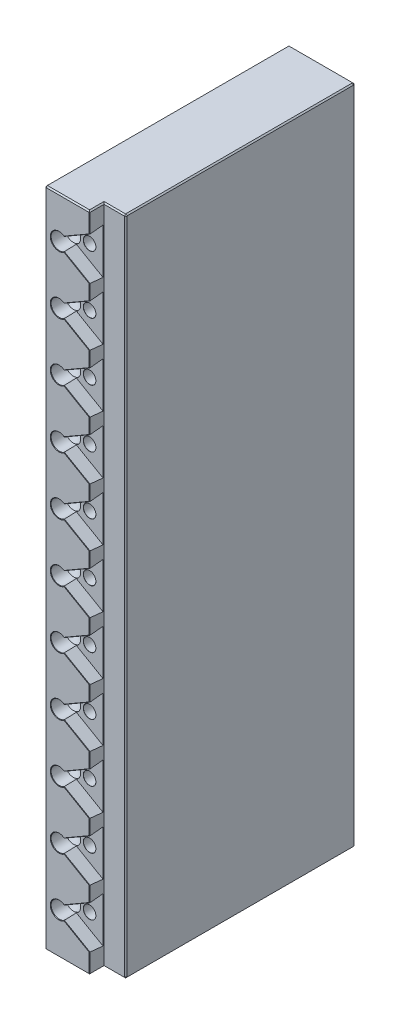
ISO-10303-21;
HEADER;
FILE_DESCRIPTION(('STEP AP214'),'2;1');
FILE_NAME('part.step','',(''),(''),'','','');
FILE_SCHEMA(('AUTOMOTIVE_DESIGN { 1 0 10303 214 1 1 1 1 }'));
ENDSEC;
DATA;
#1=APPLICATION_CONTEXT('core data for automotive mechanical design processes');
#2=APPLICATION_PROTOCOL_DEFINITION('international standard','automotive_design',2000,#1);
#3=PRODUCT_CONTEXT('',#1,'mechanical');
#4=PRODUCT('Part','Part','',(#3));
#5=PRODUCT_RELATED_PRODUCT_CATEGORY('part','',(#4));
#6=PRODUCT_DEFINITION_FORMATION('','',#4);
#7=PRODUCT_DEFINITION_CONTEXT('part definition',#1,'design');
#8=PRODUCT_DEFINITION('design','',#6,#7);
#9=PRODUCT_DEFINITION_SHAPE('','',#8);
#10=(LENGTH_UNIT() NAMED_UNIT(*) SI_UNIT(.MILLI.,.METRE.));
#11=(NAMED_UNIT(*) PLANE_ANGLE_UNIT() SI_UNIT($,.RADIAN.));
#12=(NAMED_UNIT(*) SI_UNIT($,.STERADIAN.) SOLID_ANGLE_UNIT());
#13=UNCERTAINTY_MEASURE_WITH_UNIT(LENGTH_MEASURE(1.E-05),#10,'distance_accuracy_value','');
#14=(GEOMETRIC_REPRESENTATION_CONTEXT(3) GLOBAL_UNCERTAINTY_ASSIGNED_CONTEXT((#13)) GLOBAL_UNIT_ASSIGNED_CONTEXT((#10,
#11,#12)) REPRESENTATION_CONTEXT('',''));
#15=CARTESIAN_POINT('',(0.,0.,0.));
#16=DIRECTION('',(0.,0.,1.));
#17=DIRECTION('',(1.,0.,0.));
#18=AXIS2_PLACEMENT_3D('',#15,#16,#17);
#19=CARTESIAN_POINT('',(7.55,-70.,55.7499999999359));
#20=DIRECTION('',(0.,0.,1.));
#21=DIRECTION('',(1.,0.,0.));
#22=AXIS2_PLACEMENT_3D('',#19,#20,#21);
#23=CONICAL_SURFACE('',#22,1.52499999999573,0.785398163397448);
#24=CARTESIAN_POINT('',(7.55,-70.,55.7249999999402));
#25=DIRECTION('',(0.,0.,1.));
#26=DIRECTION('',(1.,0.,0.));
#27=AXIS2_PLACEMENT_3D('',#24,#25,#26);
#28=CIRCLE('',#27,1.5);
#29=CARTESIAN_POINT('',(9.05,-70.,55.7249999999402));
#30=VERTEX_POINT('',#29);
#31=EDGE_CURVE('E646',#30,#30,#28,.F.);
#32=ORIENTED_EDGE('',*,*,#31,.T.);
#33=EDGE_LOOP('',(#32));
#34=FACE_BOUND('',#33,.T.);
#35=CARTESIAN_POINT('',(7.55,-70.,55.7499999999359));
#36=DIRECTION('',(0.,0.,1.));
#37=DIRECTION('',(1.,0.,0.));
#38=AXIS2_PLACEMENT_3D('',#35,#36,#37);
#39=CIRCLE('',#38,1.52499999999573);
#40=CARTESIAN_POINT('',(9.07499999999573,-70.,55.7499999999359));
#41=VERTEX_POINT('',#40);
#42=EDGE_CURVE('E642',#41,#41,#39,.T.);
#43=ORIENTED_EDGE('',*,*,#42,.T.);
#44=EDGE_LOOP('',(#43));
#45=FACE_BOUND('',#44,.T.);
#46=ADVANCED_FACE('F14',(#34,#45),#23,.F.);
#47=CARTESIAN_POINT('',(7.55,-56.,55.7499999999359));
#48=DIRECTION('',(0.,0.,1.));
#49=DIRECTION('',(1.,0.,0.));
#50=AXIS2_PLACEMENT_3D('',#47,#48,#49);
#51=CONICAL_SURFACE('',#50,1.52499999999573,0.785398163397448);
#52=CARTESIAN_POINT('',(7.55,-56.,55.7249999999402));
#53=DIRECTION('',(0.,0.,1.));
#54=DIRECTION('',(1.,0.,0.));
#55=AXIS2_PLACEMENT_3D('',#52,#53,#54);
#56=CIRCLE('',#55,1.5);
#57=CARTESIAN_POINT('',(9.05,-56.,55.7249999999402));
#58=VERTEX_POINT('',#57);
#59=EDGE_CURVE('E649',#58,#58,#56,.F.);
#60=ORIENTED_EDGE('',*,*,#59,.T.);
#61=EDGE_LOOP('',(#60));
#62=FACE_BOUND('',#61,.T.);
#63=CARTESIAN_POINT('',(7.55,-56.,55.7499999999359));
#64=DIRECTION('',(0.,0.,1.));
#65=DIRECTION('',(1.,0.,0.));
#66=AXIS2_PLACEMENT_3D('',#63,#64,#65);
#67=CIRCLE('',#66,1.52499999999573);
#68=CARTESIAN_POINT('',(9.07499999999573,-56.,55.7499999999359));
#69=VERTEX_POINT('',#68);
#70=EDGE_CURVE('E639',#69,#69,#67,.T.);
#71=ORIENTED_EDGE('',*,*,#70,.T.);
#72=EDGE_LOOP('',(#71));
#73=FACE_BOUND('',#72,.T.);
#74=ADVANCED_FACE('F2639',(#62,#73),#51,.F.);
#75=CARTESIAN_POINT('',(7.55,-42.,55.7499999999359));
#76=DIRECTION('',(0.,0.,1.));
#77=DIRECTION('',(1.,0.,0.));
#78=AXIS2_PLACEMENT_3D('',#75,#76,#77);
#79=CONICAL_SURFACE('',#78,1.52499999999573,0.785398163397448);
#80=CARTESIAN_POINT('',(7.55,-42.,55.7249999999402));
#81=DIRECTION('',(0.,0.,1.));
#82=DIRECTION('',(1.,0.,0.));
#83=AXIS2_PLACEMENT_3D('',#80,#81,#82);
#84=CIRCLE('',#83,1.5);
#85=CARTESIAN_POINT('',(9.05,-42.,55.7249999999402));
#86=VERTEX_POINT('',#85);
#87=EDGE_CURVE('E652',#86,#86,#84,.F.);
#88=ORIENTED_EDGE('',*,*,#87,.T.);
#89=EDGE_LOOP('',(#88));
#90=FACE_BOUND('',#89,.T.);
#91=CARTESIAN_POINT('',(7.55,-42.,55.7499999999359));
#92=DIRECTION('',(0.,0.,1.));
#93=DIRECTION('',(1.,0.,0.));
#94=AXIS2_PLACEMENT_3D('',#91,#92,#93);
#95=CIRCLE('',#94,1.52499999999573);
#96=CARTESIAN_POINT('',(9.07499999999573,-42.,55.7499999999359));
#97=VERTEX_POINT('',#96);
#98=EDGE_CURVE('E636',#97,#97,#95,.T.);
#99=ORIENTED_EDGE('',*,*,#98,.T.);
#100=EDGE_LOOP('',(#99));
#101=FACE_BOUND('',#100,.T.);
#102=ADVANCED_FACE('F2636',(#90,#101),#79,.F.);
#103=CARTESIAN_POINT('',(7.55,-28.,55.7499999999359));
#104=DIRECTION('',(0.,0.,1.));
#105=DIRECTION('',(1.,0.,0.));
#106=AXIS2_PLACEMENT_3D('',#103,#104,#105);
#107=CONICAL_SURFACE('',#106,1.52499999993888,0.785398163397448);
#108=CARTESIAN_POINT('',(7.55,-28.,55.724999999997));
#109=DIRECTION('',(0.,0.,1.));
#110=DIRECTION('',(1.,0.,0.));
#111=AXIS2_PLACEMENT_3D('',#108,#109,#110);
#112=CIRCLE('',#111,1.5);
#113=CARTESIAN_POINT('',(9.05,-28.,55.724999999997));
#114=VERTEX_POINT('',#113);
#115=EDGE_CURVE('E655',#114,#114,#112,.F.);
#116=ORIENTED_EDGE('',*,*,#115,.T.);
#117=EDGE_LOOP('',(#116));
#118=FACE_BOUND('',#117,.T.);
#119=CARTESIAN_POINT('',(7.55,-28.,55.7499999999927));
#120=DIRECTION('',(0.,0.,1.));
#121=DIRECTION('',(1.,0.,0.));
#122=AXIS2_PLACEMENT_3D('',#119,#120,#121);
#123=CIRCLE('',#122,1.52499999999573);
#124=CARTESIAN_POINT('',(9.07499999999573,-28.,55.7499999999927));
#125=VERTEX_POINT('',#124);
#126=EDGE_CURVE('E633',#125,#125,#123,.T.);
#127=ORIENTED_EDGE('',*,*,#126,.T.);
#128=EDGE_LOOP('',(#127));
#129=FACE_BOUND('',#128,.T.);
#130=ADVANCED_FACE('F2632',(#118,#129),#107,.F.);
#131=CARTESIAN_POINT('',(7.55,-14.,55.7499999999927));
#132=DIRECTION('',(0.,0.,1.));
#133=DIRECTION('',(1.,0.,0.));
#134=AXIS2_PLACEMENT_3D('',#131,#132,#133);
#135=CONICAL_SURFACE('',#134,1.52499999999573,0.785398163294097);
#136=CARTESIAN_POINT('',(7.55,-14.,55.7249999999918));
#137=DIRECTION('',(0.,0.,1.));
#138=DIRECTION('',(1.,0.,0.));
#139=AXIS2_PLACEMENT_3D('',#136,#137,#138);
#140=CIRCLE('',#139,1.5);
#141=CARTESIAN_POINT('',(9.05,-14.,55.7249999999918));
#142=VERTEX_POINT('',#141);
#143=EDGE_CURVE('E658',#142,#142,#140,.F.);
#144=ORIENTED_EDGE('',*,*,#143,.T.);
#145=EDGE_LOOP('',(#144));
#146=FACE_BOUND('',#145,.T.);
#147=CARTESIAN_POINT('',(7.55,-14.,55.7499999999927));
#148=DIRECTION('',(0.,0.,1.));
#149=DIRECTION('',(1.,0.,0.));
#150=AXIS2_PLACEMENT_3D('',#147,#148,#149);
#151=CIRCLE('',#150,1.52499999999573);
#152=CARTESIAN_POINT('',(9.07499999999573,-14.,55.7499999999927));
#153=VERTEX_POINT('',#152);
#154=EDGE_CURVE('E630',#153,#153,#151,.T.);
#155=ORIENTED_EDGE('',*,*,#154,.T.);
#156=EDGE_LOOP('',(#155));
#157=FACE_BOUND('',#156,.T.);
#158=ADVANCED_FACE('F2628',(#146,#157),#135,.F.);
#159=CARTESIAN_POINT('',(7.55,0.,55.749999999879));
#160=DIRECTION('',(0.,0.,1.));
#161=DIRECTION('',(0.,-1.,0.));
#162=AXIS2_PLACEMENT_3D('',#159,#160,#161);
#163=CONICAL_SURFACE('',#162,1.52499999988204,0.785398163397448);
#164=CARTESIAN_POINT('',(7.55,0.,55.724999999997));
#165=DIRECTION('',(0.,0.,1.));
#166=DIRECTION('',(0.,-1.,0.));
#167=AXIS2_PLACEMENT_3D('',#164,#165,#166);
#168=CIRCLE('',#167,1.5);
#169=CARTESIAN_POINT('',(7.55,-1.5,55.724999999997));
#170=VERTEX_POINT('',#169);
#171=EDGE_CURVE('E661',#170,#170,#168,.F.);
#172=ORIENTED_EDGE('',*,*,#171,.T.);
#173=EDGE_LOOP('',(#172));
#174=FACE_BOUND('',#173,.T.);
#175=CARTESIAN_POINT('',(7.55,0.,55.7499999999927));
#176=DIRECTION('',(0.,0.,1.));
#177=DIRECTION('',(0.,-1.,0.));
#178=AXIS2_PLACEMENT_3D('',#175,#176,#177);
#179=CIRCLE('',#178,1.52499999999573);
#180=CARTESIAN_POINT('',(7.55,-1.52499999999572,55.7499999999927));
#181=VERTEX_POINT('',#180);
#182=EDGE_CURVE('E627',#181,#181,#179,.T.);
#183=ORIENTED_EDGE('',*,*,#182,.T.);
#184=EDGE_LOOP('',(#183));
#185=FACE_BOUND('',#184,.T.);
#186=ADVANCED_FACE('F2624',(#174,#185),#163,.F.);
#187=CARTESIAN_POINT('',(7.55,14.,55.7499999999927));
#188=DIRECTION('',(0.,0.,1.));
#189=DIRECTION('',(1.,0.,0.));
#190=AXIS2_PLACEMENT_3D('',#187,#188,#189);
#191=CONICAL_SURFACE('',#190,1.52499999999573,0.785398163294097);
#192=CARTESIAN_POINT('',(7.55,14.,55.7249999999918));
#193=DIRECTION('',(0.,0.,1.));
#194=DIRECTION('',(1.,0.,0.));
#195=AXIS2_PLACEMENT_3D('',#192,#193,#194);
#196=CIRCLE('',#195,1.5);
#197=CARTESIAN_POINT('',(9.05,14.,55.7249999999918));
#198=VERTEX_POINT('',#197);
#199=EDGE_CURVE('E664',#198,#198,#196,.F.);
#200=ORIENTED_EDGE('',*,*,#199,.T.);
#201=EDGE_LOOP('',(#200));
#202=FACE_BOUND('',#201,.T.);
#203=CARTESIAN_POINT('',(7.55,14.,55.7499999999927));
#204=DIRECTION('',(0.,0.,1.));
#205=DIRECTION('',(1.,0.,0.));
#206=AXIS2_PLACEMENT_3D('',#203,#204,#205);
#207=CIRCLE('',#206,1.52499999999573);
#208=CARTESIAN_POINT('',(9.07499999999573,14.,55.7499999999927));
#209=VERTEX_POINT('',#208);
#210=EDGE_CURVE('E624',#209,#209,#207,.T.);
#211=ORIENTED_EDGE('',*,*,#210,.T.);
#212=EDGE_LOOP('',(#211));
#213=FACE_BOUND('',#212,.T.);
#214=ADVANCED_FACE('F2620',(#202,#213),#191,.F.);
#215=CARTESIAN_POINT('',(7.55,28.,55.7499999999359));
#216=DIRECTION('',(0.,0.,1.));
#217=DIRECTION('',(1.,0.,0.));
#218=AXIS2_PLACEMENT_3D('',#215,#216,#217);
#219=CONICAL_SURFACE('',#218,1.52499999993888,0.785398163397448);
#220=CARTESIAN_POINT('',(7.55,28.,55.724999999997));
#221=DIRECTION('',(0.,0.,1.));
#222=DIRECTION('',(1.,0.,0.));
#223=AXIS2_PLACEMENT_3D('',#220,#221,#222);
#224=CIRCLE('',#223,1.5);
#225=CARTESIAN_POINT('',(9.05,28.,55.724999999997));
#226=VERTEX_POINT('',#225);
#227=EDGE_CURVE('E667',#226,#226,#224,.F.);
#228=ORIENTED_EDGE('',*,*,#227,.T.);
#229=EDGE_LOOP('',(#228));
#230=FACE_BOUND('',#229,.T.);
#231=CARTESIAN_POINT('',(7.55,28.,55.7499999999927));
#232=DIRECTION('',(0.,0.,1.));
#233=DIRECTION('',(1.,0.,0.));
#234=AXIS2_PLACEMENT_3D('',#231,#232,#233);
#235=CIRCLE('',#234,1.52499999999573);
#236=CARTESIAN_POINT('',(9.07499999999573,28.,55.7499999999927));
#237=VERTEX_POINT('',#236);
#238=EDGE_CURVE('E621',#237,#237,#235,.T.);
#239=ORIENTED_EDGE('',*,*,#238,.T.);
#240=EDGE_LOOP('',(#239));
#241=FACE_BOUND('',#240,.T.);
#242=ADVANCED_FACE('F2616',(#230,#241),#219,.F.);
#243=CARTESIAN_POINT('',(7.55,42.,55.7499999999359));
#244=DIRECTION('',(0.,0.,1.));
#245=DIRECTION('',(1.,0.,0.));
#246=AXIS2_PLACEMENT_3D('',#243,#244,#245);
#247=CONICAL_SURFACE('',#246,1.52499999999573,0.785398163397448);
#248=CARTESIAN_POINT('',(7.55,42.,55.7249999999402));
#249=DIRECTION('',(0.,0.,1.));
#250=DIRECTION('',(1.,0.,0.));
#251=AXIS2_PLACEMENT_3D('',#248,#249,#250);
#252=CIRCLE('',#251,1.5);
#253=CARTESIAN_POINT('',(9.05,42.,55.7249999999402));
#254=VERTEX_POINT('',#253);
#255=EDGE_CURVE('E670',#254,#254,#252,.F.);
#256=ORIENTED_EDGE('',*,*,#255,.T.);
#257=EDGE_LOOP('',(#256));
#258=FACE_BOUND('',#257,.T.);
#259=CARTESIAN_POINT('',(7.55,42.,55.7499999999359));
#260=DIRECTION('',(0.,0.,1.));
#261=DIRECTION('',(1.,0.,0.));
#262=AXIS2_PLACEMENT_3D('',#259,#260,#261);
#263=CIRCLE('',#262,1.52499999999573);
#264=CARTESIAN_POINT('',(9.07499999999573,42.,55.7499999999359));
#265=VERTEX_POINT('',#264);
#266=EDGE_CURVE('E618',#265,#265,#263,.T.);
#267=ORIENTED_EDGE('',*,*,#266,.T.);
#268=EDGE_LOOP('',(#267));
#269=FACE_BOUND('',#268,.T.);
#270=ADVANCED_FACE('F2613',(#258,#269),#247,.F.);
#271=CARTESIAN_POINT('',(7.55,56.,55.7499999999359));
#272=DIRECTION('',(0.,0.,1.));
#273=DIRECTION('',(1.,0.,0.));
#274=AXIS2_PLACEMENT_3D('',#271,#272,#273);
#275=CONICAL_SURFACE('',#274,1.52499999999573,0.785398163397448);
#276=CARTESIAN_POINT('',(7.55,56.,55.7249999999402));
#277=DIRECTION('',(0.,0.,1.));
#278=DIRECTION('',(1.,0.,0.));
#279=AXIS2_PLACEMENT_3D('',#276,#277,#278);
#280=CIRCLE('',#279,1.5);
#281=CARTESIAN_POINT('',(9.05,56.,55.7249999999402));
#282=VERTEX_POINT('',#281);
#283=EDGE_CURVE('E672',#282,#282,#280,.F.);
#284=ORIENTED_EDGE('',*,*,#283,.T.);
#285=EDGE_LOOP('',(#284));
#286=FACE_BOUND('',#285,.T.);
#287=CARTESIAN_POINT('',(7.55,56.,55.7499999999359));
#288=DIRECTION('',(0.,0.,1.));
#289=DIRECTION('',(1.,0.,0.));
#290=AXIS2_PLACEMENT_3D('',#287,#288,#289);
#291=CIRCLE('',#290,1.52499999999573);
#292=CARTESIAN_POINT('',(9.07499999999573,56.,55.7499999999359));
#293=VERTEX_POINT('',#292);
#294=EDGE_CURVE('E615',#293,#293,#291,.T.);
#295=ORIENTED_EDGE('',*,*,#294,.T.);
#296=EDGE_LOOP('',(#295));
#297=FACE_BOUND('',#296,.T.);
#298=ADVANCED_FACE('F2610',(#286,#297),#275,.F.);
#299=CARTESIAN_POINT('',(7.55,70.,55.7499999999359));
#300=DIRECTION('',(0.,0.,1.));
#301=DIRECTION('',(1.,0.,0.));
#302=AXIS2_PLACEMENT_3D('',#299,#300,#301);
#303=CONICAL_SURFACE('',#302,1.52499999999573,0.785398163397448);
#304=CARTESIAN_POINT('',(7.55,70.,55.7249999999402));
#305=DIRECTION('',(0.,0.,1.));
#306=DIRECTION('',(1.,0.,0.));
#307=AXIS2_PLACEMENT_3D('',#304,#305,#306);
#308=CIRCLE('',#307,1.5);
#309=CARTESIAN_POINT('',(9.05,70.,55.7249999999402));
#310=VERTEX_POINT('',#309);
#311=EDGE_CURVE('E17',#310,#310,#308,.F.);
#312=ORIENTED_EDGE('',*,*,#311,.T.);
#313=EDGE_LOOP('',(#312));
#314=FACE_BOUND('',#313,.T.);
#315=CARTESIAN_POINT('',(7.55,70.,55.7499999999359));
#316=DIRECTION('',(0.,0.,1.));
#317=DIRECTION('',(1.,0.,0.));
#318=AXIS2_PLACEMENT_3D('',#315,#316,#317);
#319=CIRCLE('',#318,1.52499999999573);
#320=CARTESIAN_POINT('',(9.07499999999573,70.,55.7499999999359));
#321=VERTEX_POINT('',#320);
#322=EDGE_CURVE('E589',#321,#321,#319,.T.);
#323=ORIENTED_EDGE('',*,*,#322,.T.);
#324=EDGE_LOOP('',(#323));
#325=FACE_BOUND('',#324,.T.);
#326=ADVANCED_FACE('F2606',(#314,#325),#303,.F.);
#327=CARTESIAN_POINT('',(3.4,70.,55.5000000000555));
#328=DIRECTION('',(0.,0.,1.));
#329=DIRECTION('',(1.,0.,0.));
#330=AXIS2_PLACEMENT_3D('',#327,#328,#329);
#331=CONICAL_SURFACE('',#330,2.00000000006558,1.02974425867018);
#332=CARTESIAN_POINT('',(3.4000000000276,70.,54.2982787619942));
#333=VERTEX_POINT('',#332);
#334=VERTEX_LOOP('',#333);
#335=FACE_BOUND('',#334,.T.);
#336=CARTESIAN_POINT('',(3.4,70.,55.5));
#337=DIRECTION('',(0.,0.,1.));
#338=DIRECTION('',(1.,0.,0.));
#339=AXIS2_PLACEMENT_3D('',#336,#337,#338);
#340=CIRCLE('',#339,2.);
#341=CARTESIAN_POINT('',(5.4,70.,55.5));
#342=VERTEX_POINT('',#341);
#343=EDGE_CURVE('E588',#342,#342,#340,.T.);
#344=ORIENTED_EDGE('',*,*,#343,.T.);
#345=EDGE_LOOP('',(#344));
#346=FACE_BOUND('',#345,.T.);
#347=ADVANCED_FACE('F2599',(#335,#346),#331,.F.);
#348=CARTESIAN_POINT('',(3.4,56.,55.499999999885));
#349=DIRECTION('',(0.,0.,1.));
#350=DIRECTION('',(1.,0.,0.));
#351=AXIS2_PLACEMENT_3D('',#348,#349,#350);
#352=CONICAL_SURFACE('',#351,1.9999999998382,1.02974425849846);
#353=CARTESIAN_POINT('',(3.3999999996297,56.,54.2982787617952));
#354=VERTEX_POINT('',#353);
#355=VERTEX_LOOP('',#354);
#356=FACE_BOUND('',#355,.T.);
#357=CARTESIAN_POINT('',(3.4,56.,55.5));
#358=DIRECTION('',(0.,0.,1.));
#359=DIRECTION('',(1.,0.,0.));
#360=AXIS2_PLACEMENT_3D('',#357,#358,#359);
#361=CIRCLE('',#360,2.);
#362=CARTESIAN_POINT('',(5.4,56.,55.5));
#363=VERTEX_POINT('',#362);
#364=EDGE_CURVE('E1792',#363,#363,#361,.T.);
#365=ORIENTED_EDGE('',*,*,#364,.T.);
#366=EDGE_LOOP('',(#365));
#367=FACE_BOUND('',#366,.T.);
#368=ADVANCED_FACE('F2589',(#356,#367),#352,.F.);
#369=CARTESIAN_POINT('',(3.4,42.,55.499999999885));
#370=DIRECTION('',(0.,0.,1.));
#371=DIRECTION('',(1.,0.,0.));
#372=AXIS2_PLACEMENT_3D('',#369,#370,#371);
#373=CONICAL_SURFACE('',#372,1.9999999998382,1.02974425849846);
#374=CARTESIAN_POINT('',(3.3999999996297,42.,54.2982787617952));
#375=VERTEX_POINT('',#374);
#376=VERTEX_LOOP('',#375);
#377=FACE_BOUND('',#376,.T.);
#378=CARTESIAN_POINT('',(3.4,42.,55.5));
#379=DIRECTION('',(0.,0.,1.));
#380=DIRECTION('',(1.,0.,0.));
#381=AXIS2_PLACEMENT_3D('',#378,#379,#380);
#382=CIRCLE('',#381,2.);
#383=CARTESIAN_POINT('',(5.4,42.,55.5));
#384=VERTEX_POINT('',#383);
#385=EDGE_CURVE('E1788',#384,#384,#382,.T.);
#386=ORIENTED_EDGE('',*,*,#385,.T.);
#387=EDGE_LOOP('',(#386));
#388=FACE_BOUND('',#387,.T.);
#389=ADVANCED_FACE('F2586',(#377,#388),#373,.F.);
#390=CARTESIAN_POINT('',(3.4,28.,55.499999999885));
#391=DIRECTION('',(0.,0.,1.));
#392=DIRECTION('',(1.,0.,0.));
#393=AXIS2_PLACEMENT_3D('',#390,#391,#392);
#394=CONICAL_SURFACE('',#393,1.9999999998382,1.02974425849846);
#395=CARTESIAN_POINT('',(3.3999999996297,28.,54.2982787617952));
#396=VERTEX_POINT('',#395);
#397=VERTEX_LOOP('',#396);
#398=FACE_BOUND('',#397,.T.);
#399=CARTESIAN_POINT('',(3.4,28.,55.5));
#400=DIRECTION('',(0.,0.,1.));
#401=DIRECTION('',(1.,0.,0.));
#402=AXIS2_PLACEMENT_3D('',#399,#400,#401);
#403=CIRCLE('',#402,2.);
#404=CARTESIAN_POINT('',(5.4,28.,55.5));
#405=VERTEX_POINT('',#404);
#406=EDGE_CURVE('E1784',#405,#405,#403,.T.);
#407=ORIENTED_EDGE('',*,*,#406,.T.);
#408=EDGE_LOOP('',(#407));
#409=FACE_BOUND('',#408,.T.);
#410=ADVANCED_FACE('F2588',(#398,#409),#394,.F.);
#411=CARTESIAN_POINT('',(3.4,14.,55.499999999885));
#412=DIRECTION('',(0.,0.,1.));
#413=DIRECTION('',(1.,0.,0.));
#414=AXIS2_PLACEMENT_3D('',#411,#412,#413);
#415=CONICAL_SURFACE('',#414,1.99999999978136,1.02974425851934);
#416=CARTESIAN_POINT('',(3.4,14.,54.2982787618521));
#417=VERTEX_POINT('',#416);
#418=VERTEX_LOOP('',#417);
#419=FACE_BOUND('',#418,.T.);
#420=CARTESIAN_POINT('',(3.4,14.,55.5));
#421=DIRECTION('',(0.,0.,1.));
#422=DIRECTION('',(1.,0.,0.));
#423=AXIS2_PLACEMENT_3D('',#420,#421,#422);
#424=CIRCLE('',#423,2.);
#425=CARTESIAN_POINT('',(5.4,14.,55.5));
#426=VERTEX_POINT('',#425);
#427=EDGE_CURVE('E1780',#426,#426,#424,.T.);
#428=ORIENTED_EDGE('',*,*,#427,.T.);
#429=EDGE_LOOP('',(#428));
#430=FACE_BOUND('',#429,.T.);
#431=ADVANCED_FACE('F2596',(#419,#430),#415,.F.);
#432=CARTESIAN_POINT('',(3.4,0.,55.499999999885));
#433=DIRECTION('',(0.,0.,1.));
#434=DIRECTION('',(1.,0.,0.));
#435=AXIS2_PLACEMENT_3D('',#432,#433,#434);
#436=CONICAL_SURFACE('',#435,1.9999999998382,1.02974425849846);
#437=CARTESIAN_POINT('',(3.4,0.,54.2982787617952));
#438=VERTEX_POINT('',#437);
#439=VERTEX_LOOP('',#438);
#440=FACE_BOUND('',#439,.T.);
#441=CARTESIAN_POINT('',(3.4,0.,55.5));
#442=DIRECTION('',(0.,0.,1.));
#443=DIRECTION('',(1.,0.,0.));
#444=AXIS2_PLACEMENT_3D('',#441,#442,#443);
#445=CIRCLE('',#444,2.);
#446=CARTESIAN_POINT('',(5.4,0.,55.5));
#447=VERTEX_POINT('',#446);
#448=EDGE_CURVE('E1776',#447,#447,#445,.T.);
#449=ORIENTED_EDGE('',*,*,#448,.T.);
#450=EDGE_LOOP('',(#449));
#451=FACE_BOUND('',#450,.T.);
#452=ADVANCED_FACE('F2691',(#440,#451),#436,.F.);
#453=CARTESIAN_POINT('',(3.4,-14.,55.499999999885));
#454=DIRECTION('',(0.,0.,1.));
#455=DIRECTION('',(1.,0.,0.));
#456=AXIS2_PLACEMENT_3D('',#453,#454,#455);
#457=CONICAL_SURFACE('',#456,1.9999999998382,1.02974425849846);
#458=CARTESIAN_POINT('',(3.40000000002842,-14.,54.2982787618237));
#459=VERTEX_POINT('',#458);
#460=VERTEX_LOOP('',#459);
#461=FACE_BOUND('',#460,.T.);
#462=CARTESIAN_POINT('',(3.4,-14.,55.5));
#463=DIRECTION('',(0.,0.,1.));
#464=DIRECTION('',(1.,0.,0.));
#465=AXIS2_PLACEMENT_3D('',#462,#463,#464);
#466=CIRCLE('',#465,2.);
#467=CARTESIAN_POINT('',(5.4,-14.,55.5));
#468=VERTEX_POINT('',#467);
#469=EDGE_CURVE('E1772',#468,#468,#466,.T.);
#470=ORIENTED_EDGE('',*,*,#469,.T.);
#471=EDGE_LOOP('',(#470));
#472=FACE_BOUND('',#471,.T.);
#473=ADVANCED_FACE('F2687',(#461,#472),#457,.F.);
#474=CARTESIAN_POINT('',(3.4,-28.,55.499999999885));
#475=DIRECTION('',(0.,0.,1.));
#476=DIRECTION('',(1.,0.,0.));
#477=AXIS2_PLACEMENT_3D('',#474,#475,#476);
#478=CONICAL_SURFACE('',#477,1.9999999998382,1.02974425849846);
#479=CARTESIAN_POINT('',(3.3999999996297,-28.,54.2982787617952));
#480=VERTEX_POINT('',#479);
#481=VERTEX_LOOP('',#480);
#482=FACE_BOUND('',#481,.T.);
#483=CARTESIAN_POINT('',(3.4,-28.,55.5));
#484=DIRECTION('',(0.,0.,1.));
#485=DIRECTION('',(1.,0.,0.));
#486=AXIS2_PLACEMENT_3D('',#483,#484,#485);
#487=CIRCLE('',#486,2.);
#488=CARTESIAN_POINT('',(5.4,-28.,55.5));
#489=VERTEX_POINT('',#488);
#490=EDGE_CURVE('E1768',#489,#489,#487,.T.);
#491=ORIENTED_EDGE('',*,*,#490,.T.);
#492=EDGE_LOOP('',(#491));
#493=FACE_BOUND('',#492,.T.);
#494=ADVANCED_FACE('F2683',(#482,#493),#478,.F.);
#495=CARTESIAN_POINT('',(3.4,-42.,55.499999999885));
#496=DIRECTION('',(0.,0.,1.));
#497=DIRECTION('',(1.,0.,0.));
#498=AXIS2_PLACEMENT_3D('',#495,#496,#497);
#499=CONICAL_SURFACE('',#498,1.9999999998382,1.02974425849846);
#500=CARTESIAN_POINT('',(3.3999999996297,-42.,54.2982787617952));
#501=VERTEX_POINT('',#500);
#502=VERTEX_LOOP('',#501);
#503=FACE_BOUND('',#502,.T.);
#504=CARTESIAN_POINT('',(3.4,-42.,55.5));
#505=DIRECTION('',(0.,0.,1.));
#506=DIRECTION('',(1.,0.,0.));
#507=AXIS2_PLACEMENT_3D('',#504,#505,#506);
#508=CIRCLE('',#507,2.);
#509=CARTESIAN_POINT('',(5.4,-42.,55.5));
#510=VERTEX_POINT('',#509);
#511=EDGE_CURVE('E1764',#510,#510,#508,.T.);
#512=ORIENTED_EDGE('',*,*,#511,.T.);
#513=EDGE_LOOP('',(#512));
#514=FACE_BOUND('',#513,.T.);
#515=ADVANCED_FACE('F2679',(#503,#514),#499,.F.);
#516=CARTESIAN_POINT('',(3.4,-56.,55.499999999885));
#517=DIRECTION('',(0.,0.,1.));
#518=DIRECTION('',(1.,0.,0.));
#519=AXIS2_PLACEMENT_3D('',#516,#517,#518);
#520=CONICAL_SURFACE('',#519,1.9999999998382,1.02974425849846);
#521=CARTESIAN_POINT('',(3.3999999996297,-56.,54.2982787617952));
#522=VERTEX_POINT('',#521);
#523=VERTEX_LOOP('',#522);
#524=FACE_BOUND('',#523,.T.);
#525=CARTESIAN_POINT('',(3.4,-56.,55.5));
#526=DIRECTION('',(0.,0.,1.));
#527=DIRECTION('',(1.,0.,0.));
#528=AXIS2_PLACEMENT_3D('',#525,#526,#527);
#529=CIRCLE('',#528,2.);
#530=CARTESIAN_POINT('',(5.4,-56.,55.5));
#531=VERTEX_POINT('',#530);
#532=EDGE_CURVE('E1760',#531,#531,#529,.T.);
#533=ORIENTED_EDGE('',*,*,#532,.T.);
#534=EDGE_LOOP('',(#533));
#535=FACE_BOUND('',#534,.T.);
#536=ADVANCED_FACE('F2675',(#524,#535),#520,.F.);
#537=CARTESIAN_POINT('',(3.4,-70.,55.5000000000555));
#538=DIRECTION('',(0.,0.,1.));
#539=DIRECTION('',(1.,0.,0.));
#540=AXIS2_PLACEMENT_3D('',#537,#538,#539);
#541=CONICAL_SURFACE('',#540,2.00000000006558,1.02974425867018);
#542=CARTESIAN_POINT('',(3.4000000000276,-70.,54.2982787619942));
#543=VERTEX_POINT('',#542);
#544=VERTEX_LOOP('',#543);
#545=FACE_BOUND('',#544,.T.);
#546=CARTESIAN_POINT('',(3.4,-70.,55.5));
#547=DIRECTION('',(0.,0.,1.));
#548=DIRECTION('',(1.,0.,0.));
#549=AXIS2_PLACEMENT_3D('',#546,#547,#548);
#550=CIRCLE('',#549,2.);
#551=CARTESIAN_POINT('',(5.4,-70.,55.5));
#552=VERTEX_POINT('',#551);
#553=EDGE_CURVE('E1756',#552,#552,#550,.T.);
#554=ORIENTED_EDGE('',*,*,#553,.T.);
#555=EDGE_LOOP('',(#554));
#556=FACE_BOUND('',#555,.T.);
#557=ADVANCED_FACE('F2671',(#545,#556),#541,.F.);
#558=CARTESIAN_POINT('',(16.,-80.,55.2));
#559=DIRECTION('',(-0.707106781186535,0.,-0.70710678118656));
#560=DIRECTION('',(-0.70710678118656,0.,0.707106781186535));
#561=AXIS2_PLACEMENT_3D('',#558,#559,#560);
#562=PLANE('',#561);
#563=DIRECTION('',(0.,1.,0.));
#564=VECTOR('',#563,1.);
#565=CARTESIAN_POINT('',(15.7,0.,55.5));
#566=LINE('',#565,#564);
#567=CARTESIAN_POINT('',(15.7,-79.7,55.5));
#568=VERTEX_POINT('',#567);
#569=CARTESIAN_POINT('',(15.7,79.7,55.5));
#570=VERTEX_POINT('',#569);
#571=EDGE_CURVE('E1290',#568,#570,#566,.T.);
#572=ORIENTED_EDGE('',*,*,#571,.F.);
#573=DIRECTION('',(0.67859834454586,0.281084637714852,-0.678598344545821));
#574=VECTOR('',#573,1.);
#575=CARTESIAN_POINT('',(15.7,-79.7,55.5));
#576=LINE('',#575,#574);
#577=CARTESIAN_POINT('',(16.,-79.5757359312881,55.2));
#578=VERTEX_POINT('',#577);
#579=EDGE_CURVE('E1352',#568,#578,#576,.T.);
#580=ORIENTED_EDGE('',*,*,#579,.T.);
#581=DIRECTION('',(0.,1.,0.));
#582=VECTOR('',#581,1.);
#583=CARTESIAN_POINT('',(16.,-80.,55.2));
#584=LINE('',#583,#582);
#585=CARTESIAN_POINT('',(16.,79.5757359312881,55.2));
#586=VERTEX_POINT('',#585);
#587=EDGE_CURVE('E1351',#586,#578,#584,.F.);
#588=ORIENTED_EDGE('',*,*,#587,.F.);
#589=DIRECTION('',(0.678598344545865,-0.281084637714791,-0.678598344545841));
#590=VECTOR('',#589,1.);
#591=CARTESIAN_POINT('',(15.7,79.7,55.5));
#592=LINE('',#591,#590);
#593=EDGE_CURVE('E645',#570,#586,#592,.T.);
#594=ORIENTED_EDGE('',*,*,#593,.F.);
#595=EDGE_LOOP('',(#572,#580,#588,#594));
#596=FACE_BOUND('',#595,.T.);
#597=ADVANCED_FACE('F2664',(#596),#562,.F.);
#598=CARTESIAN_POINT('',(2.48,-70.,55.75));
#599=DIRECTION('',(0.,0.,-1.));
#600=DIRECTION('',(0.,1.,0.));
#601=AXIS2_PLACEMENT_3D('',#598,#599,#600);
#602=PLANE('',#601);
#603=DIRECTION('',(-0.86602540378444,-0.5,0.));
#604=VECTOR('',#603,1.);
#605=CARTESIAN_POINT('',(2.18625566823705,-69.4912198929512,55.75));
#606=LINE('',#605,#604);
#607=CARTESIAN_POINT('',(10.8,-64.5180722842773,55.75));
#608=VERTEX_POINT('',#607);
#609=CARTESIAN_POINT('',(4.35174732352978,-68.2409727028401,55.75));
#610=VERTEX_POINT('',#609);
#611=EDGE_CURVE('E1420',#608,#610,#606,.T.);
#612=ORIENTED_EDGE('',*,*,#611,.T.);
#613=CARTESIAN_POINT('',(3.4,-70.,55.75));
#614=DIRECTION('',(0.,0.,1.));
#615=DIRECTION('',(1.,0.,0.));
#616=AXIS2_PLACEMENT_3D('',#613,#614,#615);
#617=CIRCLE('',#616,2.);
#618=CARTESIAN_POINT('',(4.35174732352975,-71.75902729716,55.75));
#619=VERTEX_POINT('',#618);
#620=EDGE_CURVE('E1759',#610,#619,#617,.F.);
#621=ORIENTED_EDGE('',*,*,#620,.T.);
#622=DIRECTION('',(0.866025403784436,-0.5,0.));
#623=VECTOR('',#622,1.);
#624=CARTESIAN_POINT('',(12.756255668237,-76.6113724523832,55.75));
#625=LINE('',#624,#623);
#626=CARTESIAN_POINT('',(10.8,-75.4819277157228,55.75));
#627=VERTEX_POINT('',#626);
#628=EDGE_CURVE('E1395',#619,#627,#625,.T.);
#629=ORIENTED_EDGE('',*,*,#628,.T.);
#630=DIRECTION('',(0.,-1.,0.));
#631=VECTOR('',#630,1.);
#632=CARTESIAN_POINT('',(10.8,-86.4863613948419,55.75));
#633=LINE('',#632,#631);
#634=EDGE_CURVE('E1404',#627,#608,#633,.F.);
#635=ORIENTED_EDGE('',*,*,#634,.T.);
#636=EDGE_LOOP('',(#612,#621,#629,#635));
#637=FACE_BOUND('',#636,.T.);
#638=ORIENTED_EDGE('',*,*,#42,.F.);
#639=EDGE_LOOP('',(#638));
#640=FACE_BOUND('',#639,.T.);
#641=ADVANCED_FACE('F2654',(#637,#640),#602,.F.);
#642=CARTESIAN_POINT('',(2.48,-56.,55.75));
#643=DIRECTION('',(0.,0.,-1.));
#644=DIRECTION('',(0.,1.,0.));
#645=AXIS2_PLACEMENT_3D('',#642,#643,#644);
#646=PLANE('',#645);
#647=DIRECTION('',(-0.86602540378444,-0.5,0.));
#648=VECTOR('',#647,1.);
#649=CARTESIAN_POINT('',(2.18625566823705,-55.4912198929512,55.75));
#650=LINE('',#649,#648);
#651=CARTESIAN_POINT('',(10.8,-50.5180722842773,55.75));
#652=VERTEX_POINT('',#651);
#653=CARTESIAN_POINT('',(4.3517473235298,-54.2409727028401,55.75));
#654=VERTEX_POINT('',#653);
#655=EDGE_CURVE('E1450',#652,#654,#650,.T.);
#656=ORIENTED_EDGE('',*,*,#655,.T.);
#657=CARTESIAN_POINT('',(3.4,-56.,55.75));
#658=DIRECTION('',(0.,0.,1.));
#659=DIRECTION('',(1.,0.,0.));
#660=AXIS2_PLACEMENT_3D('',#657,#658,#659);
#661=CIRCLE('',#660,2.);
#662=CARTESIAN_POINT('',(4.35174732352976,-57.75902729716,55.75));
#663=VERTEX_POINT('',#662);
#664=EDGE_CURVE('E1763',#654,#663,#661,.F.);
#665=ORIENTED_EDGE('',*,*,#664,.T.);
#666=DIRECTION('',(0.866025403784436,-0.5,0.));
#667=VECTOR('',#666,1.);
#668=CARTESIAN_POINT('',(12.756255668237,-62.6113724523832,55.75));
#669=LINE('',#668,#667);
#670=CARTESIAN_POINT('',(10.8,-61.4819277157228,55.75));
#671=VERTEX_POINT('',#670);
#672=EDGE_CURVE('E1424',#663,#671,#669,.T.);
#673=ORIENTED_EDGE('',*,*,#672,.T.);
#674=DIRECTION('',(0.,-1.,0.));
#675=VECTOR('',#674,1.);
#676=CARTESIAN_POINT('',(10.8,-86.4863613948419,55.75));
#677=LINE('',#676,#675);
#678=EDGE_CURVE('E1430',#671,#652,#677,.F.);
#679=ORIENTED_EDGE('',*,*,#678,.T.);
#680=EDGE_LOOP('',(#656,#665,#673,#679));
#681=FACE_BOUND('',#680,.T.);
#682=ORIENTED_EDGE('',*,*,#70,.F.);
#683=EDGE_LOOP('',(#682));
#684=FACE_BOUND('',#683,.T.);
#685=ADVANCED_FACE('F2651',(#681,#684),#646,.F.);
#686=CARTESIAN_POINT('',(2.48,-42.,55.75));
#687=DIRECTION('',(0.,0.,-1.));
#688=DIRECTION('',(0.,1.,0.));
#689=AXIS2_PLACEMENT_3D('',#686,#687,#688);
#690=PLANE('',#689);
#691=DIRECTION('',(-0.86602540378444,-0.5,0.));
#692=VECTOR('',#691,1.);
#693=CARTESIAN_POINT('',(2.18625566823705,-41.4912198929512,55.75));
#694=LINE('',#693,#692);
#695=CARTESIAN_POINT('',(10.8,-36.5180722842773,55.75));
#696=VERTEX_POINT('',#695);
#697=CARTESIAN_POINT('',(4.35174732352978,-40.24097270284,55.75));
#698=VERTEX_POINT('',#697);
#699=EDGE_CURVE('E1480',#696,#698,#694,.T.);
#700=ORIENTED_EDGE('',*,*,#699,.T.);
#701=CARTESIAN_POINT('',(3.4,-42.,55.75));
#702=DIRECTION('',(0.,0.,1.));
#703=DIRECTION('',(1.,0.,0.));
#704=AXIS2_PLACEMENT_3D('',#701,#702,#703);
#705=CIRCLE('',#704,2.);
#706=CARTESIAN_POINT('',(4.35174732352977,-43.7590272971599,55.75));
#707=VERTEX_POINT('',#706);
#708=EDGE_CURVE('E1767',#698,#707,#705,.F.);
#709=ORIENTED_EDGE('',*,*,#708,.T.);
#710=DIRECTION('',(0.866025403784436,-0.5,0.));
#711=VECTOR('',#710,1.);
#712=CARTESIAN_POINT('',(12.756255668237,-48.6113724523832,55.75));
#713=LINE('',#712,#711);
#714=CARTESIAN_POINT('',(10.8,-47.4819277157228,55.75));
#715=VERTEX_POINT('',#714);
#716=EDGE_CURVE('E1454',#707,#715,#713,.T.);
#717=ORIENTED_EDGE('',*,*,#716,.T.);
#718=DIRECTION('',(0.,-1.,0.));
#719=VECTOR('',#718,1.);
#720=CARTESIAN_POINT('',(10.8,-86.4863613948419,55.75));
#721=LINE('',#720,#719);
#722=EDGE_CURVE('E1460',#715,#696,#721,.F.);
#723=ORIENTED_EDGE('',*,*,#722,.T.);
#724=EDGE_LOOP('',(#700,#709,#717,#723));
#725=FACE_BOUND('',#724,.T.);
#726=ORIENTED_EDGE('',*,*,#98,.F.);
#727=EDGE_LOOP('',(#726));
#728=FACE_BOUND('',#727,.T.);
#729=ADVANCED_FACE('F2653',(#725,#728),#690,.F.);
#730=CARTESIAN_POINT('',(2.48,-28.,55.75));
#731=DIRECTION('',(0.,0.,-1.));
#732=DIRECTION('',(0.,1.,0.));
#733=AXIS2_PLACEMENT_3D('',#730,#731,#732);
#734=PLANE('',#733);
#735=DIRECTION('',(-0.86602540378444,-0.5,0.));
#736=VECTOR('',#735,1.);
#737=CARTESIAN_POINT('',(2.18625566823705,-27.4912198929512,55.75));
#738=LINE('',#737,#736);
#739=CARTESIAN_POINT('',(10.8,-22.5180722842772,55.75));
#740=VERTEX_POINT('',#739);
#741=CARTESIAN_POINT('',(4.35174732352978,-26.2409727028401,55.75));
#742=VERTEX_POINT('',#741);
#743=EDGE_CURVE('E1510',#740,#742,#738,.T.);
#744=ORIENTED_EDGE('',*,*,#743,.T.);
#745=CARTESIAN_POINT('',(3.4,-28.,55.75));
#746=DIRECTION('',(0.,0.,1.));
#747=DIRECTION('',(1.,0.,0.));
#748=AXIS2_PLACEMENT_3D('',#745,#746,#747);
#749=CIRCLE('',#748,2.);
#750=CARTESIAN_POINT('',(4.35174732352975,-29.7590272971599,55.75));
#751=VERTEX_POINT('',#750);
#752=EDGE_CURVE('E1771',#742,#751,#749,.F.);
#753=ORIENTED_EDGE('',*,*,#752,.T.);
#754=DIRECTION('',(0.866025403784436,-0.5,0.));
#755=VECTOR('',#754,1.);
#756=CARTESIAN_POINT('',(12.756255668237,-34.6113724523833,55.75));
#757=LINE('',#756,#755);
#758=CARTESIAN_POINT('',(10.8,-33.4819277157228,55.75));
#759=VERTEX_POINT('',#758);
#760=EDGE_CURVE('E1484',#751,#759,#757,.T.);
#761=ORIENTED_EDGE('',*,*,#760,.T.);
#762=DIRECTION('',(0.,-1.,0.));
#763=VECTOR('',#762,1.);
#764=CARTESIAN_POINT('',(10.8,-86.4863613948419,55.75));
#765=LINE('',#764,#763);
#766=EDGE_CURVE('E1490',#759,#740,#765,.F.);
#767=ORIENTED_EDGE('',*,*,#766,.T.);
#768=EDGE_LOOP('',(#744,#753,#761,#767));
#769=FACE_BOUND('',#768,.T.);
#770=ORIENTED_EDGE('',*,*,#126,.F.);
#771=EDGE_LOOP('',(#770));
#772=FACE_BOUND('',#771,.T.);
#773=ADVANCED_FACE('F2661',(#769,#772),#734,.F.);
#774=CARTESIAN_POINT('',(2.48,-14.,55.75));
#775=DIRECTION('',(0.,0.,-1.));
#776=DIRECTION('',(0.,1.,0.));
#777=AXIS2_PLACEMENT_3D('',#774,#775,#776);
#778=PLANE('',#777);
#779=DIRECTION('',(-0.86602540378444,-0.5,0.));
#780=VECTOR('',#779,1.);
#781=CARTESIAN_POINT('',(2.18625566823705,-13.4912198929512,55.75));
#782=LINE('',#781,#780);
#783=CARTESIAN_POINT('',(10.8,-8.51807228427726,55.75));
#784=VERTEX_POINT('',#783);
#785=CARTESIAN_POINT('',(4.35174732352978,-12.24097270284,55.75));
#786=VERTEX_POINT('',#785);
#787=EDGE_CURVE('E1540',#784,#786,#782,.T.);
#788=ORIENTED_EDGE('',*,*,#787,.T.);
#789=CARTESIAN_POINT('',(3.4,-14.,55.75));
#790=DIRECTION('',(0.,0.,1.));
#791=DIRECTION('',(1.,0.,0.));
#792=AXIS2_PLACEMENT_3D('',#789,#790,#791);
#793=CIRCLE('',#792,2.);
#794=CARTESIAN_POINT('',(4.35174732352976,-15.75902729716,55.75));
#795=VERTEX_POINT('',#794);
#796=EDGE_CURVE('E1775',#786,#795,#793,.F.);
#797=ORIENTED_EDGE('',*,*,#796,.T.);
#798=DIRECTION('',(0.866025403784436,-0.5,0.));
#799=VECTOR('',#798,1.);
#800=CARTESIAN_POINT('',(12.756255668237,-20.6113724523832,55.75));
#801=LINE('',#800,#799);
#802=CARTESIAN_POINT('',(10.8,-19.4819277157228,55.75));
#803=VERTEX_POINT('',#802);
#804=EDGE_CURVE('E1514',#795,#803,#801,.T.);
#805=ORIENTED_EDGE('',*,*,#804,.T.);
#806=DIRECTION('',(0.,-1.,0.));
#807=VECTOR('',#806,1.);
#808=CARTESIAN_POINT('',(10.8,-86.4863613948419,55.75));
#809=LINE('',#808,#807);
#810=EDGE_CURVE('E1520',#803,#784,#809,.F.);
#811=ORIENTED_EDGE('',*,*,#810,.T.);
#812=EDGE_LOOP('',(#788,#797,#805,#811));
#813=FACE_BOUND('',#812,.T.);
#814=ORIENTED_EDGE('',*,*,#154,.F.);
#815=EDGE_LOOP('',(#814));
#816=FACE_BOUND('',#815,.T.);
#817=ADVANCED_FACE('F2762',(#813,#816),#778,.F.);
#818=CARTESIAN_POINT('',(2.48,0.,55.75));
#819=DIRECTION('',(0.,0.,-1.));
#820=DIRECTION('',(0.,1.,0.));
#821=AXIS2_PLACEMENT_3D('',#818,#819,#820);
#822=PLANE('',#821);
#823=DIRECTION('',(-0.86602540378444,-0.5,0.));
#824=VECTOR('',#823,1.);
#825=CARTESIAN_POINT('',(2.18625566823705,0.508780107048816,55.75));
#826=LINE('',#825,#824);
#827=CARTESIAN_POINT('',(10.8,5.48192771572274,55.75));
#828=VERTEX_POINT('',#827);
#829=CARTESIAN_POINT('',(4.35174732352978,1.75902729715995,55.75));
#830=VERTEX_POINT('',#829);
#831=EDGE_CURVE('E1570',#828,#830,#826,.T.);
#832=ORIENTED_EDGE('',*,*,#831,.T.);
#833=CARTESIAN_POINT('',(3.4,0.,55.75));
#834=DIRECTION('',(0.,0.,1.));
#835=DIRECTION('',(1.,0.,0.));
#836=AXIS2_PLACEMENT_3D('',#833,#834,#835);
#837=CIRCLE('',#836,2.);
#838=CARTESIAN_POINT('',(4.35174732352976,-1.75902729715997,55.75));
#839=VERTEX_POINT('',#838);
#840=EDGE_CURVE('E1779',#830,#839,#837,.F.);
#841=ORIENTED_EDGE('',*,*,#840,.T.);
#842=DIRECTION('',(0.866025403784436,-0.5,0.));
#843=VECTOR('',#842,1.);
#844=CARTESIAN_POINT('',(12.756255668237,-6.61137245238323,55.75));
#845=LINE('',#844,#843);
#846=CARTESIAN_POINT('',(10.8,-5.48192771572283,55.75));
#847=VERTEX_POINT('',#846);
#848=EDGE_CURVE('E1544',#839,#847,#845,.T.);
#849=ORIENTED_EDGE('',*,*,#848,.T.);
#850=DIRECTION('',(0.,-1.,0.));
#851=VECTOR('',#850,1.);
#852=CARTESIAN_POINT('',(10.8,-86.4863613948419,55.75));
#853=LINE('',#852,#851);
#854=EDGE_CURVE('E1550',#847,#828,#853,.F.);
#855=ORIENTED_EDGE('',*,*,#854,.T.);
#856=EDGE_LOOP('',(#832,#841,#849,#855));
#857=FACE_BOUND('',#856,.T.);
#858=ORIENTED_EDGE('',*,*,#182,.F.);
#859=EDGE_LOOP('',(#858));
#860=FACE_BOUND('',#859,.T.);
#861=ADVANCED_FACE('F2758',(#857,#860),#822,.F.);
#862=CARTESIAN_POINT('',(2.48,14.,55.75));
#863=DIRECTION('',(0.,0.,-1.));
#864=DIRECTION('',(0.,1.,0.));
#865=AXIS2_PLACEMENT_3D('',#862,#863,#864);
#866=PLANE('',#865);
#867=DIRECTION('',(-0.86602540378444,-0.5,0.));
#868=VECTOR('',#867,1.);
#869=CARTESIAN_POINT('',(2.18625566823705,14.5087801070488,55.75));
#870=LINE('',#869,#868);
#871=CARTESIAN_POINT('',(10.8,19.4819277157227,55.75));
#872=VERTEX_POINT('',#871);
#873=CARTESIAN_POINT('',(4.35174732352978,15.75902729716,55.75));
#874=VERTEX_POINT('',#873);
#875=EDGE_CURVE('E1600',#872,#874,#870,.T.);
#876=ORIENTED_EDGE('',*,*,#875,.T.);
#877=CARTESIAN_POINT('',(3.4,14.,55.75));
#878=DIRECTION('',(0.,0.,1.));
#879=DIRECTION('',(1.,0.,0.));
#880=AXIS2_PLACEMENT_3D('',#877,#878,#879);
#881=CIRCLE('',#880,2.);
#882=CARTESIAN_POINT('',(4.35174732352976,12.24097270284,55.75));
#883=VERTEX_POINT('',#882);
#884=EDGE_CURVE('E1783',#874,#883,#881,.F.);
#885=ORIENTED_EDGE('',*,*,#884,.T.);
#886=DIRECTION('',(0.866025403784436,-0.5,0.));
#887=VECTOR('',#886,1.);
#888=CARTESIAN_POINT('',(12.756255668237,7.38862754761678,55.75));
#889=LINE('',#888,#887);
#890=CARTESIAN_POINT('',(10.8,8.51807228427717,55.75));
#891=VERTEX_POINT('',#890);
#892=EDGE_CURVE('E1574',#883,#891,#889,.T.);
#893=ORIENTED_EDGE('',*,*,#892,.T.);
#894=DIRECTION('',(0.,-1.,0.));
#895=VECTOR('',#894,1.);
#896=CARTESIAN_POINT('',(10.8,-86.4863613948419,55.75));
#897=LINE('',#896,#895);
#898=EDGE_CURVE('E1580',#891,#872,#897,.F.);
#899=ORIENTED_EDGE('',*,*,#898,.T.);
#900=EDGE_LOOP('',(#876,#885,#893,#899));
#901=FACE_BOUND('',#900,.T.);
#902=ORIENTED_EDGE('',*,*,#210,.F.);
#903=EDGE_LOOP('',(#902));
#904=FACE_BOUND('',#903,.T.);
#905=ADVANCED_FACE('F2754',(#901,#904),#866,.F.);
#906=CARTESIAN_POINT('',(2.48,28.,55.75));
#907=DIRECTION('',(0.,0.,-1.));
#908=DIRECTION('',(0.,1.,0.));
#909=AXIS2_PLACEMENT_3D('',#906,#907,#908);
#910=PLANE('',#909);
#911=DIRECTION('',(-0.86602540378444,-0.5,0.));
#912=VECTOR('',#911,1.);
#913=CARTESIAN_POINT('',(2.18625566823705,28.5087801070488,55.75));
#914=LINE('',#913,#912);
#915=CARTESIAN_POINT('',(10.8,33.4819277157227,55.75));
#916=VERTEX_POINT('',#915);
#917=CARTESIAN_POINT('',(4.35174732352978,29.7590272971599,55.75));
#918=VERTEX_POINT('',#917);
#919=EDGE_CURVE('E1630',#916,#918,#914,.T.);
#920=ORIENTED_EDGE('',*,*,#919,.T.);
#921=CARTESIAN_POINT('',(3.4,28.,55.75));
#922=DIRECTION('',(0.,0.,1.));
#923=DIRECTION('',(1.,0.,0.));
#924=AXIS2_PLACEMENT_3D('',#921,#922,#923);
#925=CIRCLE('',#924,2.);
#926=CARTESIAN_POINT('',(4.35174732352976,26.2409727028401,55.75));
#927=VERTEX_POINT('',#926);
#928=EDGE_CURVE('E1787',#918,#927,#925,.F.);
#929=ORIENTED_EDGE('',*,*,#928,.T.);
#930=DIRECTION('',(0.866025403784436,-0.5,0.));
#931=VECTOR('',#930,1.);
#932=CARTESIAN_POINT('',(12.756255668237,21.3886275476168,55.75));
#933=LINE('',#932,#931);
#934=CARTESIAN_POINT('',(10.8,22.5180722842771,55.75));
#935=VERTEX_POINT('',#934);
#936=EDGE_CURVE('E1604',#927,#935,#933,.T.);
#937=ORIENTED_EDGE('',*,*,#936,.T.);
#938=DIRECTION('',(0.,-1.,0.));
#939=VECTOR('',#938,1.);
#940=CARTESIAN_POINT('',(10.8,-86.4863613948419,55.75));
#941=LINE('',#940,#939);
#942=EDGE_CURVE('E1610',#935,#916,#941,.F.);
#943=ORIENTED_EDGE('',*,*,#942,.T.);
#944=EDGE_LOOP('',(#920,#929,#937,#943));
#945=FACE_BOUND('',#944,.T.);
#946=ORIENTED_EDGE('',*,*,#238,.F.);
#947=EDGE_LOOP('',(#946));
#948=FACE_BOUND('',#947,.T.);
#949=ADVANCED_FACE('F2751',(#945,#948),#910,.F.);
#950=CARTESIAN_POINT('',(2.48,42.,55.75));
#951=DIRECTION('',(0.,0.,-1.));
#952=DIRECTION('',(0.,1.,0.));
#953=AXIS2_PLACEMENT_3D('',#950,#951,#952);
#954=PLANE('',#953);
#955=DIRECTION('',(-0.86602540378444,-0.5,0.));
#956=VECTOR('',#955,1.);
#957=CARTESIAN_POINT('',(2.18625566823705,42.5087801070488,55.75));
#958=LINE('',#957,#956);
#959=CARTESIAN_POINT('',(10.8,47.4819277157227,55.75));
#960=VERTEX_POINT('',#959);
#961=CARTESIAN_POINT('',(4.35174732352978,43.7590272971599,55.75));
#962=VERTEX_POINT('',#961);
#963=EDGE_CURVE('E1660',#960,#962,#958,.T.);
#964=ORIENTED_EDGE('',*,*,#963,.T.);
#965=CARTESIAN_POINT('',(3.4,42.,55.75));
#966=DIRECTION('',(0.,0.,1.));
#967=DIRECTION('',(1.,0.,0.));
#968=AXIS2_PLACEMENT_3D('',#965,#966,#967);
#969=CIRCLE('',#968,2.);
#970=CARTESIAN_POINT('',(4.35174732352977,40.24097270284,55.75));
#971=VERTEX_POINT('',#970);
#972=EDGE_CURVE('E1791',#962,#971,#969,.F.);
#973=ORIENTED_EDGE('',*,*,#972,.T.);
#974=DIRECTION('',(0.866025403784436,-0.5,0.));
#975=VECTOR('',#974,1.);
#976=CARTESIAN_POINT('',(12.756255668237,35.3886275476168,55.75));
#977=LINE('',#976,#975);
#978=CARTESIAN_POINT('',(10.8,36.5180722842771,55.75));
#979=VERTEX_POINT('',#978);
#980=EDGE_CURVE('E1634',#971,#979,#977,.T.);
#981=ORIENTED_EDGE('',*,*,#980,.T.);
#982=DIRECTION('',(0.,-1.,0.));
#983=VECTOR('',#982,1.);
#984=CARTESIAN_POINT('',(10.8,-86.4863613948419,55.75));
#985=LINE('',#984,#983);
#986=EDGE_CURVE('E1640',#979,#960,#985,.F.);
#987=ORIENTED_EDGE('',*,*,#986,.T.);
#988=EDGE_LOOP('',(#964,#973,#981,#987));
#989=FACE_BOUND('',#988,.T.);
#990=ORIENTED_EDGE('',*,*,#266,.F.);
#991=EDGE_LOOP('',(#990));
#992=FACE_BOUND('',#991,.T.);
#993=ADVANCED_FACE('F2574',(#989,#992),#954,.F.);
#994=CARTESIAN_POINT('',(2.48,56.,55.75));
#995=DIRECTION('',(0.,0.,-1.));
#996=DIRECTION('',(0.,1.,0.));
#997=AXIS2_PLACEMENT_3D('',#994,#995,#996);
#998=PLANE('',#997);
#999=DIRECTION('',(-0.86602540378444,-0.5,0.));
#1000=VECTOR('',#999,1.);
#1001=CARTESIAN_POINT('',(2.18625566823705,56.5087801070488,55.75));
#1002=LINE('',#1001,#1000);
#1003=CARTESIAN_POINT('',(10.8,61.4819277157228,55.75));
#1004=VERTEX_POINT('',#1003);
#1005=CARTESIAN_POINT('',(4.35174732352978,57.75902729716,55.75));
#1006=VERTEX_POINT('',#1005);
#1007=EDGE_CURVE('E598',#1004,#1006,#1002,.T.);
#1008=ORIENTED_EDGE('',*,*,#1007,.T.);
#1009=CARTESIAN_POINT('',(3.4,56.,55.75));
#1010=DIRECTION('',(0.,0.,1.));
#1011=DIRECTION('',(1.,0.,0.));
#1012=AXIS2_PLACEMENT_3D('',#1009,#1010,#1011);
#1013=CIRCLE('',#1012,2.);
#1014=CARTESIAN_POINT('',(4.35174732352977,54.24097270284,55.75));
#1015=VERTEX_POINT('',#1014);
#1016=EDGE_CURVE('E1794',#1006,#1015,#1013,.F.);
#1017=ORIENTED_EDGE('',*,*,#1016,.T.);
#1018=DIRECTION('',(0.866025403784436,-0.5,0.));
#1019=VECTOR('',#1018,1.);
#1020=CARTESIAN_POINT('',(12.756255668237,49.3886275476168,55.75));
#1021=LINE('',#1020,#1019);
#1022=CARTESIAN_POINT('',(10.8,50.5180722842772,55.75));
#1023=VERTEX_POINT('',#1022);
#1024=EDGE_CURVE('E1664',#1015,#1023,#1021,.T.);
#1025=ORIENTED_EDGE('',*,*,#1024,.T.);
#1026=DIRECTION('',(0.,-1.,0.));
#1027=VECTOR('',#1026,1.);
#1028=CARTESIAN_POINT('',(10.8,-86.4863613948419,55.75));
#1029=LINE('',#1028,#1027);
#1030=EDGE_CURVE('E1670',#1023,#1004,#1029,.F.);
#1031=ORIENTED_EDGE('',*,*,#1030,.T.);
#1032=EDGE_LOOP('',(#1008,#1017,#1025,#1031));
#1033=FACE_BOUND('',#1032,.T.);
#1034=ORIENTED_EDGE('',*,*,#294,.F.);
#1035=EDGE_LOOP('',(#1034));
#1036=FACE_BOUND('',#1035,.T.);
#1037=ADVANCED_FACE('F2308',(#1033,#1036),#998,.F.);
#1038=CARTESIAN_POINT('',(2.48,70.,55.75));
#1039=DIRECTION('',(0.,0.,-1.));
#1040=DIRECTION('',(0.,1.,0.));
#1041=AXIS2_PLACEMENT_3D('',#1038,#1039,#1040);
#1042=PLANE('',#1041);
#1043=DIRECTION('',(-0.86602540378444,-0.5,0.));
#1044=VECTOR('',#1043,1.);
#1045=CARTESIAN_POINT('',(2.18625566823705,70.5087801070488,55.75));
#1046=LINE('',#1045,#1044);
#1047=CARTESIAN_POINT('',(10.8,75.4819277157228,55.75));
#1048=VERTEX_POINT('',#1047);
#1049=CARTESIAN_POINT('',(4.35174732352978,71.75902729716,55.75));
#1050=VERTEX_POINT('',#1049);
#1051=EDGE_CURVE('E583',#1048,#1050,#1046,.T.);
#1052=ORIENTED_EDGE('',*,*,#1051,.T.);
#1053=CARTESIAN_POINT('',(3.4,70.,55.75));
#1054=DIRECTION('',(0.,0.,1.));
#1055=DIRECTION('',(1.,0.,0.));
#1056=AXIS2_PLACEMENT_3D('',#1053,#1054,#1055);
#1057=CIRCLE('',#1056,2.);
#1058=CARTESIAN_POINT('',(4.35174732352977,68.2409727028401,55.75));
#1059=VERTEX_POINT('',#1058);
#1060=EDGE_CURVE('E576',#1050,#1059,#1057,.F.);
#1061=ORIENTED_EDGE('',*,*,#1060,.T.);
#1062=DIRECTION('',(0.866025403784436,-0.5,0.));
#1063=VECTOR('',#1062,1.);
#1064=CARTESIAN_POINT('',(12.756255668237,63.3886275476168,55.75));
#1065=LINE('',#1064,#1063);
#1066=CARTESIAN_POINT('',(10.8,64.5180722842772,55.75));
#1067=VERTEX_POINT('',#1066);
#1068=EDGE_CURVE('E581',#1059,#1067,#1065,.T.);
#1069=ORIENTED_EDGE('',*,*,#1068,.T.);
#1070=DIRECTION('',(0.,-1.,0.));
#1071=VECTOR('',#1070,1.);
#1072=CARTESIAN_POINT('',(10.8,-86.4863613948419,55.75));
#1073=LINE('',#1072,#1071);
#1074=EDGE_CURVE('E1399',#1067,#1048,#1073,.F.);
#1075=ORIENTED_EDGE('',*,*,#1074,.T.);
#1076=EDGE_LOOP('',(#1052,#1061,#1069,#1075));
#1077=FACE_BOUND('',#1076,.T.);
#1078=ORIENTED_EDGE('',*,*,#322,.F.);
#1079=EDGE_LOOP('',(#1078));
#1080=FACE_BOUND('',#1079,.T.);
#1081=ADVANCED_FACE('F578',(#1077,#1080),#1042,.F.);
#1082=CARTESIAN_POINT('',(3.4,70.,59.));
#1083=DIRECTION('',(0.,0.,1.));
#1084=DIRECTION('',(1.,0.,0.));
#1085=AXIS2_PLACEMENT_3D('',#1082,#1083,#1084);
#1086=CYLINDRICAL_SURFACE('',#1085,2.);
#1087=ORIENTED_EDGE('',*,*,#1060,.F.);
#1088=CARTESIAN_POINT('',(3.4,70.,67.7228502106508));
#1089=DIRECTION('',(-0.498097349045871,0.862729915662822,0.0871557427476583));
#1090=DIRECTION('',(0.043577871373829,-0.0754790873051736,0.996194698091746));
#1091=AXIS2_PLACEMENT_3D('',#1088,#1089,#1090);
#1092=ELLIPSE('',#1091,22.9474264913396,2.);
#1093=CARTESIAN_POINT('',(4.61209449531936,71.5910964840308,58.9001902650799));
#1094=VERTEX_POINT('',#1093);
#1095=EDGE_CURVE('E1365',#1050,#1094,#1092,.F.);
#1096=ORIENTED_EDGE('',*,*,#1095,.T.);
#1097=CARTESIAN_POINT('',(3.4,70.,58.899999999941));
#1098=DIRECTION('',(0.,0.,1.));
#1099=DIRECTION('',(1.,0.,0.));
#1100=AXIS2_PLACEMENT_3D('',#1097,#1098,#1099);
#1101=CIRCLE('',#1100,2.00000000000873);
#1102=CARTESIAN_POINT('',(4.61209449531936,68.4089035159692,58.9001902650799));
#1103=VERTEX_POINT('',#1102);
#1104=EDGE_CURVE('E602',#1094,#1103,#1101,.T.);
#1105=ORIENTED_EDGE('',*,*,#1104,.T.);
#1106=CARTESIAN_POINT('',(3.4,70.,67.7228502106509));
#1107=DIRECTION('',(-0.498097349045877,-0.862729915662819,0.0871557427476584));
#1108=DIRECTION('',(0.0435778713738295,0.0754790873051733,0.996194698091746));
#1109=AXIS2_PLACEMENT_3D('',#1106,#1107,#1108);
#1110=ELLIPSE('',#1109,22.9474264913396,2.);
#1111=EDGE_CURVE('E595',#1103,#1059,#1110,.F.);
#1112=ORIENTED_EDGE('',*,*,#1111,.T.);
#1113=EDGE_LOOP('',(#1087,#1096,#1105,#1112));
#1114=FACE_BOUND('',#1113,.T.);
#1115=ORIENTED_EDGE('',*,*,#343,.F.);
#1116=EDGE_LOOP('',(#1115));
#1117=FACE_BOUND('',#1116,.T.);
#1118=ADVANCED_FACE('F600',(#1114,#1117),#1086,.F.);
#1119=CARTESIAN_POINT('',(12.8,63.4643949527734,56.75));
#1120=DIRECTION('',(-0.498097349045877,-0.862729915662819,0.0871557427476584));
#1121=DIRECTION('',(0.866025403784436,-0.5,0.));
#1122=AXIS2_PLACEMENT_3D('',#1119,#1120,#1121);
#1123=PLANE('',#1122);
#1124=DIRECTION('',(0.,-0.100511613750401,-0.994935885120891));
#1125=VECTOR('',#1124,1.);
#1126=CARTESIAN_POINT('',(10.8,64.8362953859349,58.9));
#1127=LINE('',#1126,#1125);
#1128=CARTESIAN_POINT('',(10.7998097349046,64.8364244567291,58.9001902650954));
#1129=VERTEX_POINT('',#1128);
#1130=EDGE_CURVE('E597',#1129,#1067,#1127,.T.);
#1131=ORIENTED_EDGE('',*,*,#1130,.T.);
#1132=ORIENTED_EDGE('',*,*,#1068,.F.);
#1133=ORIENTED_EDGE('',*,*,#1111,.F.);
#1134=DIRECTION('',(0.866025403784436,-0.5,0.));
#1135=VECTOR('',#1134,1.);
#1136=CARTESIAN_POINT('',(4.61228745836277,68.4088113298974,58.9003805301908));
#1137=LINE('',#1136,#1135);
#1138=EDGE_CURVE('E1265',#1103,#1129,#1137,.T.);
#1139=ORIENTED_EDGE('',*,*,#1138,.T.);
#1140=EDGE_LOOP('',(#1131,#1132,#1133,#1139));
#1141=FACE_BOUND('',#1140,.T.);
#1142=ADVANCED_FACE('F593',(#1141),#1123,.F.);
#1143=CARTESIAN_POINT('',(2.23,56.4330127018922,56.75));
#1144=DIRECTION('',(-0.498097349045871,0.862729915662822,0.0871557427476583));
#1145=DIRECTION('',(-0.86602540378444,-0.5,0.));
#1146=AXIS2_PLACEMENT_3D('',#1143,#1144,#1145);
#1147=PLANE('',#1146);
#1148=DIRECTION('',(-0.86602540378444,-0.5,0.));
#1149=VECTOR('',#1148,1.);
#1150=CARTESIAN_POINT('',(10.7996194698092,61.1634464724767,58.9003805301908));
#1151=LINE('',#1150,#1149);
#1152=CARTESIAN_POINT('',(10.7998097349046,61.1635755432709,58.9001902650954));
#1153=VERTEX_POINT('',#1152);
#1154=CARTESIAN_POINT('',(4.61209449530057,57.5910964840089,58.9001902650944));
#1155=VERTEX_POINT('',#1154);
#1156=EDGE_CURVE('E1245',#1153,#1155,#1151,.T.);
#1157=ORIENTED_EDGE('',*,*,#1156,.T.);
#1158=CARTESIAN_POINT('',(3.4,56.,67.7228502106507));
#1159=DIRECTION('',(-0.498097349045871,0.862729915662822,0.0871557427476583));
#1160=DIRECTION('',(0.043577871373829,-0.0754790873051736,0.996194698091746));
#1161=AXIS2_PLACEMENT_3D('',#1158,#1159,#1160);
#1162=ELLIPSE('',#1161,22.9474264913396,2.);
#1163=EDGE_CURVE('E1692',#1155,#1006,#1162,.T.);
#1164=ORIENTED_EDGE('',*,*,#1163,.T.);
#1165=ORIENTED_EDGE('',*,*,#1007,.F.);
#1166=DIRECTION('',(0.,-0.100511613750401,0.994935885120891));
#1167=VECTOR('',#1166,1.);
#1168=CARTESIAN_POINT('',(10.8,61.4819277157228,55.75));
#1169=LINE('',#1168,#1167);
#1170=EDGE_CURVE('E1696',#1004,#1153,#1169,.T.);
#1171=ORIENTED_EDGE('',*,*,#1170,.T.);
#1172=EDGE_LOOP('',(#1157,#1164,#1165,#1171));
#1173=FACE_BOUND('',#1172,.T.);
#1174=ADVANCED_FACE('F2299',(#1173),#1147,.F.);
#1175=CARTESIAN_POINT('',(3.4,56.,59.));
#1176=DIRECTION('',(0.,0.,1.));
#1177=DIRECTION('',(1.,0.,0.));
#1178=AXIS2_PLACEMENT_3D('',#1175,#1176,#1177);
#1179=CYLINDRICAL_SURFACE('',#1178,2.);
#1180=ORIENTED_EDGE('',*,*,#1016,.F.);
#1181=ORIENTED_EDGE('',*,*,#1163,.F.);
#1182=CARTESIAN_POINT('',(3.4,56.,58.8999999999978));
#1183=DIRECTION('',(0.,0.,1.));
#1184=DIRECTION('',(1.,0.,0.));
#1185=AXIS2_PLACEMENT_3D('',#1182,#1183,#1184);
#1186=CIRCLE('',#1185,1.99999999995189);
#1187=CARTESIAN_POINT('',(4.61209449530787,54.4089035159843,58.9001902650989));
#1188=VERTEX_POINT('',#1187);
#1189=EDGE_CURVE('E1241',#1155,#1188,#1186,.T.);
#1190=ORIENTED_EDGE('',*,*,#1189,.T.);
#1191=CARTESIAN_POINT('',(3.4,56.,67.7228502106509));
#1192=DIRECTION('',(-0.498097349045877,-0.862729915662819,0.0871557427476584));
#1193=DIRECTION('',(0.0435778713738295,0.0754790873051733,0.996194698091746));
#1194=AXIS2_PLACEMENT_3D('',#1191,#1192,#1193);
#1195=ELLIPSE('',#1194,22.9474264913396,2.);
#1196=EDGE_CURVE('E1683',#1188,#1015,#1195,.F.);
#1197=ORIENTED_EDGE('',*,*,#1196,.T.);
#1198=EDGE_LOOP('',(#1180,#1181,#1190,#1197));
#1199=FACE_BOUND('',#1198,.T.);
#1200=ORIENTED_EDGE('',*,*,#364,.F.);
#1201=EDGE_LOOP('',(#1200));
#1202=FACE_BOUND('',#1201,.T.);
#1203=ADVANCED_FACE('F2303',(#1199,#1202),#1179,.F.);
#1204=CARTESIAN_POINT('',(12.8,49.4643949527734,56.75));
#1205=DIRECTION('',(-0.498097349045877,-0.862729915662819,0.0871557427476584));
#1206=DIRECTION('',(0.866025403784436,-0.5,0.));
#1207=AXIS2_PLACEMENT_3D('',#1204,#1205,#1206);
#1208=PLANE('',#1207);
#1209=DIRECTION('',(0.,-0.100511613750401,-0.994935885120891));
#1210=VECTOR('',#1209,1.);
#1211=CARTESIAN_POINT('',(10.8,50.8362953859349,58.9));
#1212=LINE('',#1211,#1210);
#1213=CARTESIAN_POINT('',(10.7998097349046,50.8364244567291,58.9001902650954));
#1214=VERTEX_POINT('',#1213);
#1215=EDGE_CURVE('E1667',#1214,#1023,#1212,.T.);
#1216=ORIENTED_EDGE('',*,*,#1215,.T.);
#1217=ORIENTED_EDGE('',*,*,#1024,.F.);
#1218=ORIENTED_EDGE('',*,*,#1196,.F.);
#1219=DIRECTION('',(0.866025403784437,-0.5,0.));
#1220=VECTOR('',#1219,1.);
#1221=CARTESIAN_POINT('',(4.61228745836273,54.4088113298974,58.9003805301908));
#1222=LINE('',#1221,#1220);
#1223=EDGE_CURVE('E1238',#1188,#1214,#1222,.T.);
#1224=ORIENTED_EDGE('',*,*,#1223,.T.);
#1225=EDGE_LOOP('',(#1216,#1217,#1218,#1224));
#1226=FACE_BOUND('',#1225,.T.);
#1227=ADVANCED_FACE('F2314',(#1226),#1208,.F.);
#1228=CARTESIAN_POINT('',(2.23,42.4330127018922,56.75));
#1229=DIRECTION('',(-0.498097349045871,0.862729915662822,0.0871557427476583));
#1230=DIRECTION('',(-0.86602540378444,-0.5,0.));
#1231=AXIS2_PLACEMENT_3D('',#1228,#1229,#1230);
#1232=PLANE('',#1231);
#1233=DIRECTION('',(-0.866025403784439,-0.5,0.));
#1234=VECTOR('',#1233,1.);
#1235=CARTESIAN_POINT('',(10.7996194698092,47.1634464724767,58.9003805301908));
#1236=LINE('',#1235,#1234);
#1237=CARTESIAN_POINT('',(10.7998097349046,47.1635755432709,58.9001902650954));
#1238=VERTEX_POINT('',#1237);
#1239=CARTESIAN_POINT('',(4.61209449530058,43.591096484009,58.9001902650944));
#1240=VERTEX_POINT('',#1239);
#1241=EDGE_CURVE('E1218',#1238,#1240,#1236,.T.);
#1242=ORIENTED_EDGE('',*,*,#1241,.T.);
#1243=CARTESIAN_POINT('',(3.4,42.,67.7228502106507));
#1244=DIRECTION('',(-0.498097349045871,0.862729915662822,0.0871557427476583));
#1245=DIRECTION('',(0.043577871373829,-0.0754790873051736,0.996194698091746));
#1246=AXIS2_PLACEMENT_3D('',#1243,#1244,#1245);
#1247=ELLIPSE('',#1246,22.9474264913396,2.);
#1248=EDGE_CURVE('E1663',#1240,#962,#1247,.T.);
#1249=ORIENTED_EDGE('',*,*,#1248,.T.);
#1250=ORIENTED_EDGE('',*,*,#963,.F.);
#1251=DIRECTION('',(0.,-0.100511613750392,0.994935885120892));
#1252=VECTOR('',#1251,1.);
#1253=CARTESIAN_POINT('',(10.8,47.4819277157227,55.75));
#1254=LINE('',#1253,#1252);
#1255=EDGE_CURVE('E1671',#960,#1238,#1254,.T.);
#1256=ORIENTED_EDGE('',*,*,#1255,.T.);
#1257=EDGE_LOOP('',(#1242,#1249,#1250,#1256));
#1258=FACE_BOUND('',#1257,.T.);
#1259=ADVANCED_FACE('F2571',(#1258),#1232,.F.);
#1260=CARTESIAN_POINT('',(3.4,42.,59.));
#1261=DIRECTION('',(0.,0.,1.));
#1262=DIRECTION('',(1.,0.,0.));
#1263=AXIS2_PLACEMENT_3D('',#1260,#1261,#1262);
#1264=CYLINDRICAL_SURFACE('',#1263,2.);
#1265=ORIENTED_EDGE('',*,*,#972,.F.);
#1266=ORIENTED_EDGE('',*,*,#1248,.F.);
#1267=CARTESIAN_POINT('',(3.4,42.,58.8999999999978));
#1268=DIRECTION('',(0.,0.,1.));
#1269=DIRECTION('',(1.,0.,0.));
#1270=AXIS2_PLACEMENT_3D('',#1267,#1268,#1269);
#1271=CIRCLE('',#1270,1.99999999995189);
#1272=CARTESIAN_POINT('',(4.61209449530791,40.4089035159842,58.9001902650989));
#1273=VERTEX_POINT('',#1272);
#1274=EDGE_CURVE('E1214',#1240,#1273,#1271,.T.);
#1275=ORIENTED_EDGE('',*,*,#1274,.T.);
#1276=CARTESIAN_POINT('',(3.4,42.,67.7228502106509));
#1277=DIRECTION('',(-0.498097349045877,-0.862729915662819,0.0871557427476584));
#1278=DIRECTION('',(0.0435778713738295,0.0754790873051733,0.996194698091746));
#1279=AXIS2_PLACEMENT_3D('',#1276,#1277,#1278);
#1280=ELLIPSE('',#1279,22.9474264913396,2.);
#1281=EDGE_CURVE('E1653',#1273,#971,#1280,.F.);
#1282=ORIENTED_EDGE('',*,*,#1281,.T.);
#1283=EDGE_LOOP('',(#1265,#1266,#1275,#1282));
#1284=FACE_BOUND('',#1283,.T.);
#1285=ORIENTED_EDGE('',*,*,#385,.F.);
#1286=EDGE_LOOP('',(#1285));
#1287=FACE_BOUND('',#1286,.T.);
#1288=ADVANCED_FACE('F2580',(#1284,#1287),#1264,.F.);
#1289=CARTESIAN_POINT('',(12.8,35.4643949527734,56.75));
#1290=DIRECTION('',(-0.498097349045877,-0.862729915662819,0.0871557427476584));
#1291=DIRECTION('',(0.866025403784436,-0.5,0.));
#1292=AXIS2_PLACEMENT_3D('',#1289,#1290,#1291);
#1293=PLANE('',#1292);
#1294=DIRECTION('',(0.,-0.100511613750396,-0.994935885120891));
#1295=VECTOR('',#1294,1.);
#1296=CARTESIAN_POINT('',(10.8,36.8362953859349,58.9));
#1297=LINE('',#1296,#1295);
#1298=CARTESIAN_POINT('',(10.7998097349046,36.8364244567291,58.9001902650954));
#1299=VERTEX_POINT('',#1298);
#1300=EDGE_CURVE('E1637',#1299,#979,#1297,.T.);
#1301=ORIENTED_EDGE('',*,*,#1300,.T.);
#1302=ORIENTED_EDGE('',*,*,#980,.F.);
#1303=ORIENTED_EDGE('',*,*,#1281,.F.);
#1304=DIRECTION('',(0.866025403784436,-0.5,0.));
#1305=VECTOR('',#1304,1.);
#1306=CARTESIAN_POINT('',(4.61228745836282,40.4088113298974,58.9003805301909));
#1307=LINE('',#1306,#1305);
#1308=EDGE_CURVE('E1211',#1273,#1299,#1307,.T.);
#1309=ORIENTED_EDGE('',*,*,#1308,.T.);
#1310=EDGE_LOOP('',(#1301,#1302,#1303,#1309));
#1311=FACE_BOUND('',#1310,.T.);
#1312=ADVANCED_FACE('F2578',(#1311),#1293,.F.);
#1313=CARTESIAN_POINT('',(2.23,28.4330127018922,56.75));
#1314=DIRECTION('',(-0.498097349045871,0.862729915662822,0.0871557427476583));
#1315=DIRECTION('',(-0.86602540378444,-0.5,0.));
#1316=AXIS2_PLACEMENT_3D('',#1313,#1314,#1315);
#1317=PLANE('',#1316);
#1318=DIRECTION('',(-0.866025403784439,-0.5,0.));
#1319=VECTOR('',#1318,1.);
#1320=CARTESIAN_POINT('',(10.7996194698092,33.1634464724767,58.9003805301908));
#1321=LINE('',#1320,#1319);
#1322=CARTESIAN_POINT('',(10.7998097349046,33.1635755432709,58.9001902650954));
#1323=VERTEX_POINT('',#1322);
#1324=CARTESIAN_POINT('',(4.61209449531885,29.5910964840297,58.9001902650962));
#1325=VERTEX_POINT('',#1324);
#1326=EDGE_CURVE('E1191',#1323,#1325,#1321,.T.);
#1327=ORIENTED_EDGE('',*,*,#1326,.T.);
#1328=CARTESIAN_POINT('',(3.4,28.,67.7228502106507));
#1329=DIRECTION('',(-0.498097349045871,0.862729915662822,0.0871557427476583));
#1330=DIRECTION('',(0.043577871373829,-0.0754790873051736,0.996194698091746));
#1331=AXIS2_PLACEMENT_3D('',#1328,#1329,#1330);
#1332=ELLIPSE('',#1331,22.9474264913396,2.);
#1333=EDGE_CURVE('E1633',#1325,#918,#1332,.T.);
#1334=ORIENTED_EDGE('',*,*,#1333,.T.);
#1335=ORIENTED_EDGE('',*,*,#919,.F.);
#1336=DIRECTION('',(0.,-0.100511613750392,0.994935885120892));
#1337=VECTOR('',#1336,1.);
#1338=CARTESIAN_POINT('',(10.8,33.4819277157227,55.75));
#1339=LINE('',#1338,#1337);
#1340=EDGE_CURVE('E1641',#916,#1323,#1339,.T.);
#1341=ORIENTED_EDGE('',*,*,#1340,.T.);
#1342=EDGE_LOOP('',(#1327,#1334,#1335,#1341));
#1343=FACE_BOUND('',#1342,.T.);
#1344=ADVANCED_FACE('F2726',(#1343),#1317,.F.);
#1345=CARTESIAN_POINT('',(3.4,28.,59.));
#1346=DIRECTION('',(0.,0.,1.));
#1347=DIRECTION('',(1.,0.,0.));
#1348=AXIS2_PLACEMENT_3D('',#1345,#1346,#1347);
#1349=CYLINDRICAL_SURFACE('',#1348,2.);
#1350=ORIENTED_EDGE('',*,*,#928,.F.);
#1351=ORIENTED_EDGE('',*,*,#1333,.F.);
#1352=CARTESIAN_POINT('',(3.4,28.,58.8999999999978));
#1353=DIRECTION('',(0.,0.,1.));
#1354=DIRECTION('',(1.,0.,0.));
#1355=AXIS2_PLACEMENT_3D('',#1352,#1353,#1354);
#1356=CIRCLE('',#1355,2.00000000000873);
#1357=CARTESIAN_POINT('',(4.61209449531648,26.408903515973,58.9001902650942));
#1358=VERTEX_POINT('',#1357);
#1359=EDGE_CURVE('E1187',#1325,#1358,#1356,.T.);
#1360=ORIENTED_EDGE('',*,*,#1359,.T.);
#1361=CARTESIAN_POINT('',(3.4,28.,67.7228502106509));
#1362=DIRECTION('',(-0.498097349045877,-0.862729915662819,0.0871557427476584));
#1363=DIRECTION('',(0.0435778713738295,0.0754790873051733,0.996194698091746));
#1364=AXIS2_PLACEMENT_3D('',#1361,#1362,#1363);
#1365=ELLIPSE('',#1364,22.9474264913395,2.);
#1366=EDGE_CURVE('E1623',#1358,#927,#1365,.F.);
#1367=ORIENTED_EDGE('',*,*,#1366,.T.);
#1368=EDGE_LOOP('',(#1350,#1351,#1360,#1367));
#1369=FACE_BOUND('',#1368,.T.);
#1370=ORIENTED_EDGE('',*,*,#406,.F.);
#1371=EDGE_LOOP('',(#1370));
#1372=FACE_BOUND('',#1371,.T.);
#1373=ADVANCED_FACE('F2722',(#1369,#1372),#1349,.F.);
#1374=CARTESIAN_POINT('',(12.8,21.4643949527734,56.75));
#1375=DIRECTION('',(-0.498097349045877,-0.862729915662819,0.0871557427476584));
#1376=DIRECTION('',(0.866025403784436,-0.5,0.));
#1377=AXIS2_PLACEMENT_3D('',#1374,#1375,#1376);
#1378=PLANE('',#1377);
#1379=DIRECTION('',(0.,-0.100511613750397,-0.994935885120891));
#1380=VECTOR('',#1379,1.);
#1381=CARTESIAN_POINT('',(10.8,22.8362953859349,58.9));
#1382=LINE('',#1381,#1380);
#1383=CARTESIAN_POINT('',(10.7998097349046,22.8364244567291,58.9001902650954));
#1384=VERTEX_POINT('',#1383);
#1385=EDGE_CURVE('E1607',#1384,#935,#1382,.T.);
#1386=ORIENTED_EDGE('',*,*,#1385,.T.);
#1387=ORIENTED_EDGE('',*,*,#936,.F.);
#1388=ORIENTED_EDGE('',*,*,#1366,.F.);
#1389=DIRECTION('',(0.866025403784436,-0.5,0.));
#1390=VECTOR('',#1389,1.);
#1391=CARTESIAN_POINT('',(4.61228745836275,26.4088113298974,58.9003805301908));
#1392=LINE('',#1391,#1390);
#1393=EDGE_CURVE('E1184',#1358,#1384,#1392,.T.);
#1394=ORIENTED_EDGE('',*,*,#1393,.T.);
#1395=EDGE_LOOP('',(#1386,#1387,#1388,#1394));
#1396=FACE_BOUND('',#1395,.T.);
#1397=ADVANCED_FACE('F2715',(#1396),#1378,.F.);
#1398=CARTESIAN_POINT('',(2.23,14.4330127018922,56.75));
#1399=DIRECTION('',(-0.498097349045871,0.862729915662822,0.0871557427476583));
#1400=DIRECTION('',(-0.86602540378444,-0.5,0.));
#1401=AXIS2_PLACEMENT_3D('',#1398,#1399,#1400);
#1402=PLANE('',#1401);
#1403=DIRECTION('',(-0.86602540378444,-0.5,0.));
#1404=VECTOR('',#1403,1.);
#1405=CARTESIAN_POINT('',(10.7996194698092,19.1634464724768,58.9003805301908));
#1406=LINE('',#1405,#1404);
#1407=CARTESIAN_POINT('',(10.7998097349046,19.1635755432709,58.9001902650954));
#1408=VERTEX_POINT('',#1407);
#1409=CARTESIAN_POINT('',(4.61209449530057,15.591096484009,58.9001902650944));
#1410=VERTEX_POINT('',#1409);
#1411=EDGE_CURVE('E1164',#1408,#1410,#1406,.T.);
#1412=ORIENTED_EDGE('',*,*,#1411,.T.);
#1413=CARTESIAN_POINT('',(3.4,14.,67.7228502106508));
#1414=DIRECTION('',(-0.498097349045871,0.862729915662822,0.0871557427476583));
#1415=DIRECTION('',(0.043577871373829,-0.0754790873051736,0.996194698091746));
#1416=AXIS2_PLACEMENT_3D('',#1413,#1414,#1415);
#1417=ELLIPSE('',#1416,22.9474264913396,2.);
#1418=EDGE_CURVE('E1603',#1410,#874,#1417,.T.);
#1419=ORIENTED_EDGE('',*,*,#1418,.T.);
#1420=ORIENTED_EDGE('',*,*,#875,.F.);
#1421=DIRECTION('',(0.,-0.100511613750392,0.994935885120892));
#1422=VECTOR('',#1421,1.);
#1423=CARTESIAN_POINT('',(10.8,19.4819277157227,55.75));
#1424=LINE('',#1423,#1422);
#1425=EDGE_CURVE('E1611',#872,#1408,#1424,.T.);
#1426=ORIENTED_EDGE('',*,*,#1425,.T.);
#1427=EDGE_LOOP('',(#1412,#1419,#1420,#1426));
#1428=FACE_BOUND('',#1427,.T.);
#1429=ADVANCED_FACE('F2705',(#1428),#1402,.F.);
#1430=CARTESIAN_POINT('',(3.4,14.,59.));
#1431=DIRECTION('',(0.,0.,1.));
#1432=DIRECTION('',(1.,0.,0.));
#1433=AXIS2_PLACEMENT_3D('',#1430,#1431,#1432);
#1434=CYLINDRICAL_SURFACE('',#1433,2.);
#1435=ORIENTED_EDGE('',*,*,#884,.F.);
#1436=ORIENTED_EDGE('',*,*,#1418,.F.);
#1437=CARTESIAN_POINT('',(3.4,14.,58.8999999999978));
#1438=DIRECTION('',(0.,0.,1.));
#1439=DIRECTION('',(1.,0.,0.));
#1440=AXIS2_PLACEMENT_3D('',#1437,#1438,#1439);
#1441=CIRCLE('',#1440,1.99999999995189);
#1442=CARTESIAN_POINT('',(4.61209449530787,12.4089035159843,58.9001902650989));
#1443=VERTEX_POINT('',#1442);
#1444=EDGE_CURVE('E1160',#1410,#1443,#1441,.T.);
#1445=ORIENTED_EDGE('',*,*,#1444,.T.);
#1446=CARTESIAN_POINT('',(3.4,14.,67.7228502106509));
#1447=DIRECTION('',(-0.498097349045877,-0.862729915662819,0.0871557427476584));
#1448=DIRECTION('',(0.0435778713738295,0.0754790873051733,0.996194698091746));
#1449=AXIS2_PLACEMENT_3D('',#1446,#1447,#1448);
#1450=ELLIPSE('',#1449,22.9474264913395,2.);
#1451=EDGE_CURVE('E1593',#1443,#883,#1450,.F.);
#1452=ORIENTED_EDGE('',*,*,#1451,.T.);
#1453=EDGE_LOOP('',(#1435,#1436,#1445,#1452));
#1454=FACE_BOUND('',#1453,.T.);
#1455=ORIENTED_EDGE('',*,*,#427,.F.);
#1456=EDGE_LOOP('',(#1455));
#1457=FACE_BOUND('',#1456,.T.);
#1458=ADVANCED_FACE('F2702',(#1454,#1457),#1434,.F.);
#1459=CARTESIAN_POINT('',(12.8,7.46439495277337,56.75));
#1460=DIRECTION('',(-0.498097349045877,-0.862729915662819,0.0871557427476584));
#1461=DIRECTION('',(0.866025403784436,-0.5,0.));
#1462=AXIS2_PLACEMENT_3D('',#1459,#1460,#1461);
#1463=PLANE('',#1462);
#1464=DIRECTION('',(0.,-0.100511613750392,-0.994935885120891));
#1465=VECTOR('',#1464,1.);
#1466=CARTESIAN_POINT('',(10.8,8.83629538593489,58.9));
#1467=LINE('',#1466,#1465);
#1468=CARTESIAN_POINT('',(10.7998097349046,8.83642445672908,58.9001902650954));
#1469=VERTEX_POINT('',#1468);
#1470=EDGE_CURVE('E1577',#1469,#891,#1467,.T.);
#1471=ORIENTED_EDGE('',*,*,#1470,.T.);
#1472=ORIENTED_EDGE('',*,*,#892,.F.);
#1473=ORIENTED_EDGE('',*,*,#1451,.F.);
#1474=DIRECTION('',(0.866025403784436,-0.5,0.));
#1475=VECTOR('',#1474,1.);
#1476=CARTESIAN_POINT('',(4.61228745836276,12.4088113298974,58.9003805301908));
#1477=LINE('',#1476,#1475);
#1478=EDGE_CURVE('E1157',#1443,#1469,#1477,.T.);
#1479=ORIENTED_EDGE('',*,*,#1478,.T.);
#1480=EDGE_LOOP('',(#1471,#1472,#1473,#1479));
#1481=FACE_BOUND('',#1480,.T.);
#1482=ADVANCED_FACE('F2704',(#1481),#1463,.F.);
#1483=CARTESIAN_POINT('',(2.23,0.433012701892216,56.75));
#1484=DIRECTION('',(-0.498097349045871,0.862729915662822,0.0871557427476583));
#1485=DIRECTION('',(-0.86602540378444,-0.5,0.));
#1486=AXIS2_PLACEMENT_3D('',#1483,#1484,#1485);
#1487=PLANE('',#1486);
#1488=DIRECTION('',(-0.86602540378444,-0.5,0.));
#1489=VECTOR('',#1488,1.);
#1490=CARTESIAN_POINT('',(10.7996194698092,5.16344647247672,58.9003805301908));
#1491=LINE('',#1490,#1489);
#1492=CARTESIAN_POINT('',(10.7998097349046,5.16357554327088,58.9001902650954));
#1493=VERTEX_POINT('',#1492);
#1494=CARTESIAN_POINT('',(4.61209449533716,1.59109648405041,58.9001902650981));
#1495=VERTEX_POINT('',#1494);
#1496=EDGE_CURVE('E1137',#1493,#1495,#1491,.T.);
#1497=ORIENTED_EDGE('',*,*,#1496,.T.);
#1498=CARTESIAN_POINT('',(3.4,0.,67.7228502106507));
#1499=DIRECTION('',(-0.498097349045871,0.862729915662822,0.0871557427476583));
#1500=DIRECTION('',(0.043577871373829,-0.0754790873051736,0.996194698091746));
#1501=AXIS2_PLACEMENT_3D('',#1498,#1499,#1500);
#1502=ELLIPSE('',#1501,22.9474264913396,2.);
#1503=EDGE_CURVE('E1573',#1495,#830,#1502,.T.);
#1504=ORIENTED_EDGE('',*,*,#1503,.T.);
#1505=ORIENTED_EDGE('',*,*,#831,.F.);
#1506=DIRECTION('',(0.,-0.100511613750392,0.994935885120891));
#1507=VECTOR('',#1506,1.);
#1508=CARTESIAN_POINT('',(10.8,5.48192771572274,55.75));
#1509=LINE('',#1508,#1507);
#1510=EDGE_CURVE('E1581',#828,#1493,#1509,.T.);
#1511=ORIENTED_EDGE('',*,*,#1510,.T.);
#1512=EDGE_LOOP('',(#1497,#1504,#1505,#1511));
#1513=FACE_BOUND('',#1512,.T.);
#1514=ADVANCED_FACE('F2712',(#1513),#1487,.F.);
#1515=CARTESIAN_POINT('',(3.4,0.,59.));
#1516=DIRECTION('',(0.,0.,1.));
#1517=DIRECTION('',(1.,0.,0.));
#1518=AXIS2_PLACEMENT_3D('',#1515,#1516,#1517);
#1519=CYLINDRICAL_SURFACE('',#1518,2.);
#1520=ORIENTED_EDGE('',*,*,#840,.F.);
#1521=ORIENTED_EDGE('',*,*,#1503,.F.);
#1522=CARTESIAN_POINT('',(3.4,0.,58.8999999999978));
#1523=DIRECTION('',(0.,0.,1.));
#1524=DIRECTION('',(1.,0.,0.));
#1525=AXIS2_PLACEMENT_3D('',#1522,#1523,#1524);
#1526=CIRCLE('',#1525,2.00000000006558);
#1527=CARTESIAN_POINT('',(4.61209449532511,-1.59109648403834,58.9001902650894));
#1528=VERTEX_POINT('',#1527);
#1529=EDGE_CURVE('E1133',#1495,#1528,#1526,.T.);
#1530=ORIENTED_EDGE('',*,*,#1529,.T.);
#1531=CARTESIAN_POINT('',(3.4,0.,67.7228502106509));
#1532=DIRECTION('',(-0.498097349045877,-0.862729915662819,0.0871557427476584));
#1533=DIRECTION('',(0.0435778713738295,0.0754790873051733,0.996194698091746));
#1534=AXIS2_PLACEMENT_3D('',#1531,#1532,#1533);
#1535=ELLIPSE('',#1534,22.9474264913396,2.);
#1536=EDGE_CURVE('E1563',#1528,#839,#1535,.F.);
#1537=ORIENTED_EDGE('',*,*,#1536,.T.);
#1538=EDGE_LOOP('',(#1520,#1521,#1530,#1537));
#1539=FACE_BOUND('',#1538,.T.);
#1540=ORIENTED_EDGE('',*,*,#448,.F.);
#1541=EDGE_LOOP('',(#1540));
#1542=FACE_BOUND('',#1541,.T.);
#1543=ADVANCED_FACE('F2799',(#1539,#1542),#1519,.F.);
#1544=CARTESIAN_POINT('',(12.8,-6.53560504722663,56.75));
#1545=DIRECTION('',(-0.498097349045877,-0.862729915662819,0.0871557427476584));
#1546=DIRECTION('',(0.866025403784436,-0.5,0.));
#1547=AXIS2_PLACEMENT_3D('',#1544,#1545,#1546);
#1548=PLANE('',#1547);
#1549=DIRECTION('',(0.,-0.100511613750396,-0.994935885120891));
#1550=VECTOR('',#1549,1.);
#1551=CARTESIAN_POINT('',(10.8,-5.1637046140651,58.9));
#1552=LINE('',#1551,#1550);
#1553=CARTESIAN_POINT('',(10.7998097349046,-5.16357554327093,58.9001902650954));
#1554=VERTEX_POINT('',#1553);
#1555=EDGE_CURVE('E1547',#1554,#847,#1552,.T.);
#1556=ORIENTED_EDGE('',*,*,#1555,.T.);
#1557=ORIENTED_EDGE('',*,*,#848,.F.);
#1558=ORIENTED_EDGE('',*,*,#1536,.F.);
#1559=DIRECTION('',(0.866025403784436,-0.5,0.));
#1560=VECTOR('',#1559,1.);
#1561=CARTESIAN_POINT('',(4.61228745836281,-1.59118867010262,58.9003805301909));
#1562=LINE('',#1561,#1560);
#1563=EDGE_CURVE('E1130',#1528,#1554,#1562,.T.);
#1564=ORIENTED_EDGE('',*,*,#1563,.T.);
#1565=EDGE_LOOP('',(#1556,#1557,#1558,#1564));
#1566=FACE_BOUND('',#1565,.T.);
#1567=ADVANCED_FACE('F2797',(#1566),#1548,.F.);
#1568=CARTESIAN_POINT('',(2.23,-13.5669872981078,56.75));
#1569=DIRECTION('',(-0.498097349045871,0.862729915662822,0.0871557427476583));
#1570=DIRECTION('',(-0.86602540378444,-0.5,0.));
#1571=AXIS2_PLACEMENT_3D('',#1568,#1569,#1570);
#1572=PLANE('',#1571);
#1573=DIRECTION('',(-0.866025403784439,-0.5,0.));
#1574=VECTOR('',#1573,1.);
#1575=CARTESIAN_POINT('',(10.7996194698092,-8.83655352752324,58.9003805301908));
#1576=LINE('',#1575,#1574);
#1577=CARTESIAN_POINT('',(10.7998097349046,-8.8364244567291,58.9001902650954));
#1578=VERTEX_POINT('',#1577);
#1579=CARTESIAN_POINT('',(4.61209449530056,-12.4089035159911,58.9001902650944));
#1580=VERTEX_POINT('',#1579);
#1581=EDGE_CURVE('E1110',#1578,#1580,#1576,.T.);
#1582=ORIENTED_EDGE('',*,*,#1581,.T.);
#1583=CARTESIAN_POINT('',(3.4,-14.,67.7228502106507));
#1584=DIRECTION('',(-0.498097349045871,0.862729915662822,0.0871557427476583));
#1585=DIRECTION('',(0.043577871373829,-0.0754790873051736,0.996194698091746));
#1586=AXIS2_PLACEMENT_3D('',#1583,#1584,#1585);
#1587=ELLIPSE('',#1586,22.9474264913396,2.);
#1588=EDGE_CURVE('E1543',#1580,#786,#1587,.T.);
#1589=ORIENTED_EDGE('',*,*,#1588,.T.);
#1590=ORIENTED_EDGE('',*,*,#787,.F.);
#1591=DIRECTION('',(0.,-0.100511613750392,0.994935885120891));
#1592=VECTOR('',#1591,1.);
#1593=CARTESIAN_POINT('',(10.8,-8.51807228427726,55.75));
#1594=LINE('',#1593,#1592);
#1595=EDGE_CURVE('E1551',#784,#1578,#1594,.T.);
#1596=ORIENTED_EDGE('',*,*,#1595,.T.);
#1597=EDGE_LOOP('',(#1582,#1589,#1590,#1596));
#1598=FACE_BOUND('',#1597,.T.);
#1599=ADVANCED_FACE('F2792',(#1598),#1572,.F.);
#1600=CARTESIAN_POINT('',(3.4,-14.,59.));
#1601=DIRECTION('',(0.,0.,1.));
#1602=DIRECTION('',(1.,0.,0.));
#1603=AXIS2_PLACEMENT_3D('',#1600,#1601,#1602);
#1604=CYLINDRICAL_SURFACE('',#1603,2.);
#1605=ORIENTED_EDGE('',*,*,#796,.F.);
#1606=ORIENTED_EDGE('',*,*,#1588,.F.);
#1607=CARTESIAN_POINT('',(3.4,-14.,58.8999999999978));
#1608=DIRECTION('',(0.,0.,1.));
#1609=DIRECTION('',(1.,0.,0.));
#1610=AXIS2_PLACEMENT_3D('',#1607,#1608,#1609);
#1611=CIRCLE('',#1610,1.99999999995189);
#1612=CARTESIAN_POINT('',(4.61209449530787,-15.5910964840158,58.9001902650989));
#1613=VERTEX_POINT('',#1612);
#1614=EDGE_CURVE('E1106',#1580,#1613,#1611,.T.);
#1615=ORIENTED_EDGE('',*,*,#1614,.T.);
#1616=CARTESIAN_POINT('',(3.4,-14.,67.7228502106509));
#1617=DIRECTION('',(-0.498097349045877,-0.862729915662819,0.0871557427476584));
#1618=DIRECTION('',(0.0435778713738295,0.0754790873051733,0.996194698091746));
#1619=AXIS2_PLACEMENT_3D('',#1616,#1617,#1618);
#1620=ELLIPSE('',#1619,22.9474264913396,2.);
#1621=EDGE_CURVE('E1533',#1613,#795,#1620,.F.);
#1622=ORIENTED_EDGE('',*,*,#1621,.T.);
#1623=EDGE_LOOP('',(#1605,#1606,#1615,#1622));
#1624=FACE_BOUND('',#1623,.T.);
#1625=ORIENTED_EDGE('',*,*,#469,.F.);
#1626=EDGE_LOOP('',(#1625));
#1627=FACE_BOUND('',#1626,.T.);
#1628=ADVANCED_FACE('F2789',(#1624,#1627),#1604,.F.);
#1629=CARTESIAN_POINT('',(12.8,-20.5356050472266,56.75));
#1630=DIRECTION('',(-0.498097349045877,-0.862729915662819,0.0871557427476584));
#1631=DIRECTION('',(0.866025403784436,-0.5,0.));
#1632=AXIS2_PLACEMENT_3D('',#1629,#1630,#1631);
#1633=PLANE('',#1632);
#1634=DIRECTION('',(0.,-0.100511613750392,-0.994935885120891));
#1635=VECTOR('',#1634,1.);
#1636=CARTESIAN_POINT('',(10.8,-19.1637046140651,58.9));
#1637=LINE('',#1636,#1635);
#1638=CARTESIAN_POINT('',(10.7998097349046,-19.163575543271,58.9001902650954));
#1639=VERTEX_POINT('',#1638);
#1640=EDGE_CURVE('E1517',#1639,#803,#1637,.T.);
#1641=ORIENTED_EDGE('',*,*,#1640,.T.);
#1642=ORIENTED_EDGE('',*,*,#804,.F.);
#1643=ORIENTED_EDGE('',*,*,#1621,.F.);
#1644=DIRECTION('',(0.866025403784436,-0.5,0.));
#1645=VECTOR('',#1644,1.);
#1646=CARTESIAN_POINT('',(4.61228745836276,-15.5911886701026,58.9003805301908));
#1647=LINE('',#1646,#1645);
#1648=EDGE_CURVE('E1103',#1613,#1639,#1647,.T.);
#1649=ORIENTED_EDGE('',*,*,#1648,.T.);
#1650=EDGE_LOOP('',(#1641,#1642,#1643,#1649));
#1651=FACE_BOUND('',#1650,.T.);
#1652=ADVANCED_FACE('F2787',(#1651),#1633,.F.);
#1653=CARTESIAN_POINT('',(2.23,-27.5669872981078,56.75));
#1654=DIRECTION('',(-0.498097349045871,0.862729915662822,0.0871557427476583));
#1655=DIRECTION('',(-0.86602540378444,-0.5,0.));
#1656=AXIS2_PLACEMENT_3D('',#1653,#1654,#1655);
#1657=PLANE('',#1656);
#1658=DIRECTION('',(-0.866025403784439,-0.5,0.));
#1659=VECTOR('',#1658,1.);
#1660=CARTESIAN_POINT('',(10.7996194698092,-22.8365535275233,58.9003805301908));
#1661=LINE('',#1660,#1659);
#1662=CARTESIAN_POINT('',(10.7998097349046,-22.8364244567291,58.9001902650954));
#1663=VERTEX_POINT('',#1662);
#1664=CARTESIAN_POINT('',(4.61209449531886,-26.4089035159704,58.9001902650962));
#1665=VERTEX_POINT('',#1664);
#1666=EDGE_CURVE('E1083',#1663,#1665,#1661,.T.);
#1667=ORIENTED_EDGE('',*,*,#1666,.T.);
#1668=CARTESIAN_POINT('',(3.4,-28.,67.7228502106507));
#1669=DIRECTION('',(-0.498097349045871,0.862729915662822,0.0871557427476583));
#1670=DIRECTION('',(0.043577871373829,-0.0754790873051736,0.996194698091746));
#1671=AXIS2_PLACEMENT_3D('',#1668,#1669,#1670);
#1672=ELLIPSE('',#1671,22.9474264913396,2.);
#1673=EDGE_CURVE('E1513',#1665,#742,#1672,.T.);
#1674=ORIENTED_EDGE('',*,*,#1673,.T.);
#1675=ORIENTED_EDGE('',*,*,#743,.F.);
#1676=DIRECTION('',(0.,-0.100511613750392,0.994935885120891));
#1677=VECTOR('',#1676,1.);
#1678=CARTESIAN_POINT('',(10.8,-22.5180722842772,55.75));
#1679=LINE('',#1678,#1677);
#1680=EDGE_CURVE('E1521',#740,#1663,#1679,.T.);
#1681=ORIENTED_EDGE('',*,*,#1680,.T.);
#1682=EDGE_LOOP('',(#1667,#1674,#1675,#1681));
#1683=FACE_BOUND('',#1682,.T.);
#1684=ADVANCED_FACE('F2777',(#1683),#1657,.F.);
#1685=CARTESIAN_POINT('',(3.4,-28.,59.));
#1686=DIRECTION('',(0.,0.,1.));
#1687=DIRECTION('',(1.,0.,0.));
#1688=AXIS2_PLACEMENT_3D('',#1685,#1686,#1687);
#1689=CYLINDRICAL_SURFACE('',#1688,2.);
#1690=ORIENTED_EDGE('',*,*,#752,.F.);
#1691=ORIENTED_EDGE('',*,*,#1673,.F.);
#1692=CARTESIAN_POINT('',(3.4,-28.,58.8999999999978));
#1693=DIRECTION('',(0.,0.,1.));
#1694=DIRECTION('',(1.,0.,0.));
#1695=AXIS2_PLACEMENT_3D('',#1692,#1693,#1694);
#1696=CIRCLE('',#1695,2.00000000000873);
#1697=CARTESIAN_POINT('',(4.61209449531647,-29.591096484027,58.9001902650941));
#1698=VERTEX_POINT('',#1697);
#1699=EDGE_CURVE('E1079',#1665,#1698,#1696,.T.);
#1700=ORIENTED_EDGE('',*,*,#1699,.T.);
#1701=CARTESIAN_POINT('',(3.4,-28.,67.7228502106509));
#1702=DIRECTION('',(-0.498097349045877,-0.862729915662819,0.0871557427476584));
#1703=DIRECTION('',(0.0435778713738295,0.0754790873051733,0.996194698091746));
#1704=AXIS2_PLACEMENT_3D('',#1701,#1702,#1703);
#1705=ELLIPSE('',#1704,22.9474264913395,2.);
#1706=EDGE_CURVE('E1503',#1698,#751,#1705,.F.);
#1707=ORIENTED_EDGE('',*,*,#1706,.T.);
#1708=EDGE_LOOP('',(#1690,#1691,#1700,#1707));
#1709=FACE_BOUND('',#1708,.T.);
#1710=ORIENTED_EDGE('',*,*,#490,.F.);
#1711=EDGE_LOOP('',(#1710));
#1712=FACE_BOUND('',#1711,.T.);
#1713=ADVANCED_FACE('F2779',(#1709,#1712),#1689,.F.);
#1714=CARTESIAN_POINT('',(12.8,-34.5356050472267,56.75));
#1715=DIRECTION('',(-0.498097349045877,-0.862729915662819,0.0871557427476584));
#1716=DIRECTION('',(0.866025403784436,-0.5,0.));
#1717=AXIS2_PLACEMENT_3D('',#1714,#1715,#1716);
#1718=PLANE('',#1717);
#1719=DIRECTION('',(0.,-0.100511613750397,-0.994935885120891));
#1720=VECTOR('',#1719,1.);
#1721=CARTESIAN_POINT('',(10.8,-33.1637046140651,58.9));
#1722=LINE('',#1721,#1720);
#1723=CARTESIAN_POINT('',(10.7998097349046,-33.163575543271,58.9001902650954));
#1724=VERTEX_POINT('',#1723);
#1725=EDGE_CURVE('E1487',#1724,#759,#1722,.T.);
#1726=ORIENTED_EDGE('',*,*,#1725,.T.);
#1727=ORIENTED_EDGE('',*,*,#760,.F.);
#1728=ORIENTED_EDGE('',*,*,#1706,.F.);
#1729=DIRECTION('',(0.866025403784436,-0.5,0.));
#1730=VECTOR('',#1729,1.);
#1731=CARTESIAN_POINT('',(4.61228745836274,-29.5911886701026,58.9003805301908));
#1732=LINE('',#1731,#1730);
#1733=EDGE_CURVE('E1076',#1698,#1724,#1732,.T.);
#1734=ORIENTED_EDGE('',*,*,#1733,.T.);
#1735=EDGE_LOOP('',(#1726,#1727,#1728,#1734));
#1736=FACE_BOUND('',#1735,.T.);
#1737=ADVANCED_FACE('F2782',(#1736),#1718,.F.);
#1738=CARTESIAN_POINT('',(2.23,-41.5669872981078,56.75));
#1739=DIRECTION('',(-0.498097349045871,0.862729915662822,0.0871557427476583));
#1740=DIRECTION('',(-0.86602540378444,-0.5,0.));
#1741=AXIS2_PLACEMENT_3D('',#1738,#1739,#1740);
#1742=PLANE('',#1741);
#1743=DIRECTION('',(-0.866025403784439,-0.5,0.));
#1744=VECTOR('',#1743,1.);
#1745=CARTESIAN_POINT('',(10.7996194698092,-36.8365535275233,58.9003805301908));
#1746=LINE('',#1745,#1744);
#1747=CARTESIAN_POINT('',(10.7998097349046,-36.8364244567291,58.9001902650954));
#1748=VERTEX_POINT('',#1747);
#1749=CARTESIAN_POINT('',(4.61209449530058,-40.408903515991,58.9001902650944));
#1750=VERTEX_POINT('',#1749);
#1751=EDGE_CURVE('E1056',#1748,#1750,#1746,.T.);
#1752=ORIENTED_EDGE('',*,*,#1751,.T.);
#1753=CARTESIAN_POINT('',(3.4,-42.,67.7228502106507));
#1754=DIRECTION('',(-0.498097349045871,0.862729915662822,0.0871557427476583));
#1755=DIRECTION('',(0.043577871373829,-0.0754790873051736,0.996194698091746));
#1756=AXIS2_PLACEMENT_3D('',#1753,#1754,#1755);
#1757=ELLIPSE('',#1756,22.9474264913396,2.);
#1758=EDGE_CURVE('E1483',#1750,#698,#1757,.T.);
#1759=ORIENTED_EDGE('',*,*,#1758,.T.);
#1760=ORIENTED_EDGE('',*,*,#699,.F.);
#1761=DIRECTION('',(0.,-0.100511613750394,0.994935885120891));
#1762=VECTOR('',#1761,1.);
#1763=CARTESIAN_POINT('',(10.8,-36.5180722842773,55.75));
#1764=LINE('',#1763,#1762);
#1765=EDGE_CURVE('E1491',#696,#1748,#1764,.T.);
#1766=ORIENTED_EDGE('',*,*,#1765,.T.);
#1767=EDGE_LOOP('',(#1752,#1759,#1760,#1766));
#1768=FACE_BOUND('',#1767,.T.);
#1769=ADVANCED_FACE('F2840',(#1768),#1742,.F.);
#1770=CARTESIAN_POINT('',(3.4,-42.,59.));
#1771=DIRECTION('',(0.,0.,1.));
#1772=DIRECTION('',(1.,0.,0.));
#1773=AXIS2_PLACEMENT_3D('',#1770,#1771,#1772);
#1774=CYLINDRICAL_SURFACE('',#1773,2.);
#1775=ORIENTED_EDGE('',*,*,#708,.F.);
#1776=ORIENTED_EDGE('',*,*,#1758,.F.);
#1777=CARTESIAN_POINT('',(3.4,-42.,58.8999999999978));
#1778=DIRECTION('',(0.,0.,1.));
#1779=DIRECTION('',(1.,0.,0.));
#1780=AXIS2_PLACEMENT_3D('',#1777,#1778,#1779);
#1781=CIRCLE('',#1780,1.99999999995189);
#1782=CARTESIAN_POINT('',(4.61209449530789,-43.5910964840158,58.9001902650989));
#1783=VERTEX_POINT('',#1782);
#1784=EDGE_CURVE('E1052',#1750,#1783,#1781,.T.);
#1785=ORIENTED_EDGE('',*,*,#1784,.T.);
#1786=CARTESIAN_POINT('',(3.4,-42.,67.7228502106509));
#1787=DIRECTION('',(-0.498097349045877,-0.862729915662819,0.0871557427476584));
#1788=DIRECTION('',(0.0435778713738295,0.0754790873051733,0.996194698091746));
#1789=AXIS2_PLACEMENT_3D('',#1786,#1787,#1788);
#1790=ELLIPSE('',#1789,22.9474264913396,2.);
#1791=EDGE_CURVE('E1473',#1783,#707,#1790,.F.);
#1792=ORIENTED_EDGE('',*,*,#1791,.T.);
#1793=EDGE_LOOP('',(#1775,#1776,#1785,#1792));
#1794=FACE_BOUND('',#1793,.T.);
#1795=ORIENTED_EDGE('',*,*,#511,.F.);
#1796=EDGE_LOOP('',(#1795));
#1797=FACE_BOUND('',#1796,.T.);
#1798=ADVANCED_FACE('F2843',(#1794,#1797),#1774,.F.);
#1799=CARTESIAN_POINT('',(12.8,-48.5356050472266,56.75));
#1800=DIRECTION('',(-0.498097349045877,-0.862729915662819,0.0871557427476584));
#1801=DIRECTION('',(0.866025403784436,-0.5,0.));
#1802=AXIS2_PLACEMENT_3D('',#1799,#1800,#1801);
#1803=PLANE('',#1802);
#1804=DIRECTION('',(0.,-0.100511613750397,-0.994935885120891));
#1805=VECTOR('',#1804,1.);
#1806=CARTESIAN_POINT('',(10.8,-47.1637046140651,58.9));
#1807=LINE('',#1806,#1805);
#1808=CARTESIAN_POINT('',(10.7998097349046,-47.1635755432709,58.9001902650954));
#1809=VERTEX_POINT('',#1808);
#1810=EDGE_CURVE('E1457',#1809,#715,#1807,.T.);
#1811=ORIENTED_EDGE('',*,*,#1810,.T.);
#1812=ORIENTED_EDGE('',*,*,#716,.F.);
#1813=ORIENTED_EDGE('',*,*,#1791,.F.);
#1814=DIRECTION('',(0.866025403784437,-0.5,0.));
#1815=VECTOR('',#1814,1.);
#1816=CARTESIAN_POINT('',(4.61228745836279,-43.5911886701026,58.9003805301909));
#1817=LINE('',#1816,#1815);
#1818=EDGE_CURVE('E1049',#1783,#1809,#1817,.T.);
#1819=ORIENTED_EDGE('',*,*,#1818,.T.);
#1820=EDGE_LOOP('',(#1811,#1812,#1813,#1819));
#1821=FACE_BOUND('',#1820,.T.);
#1822=ADVANCED_FACE('F2847',(#1821),#1803,.F.);
#1823=CARTESIAN_POINT('',(2.23,-55.5669872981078,56.75));
#1824=DIRECTION('',(-0.498097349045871,0.862729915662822,0.0871557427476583));
#1825=DIRECTION('',(-0.86602540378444,-0.5,0.));
#1826=AXIS2_PLACEMENT_3D('',#1823,#1824,#1825);
#1827=PLANE('',#1826);
#1828=DIRECTION('',(-0.866025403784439,-0.5,0.));
#1829=VECTOR('',#1828,1.);
#1830=CARTESIAN_POINT('',(10.7996194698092,-50.8365535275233,58.9003805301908));
#1831=LINE('',#1830,#1829);
#1832=CARTESIAN_POINT('',(10.7998097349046,-50.8364244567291,58.9001902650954));
#1833=VERTEX_POINT('',#1832);
#1834=CARTESIAN_POINT('',(4.61209449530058,-54.4089035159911,58.9001902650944));
#1835=VERTEX_POINT('',#1834);
#1836=EDGE_CURVE('E1029',#1833,#1835,#1831,.T.);
#1837=ORIENTED_EDGE('',*,*,#1836,.T.);
#1838=CARTESIAN_POINT('',(3.4,-56.,67.7228502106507));
#1839=DIRECTION('',(-0.498097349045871,0.862729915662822,0.0871557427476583));
#1840=DIRECTION('',(0.043577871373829,-0.0754790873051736,0.996194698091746));
#1841=AXIS2_PLACEMENT_3D('',#1838,#1839,#1840);
#1842=ELLIPSE('',#1841,22.9474264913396,2.);
#1843=EDGE_CURVE('E1453',#1835,#654,#1842,.T.);
#1844=ORIENTED_EDGE('',*,*,#1843,.T.);
#1845=ORIENTED_EDGE('',*,*,#655,.F.);
#1846=DIRECTION('',(0.,-0.100511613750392,0.994935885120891));
#1847=VECTOR('',#1846,1.);
#1848=CARTESIAN_POINT('',(10.8,-50.5180722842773,55.75));
#1849=LINE('',#1848,#1847);
#1850=EDGE_CURVE('E1461',#652,#1833,#1849,.T.);
#1851=ORIENTED_EDGE('',*,*,#1850,.T.);
#1852=EDGE_LOOP('',(#1837,#1844,#1845,#1851));
#1853=FACE_BOUND('',#1852,.T.);
#1854=ADVANCED_FACE('F2851',(#1853),#1827,.F.);
#1855=CARTESIAN_POINT('',(3.4,-56.,59.));
#1856=DIRECTION('',(0.,0.,1.));
#1857=DIRECTION('',(1.,0.,0.));
#1858=AXIS2_PLACEMENT_3D('',#1855,#1856,#1857);
#1859=CYLINDRICAL_SURFACE('',#1858,2.);
#1860=ORIENTED_EDGE('',*,*,#664,.F.);
#1861=ORIENTED_EDGE('',*,*,#1843,.F.);
#1862=CARTESIAN_POINT('',(3.4,-56.,58.8999999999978));
#1863=DIRECTION('',(0.,0.,1.));
#1864=DIRECTION('',(1.,0.,0.));
#1865=AXIS2_PLACEMENT_3D('',#1862,#1863,#1864);
#1866=CIRCLE('',#1865,1.99999999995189);
#1867=CARTESIAN_POINT('',(4.61209449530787,-57.5910964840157,58.9001902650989));
#1868=VERTEX_POINT('',#1867);
#1869=EDGE_CURVE('E1025',#1835,#1868,#1866,.T.);
#1870=ORIENTED_EDGE('',*,*,#1869,.T.);
#1871=CARTESIAN_POINT('',(3.4,-56.,67.7228502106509));
#1872=DIRECTION('',(-0.498097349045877,-0.862729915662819,0.0871557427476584));
#1873=DIRECTION('',(0.0435778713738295,0.0754790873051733,0.996194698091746));
#1874=AXIS2_PLACEMENT_3D('',#1871,#1872,#1873);
#1875=ELLIPSE('',#1874,22.9474264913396,2.);
#1876=EDGE_CURVE('E1443',#1868,#663,#1875,.F.);
#1877=ORIENTED_EDGE('',*,*,#1876,.T.);
#1878=EDGE_LOOP('',(#1860,#1861,#1870,#1877));
#1879=FACE_BOUND('',#1878,.T.);
#1880=ORIENTED_EDGE('',*,*,#532,.F.);
#1881=EDGE_LOOP('',(#1880));
#1882=FACE_BOUND('',#1881,.T.);
#1883=ADVANCED_FACE('F2855',(#1879,#1882),#1859,.F.);
#1884=CARTESIAN_POINT('',(12.8,-62.5356050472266,56.75));
#1885=DIRECTION('',(-0.498097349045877,-0.862729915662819,0.0871557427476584));
#1886=DIRECTION('',(0.866025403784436,-0.5,0.));
#1887=AXIS2_PLACEMENT_3D('',#1884,#1885,#1886);
#1888=PLANE('',#1887);
#1889=DIRECTION('',(0.,-0.10051161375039,-0.994935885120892));
#1890=VECTOR('',#1889,1.);
#1891=CARTESIAN_POINT('',(10.8,-61.1637046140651,58.9));
#1892=LINE('',#1891,#1890);
#1893=CARTESIAN_POINT('',(10.7998097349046,-61.163575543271,58.9001902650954));
#1894=VERTEX_POINT('',#1893);
#1895=EDGE_CURVE('E1427',#1894,#671,#1892,.T.);
#1896=ORIENTED_EDGE('',*,*,#1895,.T.);
#1897=ORIENTED_EDGE('',*,*,#672,.F.);
#1898=ORIENTED_EDGE('',*,*,#1876,.F.);
#1899=DIRECTION('',(0.866025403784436,-0.5,0.));
#1900=VECTOR('',#1899,1.);
#1901=CARTESIAN_POINT('',(4.61228745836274,-57.5911886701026,58.9003805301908));
#1902=LINE('',#1901,#1900);
#1903=EDGE_CURVE('E1022',#1868,#1894,#1902,.T.);
#1904=ORIENTED_EDGE('',*,*,#1903,.T.);
#1905=EDGE_LOOP('',(#1896,#1897,#1898,#1904));
#1906=FACE_BOUND('',#1905,.T.);
#1907=ADVANCED_FACE('F2859',(#1906),#1888,.F.);
#1908=CARTESIAN_POINT('',(2.23,-69.5669872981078,56.75));
#1909=DIRECTION('',(-0.498097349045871,0.862729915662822,0.0871557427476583));
#1910=DIRECTION('',(-0.86602540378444,-0.5,0.));
#1911=AXIS2_PLACEMENT_3D('',#1908,#1909,#1910);
#1912=PLANE('',#1911);
#1913=DIRECTION('',(-0.866025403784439,-0.5,0.));
#1914=VECTOR('',#1913,1.);
#1915=CARTESIAN_POINT('',(10.7996194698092,-64.8365535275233,58.9003805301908));
#1916=LINE('',#1915,#1914);
#1917=CARTESIAN_POINT('',(10.7998097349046,-64.8364244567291,58.9001902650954));
#1918=VERTEX_POINT('',#1917);
#1919=CARTESIAN_POINT('',(4.61209449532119,-68.4089035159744,58.9001902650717));
#1920=VERTEX_POINT('',#1919);
#1921=EDGE_CURVE('E1002',#1918,#1920,#1916,.T.);
#1922=ORIENTED_EDGE('',*,*,#1921,.T.);
#1923=CARTESIAN_POINT('',(3.4,-70.,67.7228502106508));
#1924=DIRECTION('',(-0.498097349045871,0.862729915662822,0.0871557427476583));
#1925=DIRECTION('',(0.043577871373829,-0.0754790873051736,0.996194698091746));
#1926=AXIS2_PLACEMENT_3D('',#1923,#1924,#1925);
#1927=ELLIPSE('',#1926,22.9474264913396,2.);
#1928=EDGE_CURVE('E1423',#1920,#610,#1927,.T.);
#1929=ORIENTED_EDGE('',*,*,#1928,.T.);
#1930=ORIENTED_EDGE('',*,*,#611,.F.);
#1931=DIRECTION('',(0.,-0.100511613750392,0.994935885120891));
#1932=VECTOR('',#1931,1.);
#1933=CARTESIAN_POINT('',(10.8,-64.5180722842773,55.75));
#1934=LINE('',#1933,#1932);
#1935=EDGE_CURVE('E1431',#608,#1918,#1934,.T.);
#1936=ORIENTED_EDGE('',*,*,#1935,.T.);
#1937=EDGE_LOOP('',(#1922,#1929,#1930,#1936));
#1938=FACE_BOUND('',#1937,.T.);
#1939=ADVANCED_FACE('F2863',(#1938),#1912,.F.);
#1940=CARTESIAN_POINT('',(3.4,-70.,59.));
#1941=DIRECTION('',(0.,0.,1.));
#1942=DIRECTION('',(1.,0.,0.));
#1943=AXIS2_PLACEMENT_3D('',#1940,#1941,#1942);
#1944=CYLINDRICAL_SURFACE('',#1943,2.);
#1945=ORIENTED_EDGE('',*,*,#620,.F.);
#1946=ORIENTED_EDGE('',*,*,#1928,.F.);
#1947=CARTESIAN_POINT('',(3.4,-70.,58.899999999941));
#1948=DIRECTION('',(0.,0.,1.));
#1949=DIRECTION('',(1.,0.,0.));
#1950=AXIS2_PLACEMENT_3D('',#1947,#1948,#1949);
#1951=CIRCLE('',#1950,2.00000000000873);
#1952=CARTESIAN_POINT('',(4.61209449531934,-71.5910964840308,58.9001902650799));
#1953=VERTEX_POINT('',#1952);
#1954=EDGE_CURVE('E998',#1920,#1953,#1951,.T.);
#1955=ORIENTED_EDGE('',*,*,#1954,.T.);
#1956=CARTESIAN_POINT('',(3.4,-70.,67.722850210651));
#1957=DIRECTION('',(-0.498097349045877,-0.862729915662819,0.0871557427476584));
#1958=DIRECTION('',(0.0435778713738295,0.0754790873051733,0.996194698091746));
#1959=AXIS2_PLACEMENT_3D('',#1956,#1957,#1958);
#1960=ELLIPSE('',#1959,22.9474264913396,2.);
#1961=EDGE_CURVE('E1413',#1953,#619,#1960,.F.);
#1962=ORIENTED_EDGE('',*,*,#1961,.T.);
#1963=EDGE_LOOP('',(#1945,#1946,#1955,#1962));
#1964=FACE_BOUND('',#1963,.T.);
#1965=ORIENTED_EDGE('',*,*,#553,.F.);
#1966=EDGE_LOOP('',(#1965));
#1967=FACE_BOUND('',#1966,.T.);
#1968=ADVANCED_FACE('F2867',(#1964,#1967),#1944,.F.);
#1969=CARTESIAN_POINT('',(12.8,-76.5356050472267,56.75));
#1970=DIRECTION('',(-0.498097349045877,-0.862729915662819,0.0871557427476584));
#1971=DIRECTION('',(0.866025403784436,-0.5,0.));
#1972=AXIS2_PLACEMENT_3D('',#1969,#1970,#1971);
#1973=PLANE('',#1972);
#1974=DIRECTION('',(0.,-0.100511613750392,-0.994935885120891));
#1975=VECTOR('',#1974,1.);
#1976=CARTESIAN_POINT('',(10.8,-75.1637046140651,58.9));
#1977=LINE('',#1976,#1975);
#1978=CARTESIAN_POINT('',(10.7998097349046,-75.163575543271,58.9001902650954));
#1979=VERTEX_POINT('',#1978);
#1980=EDGE_CURVE('E1282',#1979,#627,#1977,.T.);
#1981=ORIENTED_EDGE('',*,*,#1980,.T.);
#1982=ORIENTED_EDGE('',*,*,#628,.F.);
#1983=ORIENTED_EDGE('',*,*,#1961,.F.);
#1984=DIRECTION('',(0.866025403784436,-0.5,0.));
#1985=VECTOR('',#1984,1.);
#1986=CARTESIAN_POINT('',(4.61228745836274,-71.5911886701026,58.9003805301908));
#1987=LINE('',#1986,#1985);
#1988=EDGE_CURVE('E991',#1953,#1979,#1987,.T.);
#1989=ORIENTED_EDGE('',*,*,#1988,.T.);
#1990=EDGE_LOOP('',(#1981,#1982,#1983,#1989));
#1991=FACE_BOUND('',#1990,.T.);
#1992=ADVANCED_FACE('F2871',(#1991),#1973,.F.);
#1993=CARTESIAN_POINT('',(2.23,70.4330127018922,56.75));
#1994=DIRECTION('',(-0.498097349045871,0.862729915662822,0.0871557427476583));
#1995=DIRECTION('',(-0.86602540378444,-0.5,0.));
#1996=AXIS2_PLACEMENT_3D('',#1993,#1994,#1995);
#1997=PLANE('',#1996);
#1998=DIRECTION('',(-0.86602540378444,-0.5,0.));
#1999=VECTOR('',#1998,1.);
#2000=CARTESIAN_POINT('',(10.7996194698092,75.1634464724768,58.9003805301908));
#2001=LINE('',#2000,#1999);
#2002=CARTESIAN_POINT('',(10.7998097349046,75.1635755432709,58.9001902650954));
#2003=VERTEX_POINT('',#2002);
#2004=EDGE_CURVE('E951',#2003,#1094,#2001,.T.);
#2005=ORIENTED_EDGE('',*,*,#2004,.T.);
#2006=ORIENTED_EDGE('',*,*,#1095,.F.);
#2007=ORIENTED_EDGE('',*,*,#1051,.F.);
#2008=DIRECTION('',(0.,-0.100511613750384,0.994935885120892));
#2009=VECTOR('',#2008,1.);
#2010=CARTESIAN_POINT('',(10.8,75.4819277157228,55.75));
#2011=LINE('',#2010,#2009);
#2012=EDGE_CURVE('E1270',#1048,#2003,#2011,.T.);
#2013=ORIENTED_EDGE('',*,*,#2012,.T.);
#2014=EDGE_LOOP('',(#2005,#2006,#2007,#2013));
#2015=FACE_BOUND('',#2014,.T.);
#2016=ADVANCED_FACE('F2875',(#2015),#1997,.F.);
#2017=CARTESIAN_POINT('',(16.,-107.387867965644,27.3878679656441));
#2018=DIRECTION('',(-0.707106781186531,0.500000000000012,-0.500000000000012));
#2019=DIRECTION('',(-0.577350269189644,-0.816496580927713,0.));
#2020=AXIS2_PLACEMENT_3D('',#2017,#2018,#2019);
#2021=PLANE('',#2020);
#2022=DIRECTION('',(0.,-0.707106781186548,-0.707106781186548));
#2023=VECTOR('',#2022,1.);
#2024=CARTESIAN_POINT('',(15.7,-79.7,55.5));
#2025=LINE('',#2024,#2023);
#2026=CARTESIAN_POINT('',(15.7,-80.,55.2));
#2027=VERTEX_POINT('',#2026);
#2028=EDGE_CURVE('E912',#2027,#568,#2025,.F.);
#2029=ORIENTED_EDGE('',*,*,#2028,.F.);
#2030=DIRECTION('',(-0.678598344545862,-0.678598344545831,0.281084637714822));
#2031=VECTOR('',#2030,1.);
#2032=CARTESIAN_POINT('',(16.,-79.7,55.0757359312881));
#2033=LINE('',#2032,#2031);
#2034=CARTESIAN_POINT('',(16.,-79.7,55.0757359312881));
#2035=VERTEX_POINT('',#2034);
#2036=EDGE_CURVE('E939',#2035,#2027,#2033,.T.);
#2037=ORIENTED_EDGE('',*,*,#2036,.F.);
#2038=DIRECTION('',(0.,-0.707106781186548,-0.707106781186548));
#2039=VECTOR('',#2038,1.);
#2040=CARTESIAN_POINT('',(16.,-79.5757359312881,55.2));
#2041=LINE('',#2040,#2039);
#2042=EDGE_CURVE('E1297',#578,#2035,#2041,.T.);
#2043=ORIENTED_EDGE('',*,*,#2042,.F.);
#2044=ORIENTED_EDGE('',*,*,#579,.F.);
#2045=EDGE_LOOP('',(#2029,#2037,#2043,#2044));
#2046=FACE_BOUND('',#2045,.T.);
#2047=ADVANCED_FACE('F2879',(#2046),#2021,.F.);
#2048=CARTESIAN_POINT('',(16.,-79.637867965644,0.362132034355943));
#2049=DIRECTION('',(0.707106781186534,-0.500000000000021,-0.5));
#2050=DIRECTION('',(0.57735026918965,0.816496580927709,0.));
#2051=AXIS2_PLACEMENT_3D('',#2048,#2049,#2050);
#2052=PLANE('',#2051);
#2053=DIRECTION('',(-0.678598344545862,-0.281084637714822,-0.678598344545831));
#2054=VECTOR('',#2053,1.);
#2055=CARTESIAN_POINT('',(16.,-79.5757359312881,0.299999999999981));
#2056=LINE('',#2055,#2054);
#2057=CARTESIAN_POINT('',(16.,-79.5757359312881,0.299999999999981));
#2058=VERTEX_POINT('',#2057);
#2059=CARTESIAN_POINT('',(15.7,-79.7,0.));
#2060=VERTEX_POINT('',#2059);
#2061=EDGE_CURVE('E936',#2058,#2060,#2056,.T.);
#2062=ORIENTED_EDGE('',*,*,#2061,.F.);
#2063=DIRECTION('',(0.,0.707106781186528,-0.707106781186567));
#2064=VECTOR('',#2063,1.);
#2065=CARTESIAN_POINT('',(16.,-79.7,0.424264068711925));
#2066=LINE('',#2065,#2064);
#2067=CARTESIAN_POINT('',(16.,-79.7,0.424264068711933));
#2068=VERTEX_POINT('',#2067);
#2069=EDGE_CURVE('E1349',#2068,#2058,#2066,.T.);
#2070=ORIENTED_EDGE('',*,*,#2069,.F.);
#2071=DIRECTION('',(0.678598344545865,0.678598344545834,0.281084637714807));
#2072=VECTOR('',#2071,1.);
#2073=CARTESIAN_POINT('',(15.7,-80.,0.300000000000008));
#2074=LINE('',#2073,#2072);
#2075=CARTESIAN_POINT('',(15.7,-80.,0.300000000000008));
#2076=VERTEX_POINT('',#2075);
#2077=EDGE_CURVE('E941',#2076,#2068,#2074,.T.);
#2078=ORIENTED_EDGE('',*,*,#2077,.F.);
#2079=DIRECTION('',(0.,-0.707106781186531,0.707106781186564));
#2080=VECTOR('',#2079,1.);
#2081=CARTESIAN_POINT('',(15.7,-79.7,0.));
#2082=LINE('',#2081,#2080);
#2083=EDGE_CURVE('E931',#2076,#2060,#2082,.F.);
#2084=ORIENTED_EDGE('',*,*,#2083,.T.);
#2085=EDGE_LOOP('',(#2062,#2070,#2078,#2084));
#2086=FACE_BOUND('',#2085,.T.);
#2087=ADVANCED_FACE('F2883',(#2086),#2052,.T.);
#2088=CARTESIAN_POINT('',(16.,-80.,0.));
#2089=DIRECTION('',(1.,0.,0.));
#2090=DIRECTION('',(0.,1.,0.));
#2091=AXIS2_PLACEMENT_3D('',#2088,#2089,#2090);
#2092=PLANE('',#2091);
#2093=ORIENTED_EDGE('',*,*,#587,.T.);
#2094=ORIENTED_EDGE('',*,*,#2042,.T.);
#2095=DIRECTION('',(0.,0.,1.));
#2096=VECTOR('',#2095,1.);
#2097=CARTESIAN_POINT('',(16.,-79.7,0.));
#2098=LINE('',#2097,#2096);
#2099=EDGE_CURVE('E927',#2068,#2035,#2098,.T.);
#2100=ORIENTED_EDGE('',*,*,#2099,.F.);
#2101=ORIENTED_EDGE('',*,*,#2069,.T.);
#2102=DIRECTION('',(0.,1.,0.));
#2103=VECTOR('',#2102,1.);
#2104=CARTESIAN_POINT('',(16.,-80.,0.299999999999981));
#2105=LINE('',#2104,#2103);
#2106=CARTESIAN_POINT('',(16.,79.5757359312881,0.299999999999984));
#2107=VERTEX_POINT('',#2106);
#2108=EDGE_CURVE('E1325',#2107,#2058,#2105,.F.);
#2109=ORIENTED_EDGE('',*,*,#2108,.F.);
#2110=DIRECTION('',(0.,-0.707106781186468,-0.707106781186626));
#2111=VECTOR('',#2110,1.);
#2112=CARTESIAN_POINT('',(16.,79.7,0.42426406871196));
#2113=LINE('',#2112,#2111);
#2114=CARTESIAN_POINT('',(16.,79.7,0.424264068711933));
#2115=VERTEX_POINT('',#2114);
#2116=EDGE_CURVE('E1293',#2115,#2107,#2113,.T.);
#2117=ORIENTED_EDGE('',*,*,#2116,.F.);
#2118=DIRECTION('',(0.,0.,1.));
#2119=VECTOR('',#2118,1.);
#2120=CARTESIAN_POINT('',(16.,79.7,0.));
#2121=LINE('',#2120,#2119);
#2122=CARTESIAN_POINT('',(16.,79.7,55.0757359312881));
#2123=VERTEX_POINT('',#2122);
#2124=EDGE_CURVE('E888',#2123,#2115,#2121,.F.);
#2125=ORIENTED_EDGE('',*,*,#2124,.F.);
#2126=DIRECTION('',(0.,-0.707106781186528,0.707106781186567));
#2127=VECTOR('',#2126,1.);
#2128=CARTESIAN_POINT('',(16.,79.7,55.0757359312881));
#2129=LINE('',#2128,#2127);
#2130=EDGE_CURVE('E1283',#2123,#586,#2129,.T.);
#2131=ORIENTED_EDGE('',*,*,#2130,.T.);
#2132=EDGE_LOOP('',(#2093,#2094,#2100,#2101,#2109,#2117,#2125,#2131));
#2133=FACE_BOUND('',#2132,.T.);
#2134=ADVANCED_FACE('F2362',(#2133),#2092,.T.);
#2135=CARTESIAN_POINT('',(16.,-0.36213203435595,-79.637867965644));
#2136=DIRECTION('',(0.707106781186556,0.499999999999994,-0.499999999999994));
#2137=DIRECTION('',(-0.577350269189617,0.816496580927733,0.));
#2138=AXIS2_PLACEMENT_3D('',#2135,#2136,#2137);
#2139=PLANE('',#2138);
#2140=DIRECTION('',(0.678598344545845,-0.281084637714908,0.678598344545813));
#2141=VECTOR('',#2140,1.);
#2142=CARTESIAN_POINT('',(15.7,79.7,0.));
#2143=LINE('',#2142,#2141);
#2144=CARTESIAN_POINT('',(15.7,79.7,0.));
#2145=VERTEX_POINT('',#2144);
#2146=EDGE_CURVE('E908',#2145,#2107,#2143,.T.);
#2147=ORIENTED_EDGE('',*,*,#2146,.F.);
#2148=DIRECTION('',(0.,-0.707106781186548,-0.707106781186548));
#2149=VECTOR('',#2148,1.);
#2150=CARTESIAN_POINT('',(15.7,80.,0.299999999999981));
#2151=LINE('',#2150,#2149);
#2152=CARTESIAN_POINT('',(15.7,80.,0.299999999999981));
#2153=VERTEX_POINT('',#2152);
#2154=EDGE_CURVE('E897',#2145,#2153,#2151,.F.);
#2155=ORIENTED_EDGE('',*,*,#2154,.T.);
#2156=DIRECTION('',(-0.678598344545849,0.678598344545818,-0.281084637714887));
#2157=VECTOR('',#2156,1.);
#2158=CARTESIAN_POINT('',(16.,79.7,0.424264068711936));
#2159=LINE('',#2158,#2157);
#2160=EDGE_CURVE('E886',#2115,#2153,#2159,.T.);
#2161=ORIENTED_EDGE('',*,*,#2160,.F.);
#2162=ORIENTED_EDGE('',*,*,#2116,.T.);
#2163=EDGE_LOOP('',(#2147,#2155,#2161,#2162));
#2164=FACE_BOUND('',#2163,.T.);
#2165=ADVANCED_FACE('F2367',(#2164),#2139,.T.);
#2166=CARTESIAN_POINT('',(0.,0.,55.5));
#2167=DIRECTION('',(0.,0.,1.));
#2168=DIRECTION('',(1.,0.,0.));
#2169=AXIS2_PLACEMENT_3D('',#2166,#2167,#2168);
#2170=PLANE('',#2169);
#2171=DIRECTION('',(1.,0.,0.));
#2172=VECTOR('',#2171,1.);
#2173=CARTESIAN_POINT('',(0.,79.7,55.5));
#2174=LINE('',#2173,#2172);
#2175=CARTESIAN_POINT('',(10.8,79.7,55.5));
#2176=VERTEX_POINT('',#2175);
#2177=EDGE_CURVE('E883',#2176,#570,#2174,.T.);
#2178=ORIENTED_EDGE('',*,*,#2177,.F.);
#2179=DIRECTION('',(0.,-1.,0.));
#2180=VECTOR('',#2179,1.);
#2181=CARTESIAN_POINT('',(10.8,-86.4863613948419,55.5));
#2182=LINE('',#2181,#2180);
#2183=CARTESIAN_POINT('',(10.8,-79.7,55.5));
#2184=VERTEX_POINT('',#2183);
#2185=EDGE_CURVE('E1280',#2176,#2184,#2182,.T.);
#2186=ORIENTED_EDGE('',*,*,#2185,.T.);
#2187=DIRECTION('',(1.,0.,0.));
#2188=VECTOR('',#2187,1.);
#2189=CARTESIAN_POINT('',(0.,-79.7,55.5));
#2190=LINE('',#2189,#2188);
#2191=EDGE_CURVE('E909',#568,#2184,#2190,.F.);
#2192=ORIENTED_EDGE('',*,*,#2191,.F.);
#2193=ORIENTED_EDGE('',*,*,#571,.T.);
#2194=EDGE_LOOP('',(#2178,#2186,#2192,#2193));
#2195=FACE_BOUND('',#2194,.T.);
#2196=ADVANCED_FACE('F2892',(#2195),#2170,.T.);
#2197=CARTESIAN_POINT('',(16.,27.3878679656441,107.387867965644));
#2198=DIRECTION('',(-0.707106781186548,-0.5,-0.5));
#2199=DIRECTION('',(0.577350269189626,-0.816496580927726,0.));
#2200=AXIS2_PLACEMENT_3D('',#2197,#2198,#2199);
#2201=PLANE('',#2200);
#2202=DIRECTION('',(0.,-0.707106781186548,0.707106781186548));
#2203=VECTOR('',#2202,1.);
#2204=CARTESIAN_POINT('',(15.7,79.7,55.5));
#2205=LINE('',#2204,#2203);
#2206=CARTESIAN_POINT('',(15.7,80.,55.2));
#2207=VERTEX_POINT('',#2206);
#2208=EDGE_CURVE('E879',#570,#2207,#2205,.F.);
#2209=ORIENTED_EDGE('',*,*,#2208,.F.);
#2210=ORIENTED_EDGE('',*,*,#593,.T.);
#2211=ORIENTED_EDGE('',*,*,#2130,.F.);
#2212=DIRECTION('',(0.678598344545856,-0.678598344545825,-0.28108463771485));
#2213=VECTOR('',#2212,1.);
#2214=CARTESIAN_POINT('',(15.7,80.,55.2));
#2215=LINE('',#2214,#2213);
#2216=EDGE_CURVE('E891',#2207,#2123,#2215,.T.);
#2217=ORIENTED_EDGE('',*,*,#2216,.F.);
#2218=EDGE_LOOP('',(#2209,#2210,#2211,#2217));
#2219=FACE_BOUND('',#2218,.T.);
#2220=ADVANCED_FACE('F2356',(#2219),#2201,.F.);
#2221=CARTESIAN_POINT('',(10.8,-86.4863613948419,55.5));
#2222=DIRECTION('',(-1.,0.,0.));
#2223=DIRECTION('',(0.,-1.,0.));
#2224=AXIS2_PLACEMENT_3D('',#2221,#2222,#2223);
#2225=PLANE('',#2224);
#2226=DIRECTION('',(0.,1.,0.));
#2227=VECTOR('',#2226,1.);
#2228=CARTESIAN_POINT('',(10.8,-86.4863613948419,58.9));
#2229=LINE('',#2228,#2227);
#2230=CARTESIAN_POINT('',(10.8,79.7,58.9));
#2231=VERTEX_POINT('',#2230);
#2232=EDGE_CURVE('E952',#2231,#2003,#2229,.F.);
#2233=ORIENTED_EDGE('',*,*,#2232,.T.);
#2234=ORIENTED_EDGE('',*,*,#2012,.F.);
#2235=ORIENTED_EDGE('',*,*,#1074,.F.);
#2236=ORIENTED_EDGE('',*,*,#1130,.F.);
#2237=DIRECTION('',(0.,1.,0.));
#2238=VECTOR('',#2237,1.);
#2239=CARTESIAN_POINT('',(10.8,-86.4863613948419,58.9));
#2240=LINE('',#2239,#2238);
#2241=EDGE_CURVE('E1251',#1129,#1153,#2240,.F.);
#2242=ORIENTED_EDGE('',*,*,#2241,.T.);
#2243=ORIENTED_EDGE('',*,*,#1170,.F.);
#2244=ORIENTED_EDGE('',*,*,#1030,.F.);
#2245=ORIENTED_EDGE('',*,*,#1215,.F.);
#2246=DIRECTION('',(0.,1.,0.));
#2247=VECTOR('',#2246,1.);
#2248=CARTESIAN_POINT('',(10.8,-86.4863613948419,58.9));
#2249=LINE('',#2248,#2247);
#2250=EDGE_CURVE('E1224',#1214,#1238,#2249,.F.);
#2251=ORIENTED_EDGE('',*,*,#2250,.T.);
#2252=ORIENTED_EDGE('',*,*,#1255,.F.);
#2253=ORIENTED_EDGE('',*,*,#986,.F.);
#2254=ORIENTED_EDGE('',*,*,#1300,.F.);
#2255=DIRECTION('',(0.,1.,0.));
#2256=VECTOR('',#2255,1.);
#2257=CARTESIAN_POINT('',(10.8,-86.4863613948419,58.9));
#2258=LINE('',#2257,#2256);
#2259=EDGE_CURVE('E1197',#1299,#1323,#2258,.F.);
#2260=ORIENTED_EDGE('',*,*,#2259,.T.);
#2261=ORIENTED_EDGE('',*,*,#1340,.F.);
#2262=ORIENTED_EDGE('',*,*,#942,.F.);
#2263=ORIENTED_EDGE('',*,*,#1385,.F.);
#2264=DIRECTION('',(0.,1.,0.));
#2265=VECTOR('',#2264,1.);
#2266=CARTESIAN_POINT('',(10.8,-86.4863613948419,58.9));
#2267=LINE('',#2266,#2265);
#2268=EDGE_CURVE('E1170',#1384,#1408,#2267,.F.);
#2269=ORIENTED_EDGE('',*,*,#2268,.T.);
#2270=ORIENTED_EDGE('',*,*,#1425,.F.);
#2271=ORIENTED_EDGE('',*,*,#898,.F.);
#2272=ORIENTED_EDGE('',*,*,#1470,.F.);
#2273=DIRECTION('',(0.,1.,0.));
#2274=VECTOR('',#2273,1.);
#2275=CARTESIAN_POINT('',(10.8,-86.4863613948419,58.9));
#2276=LINE('',#2275,#2274);
#2277=EDGE_CURVE('E1143',#1469,#1493,#2276,.F.);
#2278=ORIENTED_EDGE('',*,*,#2277,.T.);
#2279=ORIENTED_EDGE('',*,*,#1510,.F.);
#2280=ORIENTED_EDGE('',*,*,#854,.F.);
#2281=ORIENTED_EDGE('',*,*,#1555,.F.);
#2282=DIRECTION('',(0.,1.,0.));
#2283=VECTOR('',#2282,1.);
#2284=CARTESIAN_POINT('',(10.8,-86.4863613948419,58.9));
#2285=LINE('',#2284,#2283);
#2286=EDGE_CURVE('E1116',#1554,#1578,#2285,.F.);
#2287=ORIENTED_EDGE('',*,*,#2286,.T.);
#2288=ORIENTED_EDGE('',*,*,#1595,.F.);
#2289=ORIENTED_EDGE('',*,*,#810,.F.);
#2290=ORIENTED_EDGE('',*,*,#1640,.F.);
#2291=DIRECTION('',(0.,1.,0.));
#2292=VECTOR('',#2291,1.);
#2293=CARTESIAN_POINT('',(10.8,-86.4863613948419,58.9));
#2294=LINE('',#2293,#2292);
#2295=EDGE_CURVE('E1089',#1639,#1663,#2294,.F.);
#2296=ORIENTED_EDGE('',*,*,#2295,.T.);
#2297=ORIENTED_EDGE('',*,*,#1680,.F.);
#2298=ORIENTED_EDGE('',*,*,#766,.F.);
#2299=ORIENTED_EDGE('',*,*,#1725,.F.);
#2300=DIRECTION('',(0.,1.,0.));
#2301=VECTOR('',#2300,1.);
#2302=CARTESIAN_POINT('',(10.8,-86.4863613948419,58.9));
#2303=LINE('',#2302,#2301);
#2304=EDGE_CURVE('E1062',#1724,#1748,#2303,.F.);
#2305=ORIENTED_EDGE('',*,*,#2304,.T.);
#2306=ORIENTED_EDGE('',*,*,#1765,.F.);
#2307=ORIENTED_EDGE('',*,*,#722,.F.);
#2308=ORIENTED_EDGE('',*,*,#1810,.F.);
#2309=DIRECTION('',(0.,1.,0.));
#2310=VECTOR('',#2309,1.);
#2311=CARTESIAN_POINT('',(10.8,-86.4863613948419,58.9));
#2312=LINE('',#2311,#2310);
#2313=EDGE_CURVE('E1035',#1809,#1833,#2312,.F.);
#2314=ORIENTED_EDGE('',*,*,#2313,.T.);
#2315=ORIENTED_EDGE('',*,*,#1850,.F.);
#2316=ORIENTED_EDGE('',*,*,#678,.F.);
#2317=ORIENTED_EDGE('',*,*,#1895,.F.);
#2318=DIRECTION('',(0.,1.,0.));
#2319=VECTOR('',#2318,1.);
#2320=CARTESIAN_POINT('',(10.8,-86.4863613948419,58.9));
#2321=LINE('',#2320,#2319);
#2322=EDGE_CURVE('E1008',#1894,#1918,#2321,.F.);
#2323=ORIENTED_EDGE('',*,*,#2322,.T.);
#2324=ORIENTED_EDGE('',*,*,#1935,.F.);
#2325=ORIENTED_EDGE('',*,*,#634,.F.);
#2326=ORIENTED_EDGE('',*,*,#1980,.F.);
#2327=DIRECTION('',(0.,1.,0.));
#2328=VECTOR('',#2327,1.);
#2329=CARTESIAN_POINT('',(10.8,-86.4863613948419,58.9));
#2330=LINE('',#2329,#2328);
#2331=CARTESIAN_POINT('',(10.8,-79.7,58.9));
#2332=VERTEX_POINT('',#2331);
#2333=EDGE_CURVE('E962',#1979,#2332,#2330,.F.);
#2334=ORIENTED_EDGE('',*,*,#2333,.T.);
#2335=DIRECTION('',(0.,0.,1.));
#2336=VECTOR('',#2335,1.);
#2337=CARTESIAN_POINT('',(10.8,-79.7,59.));
#2338=LINE('',#2337,#2336);
#2339=EDGE_CURVE('E915',#2332,#2184,#2338,.F.);
#2340=ORIENTED_EDGE('',*,*,#2339,.T.);
#2341=ORIENTED_EDGE('',*,*,#2185,.F.);
#2342=DIRECTION('',(0.,0.,1.));
#2343=VECTOR('',#2342,1.);
#2344=CARTESIAN_POINT('',(10.8,79.7,59.));
#2345=LINE('',#2344,#2343);
#2346=EDGE_CURVE('E878',#2176,#2231,#2345,.T.);
#2347=ORIENTED_EDGE('',*,*,#2346,.T.);
#2348=EDGE_LOOP('',(#2233,#2234,#2235,#2236,#2242,#2243,#2244,#2245,#2251,#2252,#2253,#2254,
#2260,#2261,#2262,#2263,#2269,#2270,#2271,#2272,#2278,#2279,#2280,#2281,#2287,#2288,#2289,#2290,
#2296,#2297,#2298,#2299,#2305,#2306,#2307,#2308,#2314,#2315,#2316,#2317,#2323,#2324,#2325,#2326,
#2334,#2340,#2341,#2347));
#2349=FACE_BOUND('',#2348,.T.);
#2350=ADVANCED_FACE('F2312',(#2349),#2225,.F.);
#2351=CARTESIAN_POINT('',(3.4,70.,59.0000000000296));
#2352=DIRECTION('',(0.,0.,1.));
#2353=DIRECTION('',(0.,-1.,0.));
#2354=AXIS2_PLACEMENT_3D('',#2351,#2352,#2353);
#2355=CONICAL_SURFACE('',#2354,2.10000000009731,0.785398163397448);
#2356=CARTESIAN_POINT('',(3.4,70.,58.9999999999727));
#2357=DIRECTION('',(0.,0.,1.));
#2358=DIRECTION('',(0.,-1.,0.));
#2359=AXIS2_PLACEMENT_3D('',#2356,#2357,#2358);
#2360=CIRCLE('',#2359,2.10000000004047);
#2361=CARTESIAN_POINT('',(4.6331886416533,71.699778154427,58.9999999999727));
#2362=VERTEX_POINT('',#2361);
#2363=CARTESIAN_POINT('',(4.63318864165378,68.3002218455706,58.9999999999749));
#2364=VERTEX_POINT('',#2363);
#2365=EDGE_CURVE('E861',#2362,#2364,#2360,.T.);
#2366=ORIENTED_EDGE('',*,*,#2365,.T.);
#2367=CARTESIAN_POINT('',(4.63318864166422,68.3002218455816,58.9999999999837));
#2368=CARTESIAN_POINT('',(4.6297814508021,68.3183322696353,58.9833386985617));
#2369=CARTESIAN_POINT('',(4.62633342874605,68.3364501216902,58.9666940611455));
#2370=CARTESIAN_POINT('',(4.6193557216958,68.3727006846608,58.933438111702));
#2371=CARTESIAN_POINT('',(4.61582603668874,68.3908333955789,58.9168267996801));
#2372=CARTESIAN_POINT('',(4.61225552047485,68.4089735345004,58.9002321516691));
#2373=B_SPLINE_CURVE_WITH_KNOTS('',3,(#2367,#2368,#2369,#2370,#2371,#2372),.UNSPECIFIED.,.F.,
.F.,(4,2,4),(0.,0.0745298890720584,0.149059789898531),.UNSPECIFIED.);
#2374=EDGE_CURVE('E1269',#2364,#1103,#2373,.T.);
#2375=ORIENTED_EDGE('',*,*,#2374,.T.);
#2376=ORIENTED_EDGE('',*,*,#1104,.F.);
#2377=CARTESIAN_POINT('',(4.61225552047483,71.5910264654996,58.9002321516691));
#2378=CARTESIAN_POINT('',(4.61582603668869,71.6091666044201,58.9168267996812));
#2379=CARTESIAN_POINT('',(4.61935572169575,71.6272993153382,58.9334381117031));
#2380=CARTESIAN_POINT('',(4.62633342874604,71.6635498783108,58.9666940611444));
#2381=CARTESIAN_POINT('',(4.62978145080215,71.6816677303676,58.9833386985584));
#2382=CARTESIAN_POINT('',(4.63318864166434,71.6997781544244,58.9999999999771));
#2383=B_SPLINE_CURVE_WITH_KNOTS('',3,(#2377,#2378,#2379,#2380,#2381,#2382),.UNSPECIFIED.,.F.,
.F.,(4,2,4),(0.,0.0745299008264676,0.149059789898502),.UNSPECIFIED.);
#2384=EDGE_CURVE('E942',#1094,#2362,#2383,.T.);
#2385=ORIENTED_EDGE('',*,*,#2384,.T.);
#2386=EDGE_LOOP('',(#2366,#2375,#2376,#2385));
#2387=FACE_BOUND('',#2386,.T.);
#2388=ADVANCED_FACE('F1859',(#2387),#2355,.F.);
#2389=CARTESIAN_POINT('',(77.374176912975,26.3031926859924,59.));
#2390=DIRECTION('',(-0.383022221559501,-0.663413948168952,-0.642787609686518));
#2391=DIRECTION('',(0.,0.695854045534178,-0.718183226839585));
#2392=AXIS2_PLACEMENT_3D('',#2389,#2390,#2391);
#2393=PLANE('',#2392);
#2394=ORIENTED_EDGE('',*,*,#1138,.F.);
#2395=ORIENTED_EDGE('',*,*,#2374,.F.);
#2396=DIRECTION('',(0.866025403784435,-0.500000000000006,0.));
#2397=VECTOR('',#2396,1.);
#2398=CARTESIAN_POINT('',(4.6331886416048,68.3002218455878,59.));
#2399=LINE('',#2398,#2397);
#2400=CARTESIAN_POINT('',(10.7,64.7975466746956,59.));
#2401=VERTEX_POINT('',#2400);
#2402=EDGE_CURVE('E858',#2364,#2401,#2399,.T.);
#2403=ORIENTED_EDGE('',*,*,#2402,.T.);
#2404=DIRECTION('',(0.68146868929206,0.266834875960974,-0.681468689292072));
#2405=VECTOR('',#2404,1.);
#2406=CARTESIAN_POINT('',(10.7,64.7975466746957,59.));
#2407=LINE('',#2406,#2405);
#2408=EDGE_CURVE('E1260',#2401,#1129,#2407,.T.);
#2409=ORIENTED_EDGE('',*,*,#2408,.T.);
#2410=EDGE_LOOP('',(#2394,#2395,#2403,#2409));
#2411=FACE_BOUND('',#2410,.T.);
#2412=ADVANCED_FACE('F2197',(#2411),#2393,.F.);
#2413=CARTESIAN_POINT('',(10.8,-86.4863613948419,58.9));
#2414=DIRECTION('',(-0.707106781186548,0.,-0.707106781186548));
#2415=DIRECTION('',(-0.707106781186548,0.,0.707106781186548));
#2416=AXIS2_PLACEMENT_3D('',#2413,#2414,#2415);
#2417=PLANE('',#2416);
#2418=ORIENTED_EDGE('',*,*,#2408,.F.);
#2419=DIRECTION('',(0.,1.,0.));
#2420=VECTOR('',#2419,1.);
#2421=CARTESIAN_POINT('',(10.7,-80.,59.));
#2422=LINE('',#2421,#2420);
#2423=CARTESIAN_POINT('',(10.7,61.2024533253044,59.));
#2424=VERTEX_POINT('',#2423);
#2425=EDGE_CURVE('E855',#2401,#2424,#2422,.F.);
#2426=ORIENTED_EDGE('',*,*,#2425,.T.);
#2427=DIRECTION('',(0.681468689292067,-0.266834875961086,-0.68146868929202));
#2428=VECTOR('',#2427,1.);
#2429=CARTESIAN_POINT('',(10.7,61.2024533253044,59.));
#2430=LINE('',#2429,#2428);
#2431=EDGE_CURVE('E1248',#2424,#1153,#2430,.T.);
#2432=ORIENTED_EDGE('',*,*,#2431,.T.);
#2433=ORIENTED_EDGE('',*,*,#2241,.F.);
#2434=EDGE_LOOP('',(#2418,#2426,#2432,#2433));
#2435=FACE_BOUND('',#2434,.T.);
#2436=ADVANCED_FACE('F2194',(#2435),#2417,.F.);
#2437=CARTESIAN_POINT('',(-46.4674558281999,28.1968073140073,59.));
#2438=DIRECTION('',(-0.383022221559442,0.663413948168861,-0.642787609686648));
#2439=DIRECTION('',(0.,0.6958540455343,0.718183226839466));
#2440=AXIS2_PLACEMENT_3D('',#2437,#2438,#2439);
#2441=PLANE('',#2440);
#2442=ORIENTED_EDGE('',*,*,#1156,.F.);
#2443=ORIENTED_EDGE('',*,*,#2431,.F.);
#2444=DIRECTION('',(-0.86602540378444,-0.5,0.));
#2445=VECTOR('',#2444,1.);
#2446=CARTESIAN_POINT('',(10.7,61.2024533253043,59.));
#2447=LINE('',#2446,#2445);
#2448=CARTESIAN_POINT('',(4.63318864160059,57.6997781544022,58.9999999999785));
#2449=VERTEX_POINT('',#2448);
#2450=EDGE_CURVE('E852',#2424,#2449,#2447,.T.);
#2451=ORIENTED_EDGE('',*,*,#2450,.T.);
#2452=CARTESIAN_POINT('',(4.63318864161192,57.6997781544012,58.9999999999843));
#2453=CARTESIAN_POINT('',(4.62978145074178,57.6816677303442,58.9833386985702));
#2454=CARTESIAN_POINT('',(4.6263334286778,57.6635498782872,58.9666940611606));
#2455=CARTESIAN_POINT('',(4.61935572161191,57.6272993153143,58.9334381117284));
#2456=CARTESIAN_POINT('',(4.61582603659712,57.6091666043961,58.9168267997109));
#2457=CARTESIAN_POINT('',(4.61225552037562,57.5910264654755,58.9002321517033));
#2458=B_SPLINE_CURVE_WITH_KNOTS('',3,(#2452,#2453,#2454,#2455,#2456,#2457),.UNSPECIFIED.,.F.,
.F.,(4,2,4),(0.,0.074529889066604,0.149059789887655),.UNSPECIFIED.);
#2459=EDGE_CURVE('E1244',#2449,#1155,#2458,.T.);
#2460=ORIENTED_EDGE('',*,*,#2459,.T.);
#2461=EDGE_LOOP('',(#2442,#2443,#2451,#2460));
#2462=FACE_BOUND('',#2461,.T.);
#2463=ADVANCED_FACE('F2190',(#2462),#2441,.F.);
#2464=CARTESIAN_POINT('',(3.4,56.,58.9999999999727));
#2465=DIRECTION('',(0.,0.,1.));
#2466=DIRECTION('',(1.,0.,0.));
#2467=AXIS2_PLACEMENT_3D('',#2464,#2465,#2466);
#2468=CONICAL_SURFACE('',#2467,2.09999999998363,0.785398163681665);
#2469=CARTESIAN_POINT('',(3.4,56.,58.9999999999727));
#2470=DIRECTION('',(0.,0.,1.));
#2471=DIRECTION('',(1.,0.,0.));
#2472=AXIS2_PLACEMENT_3D('',#2469,#2470,#2471);
#2473=CIRCLE('',#2472,2.09999999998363);
#2474=CARTESIAN_POINT('',(4.6331886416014,54.3002218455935,58.9999999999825));
#2475=VERTEX_POINT('',#2474);
#2476=EDGE_CURVE('E849',#2449,#2475,#2473,.T.);
#2477=ORIENTED_EDGE('',*,*,#2476,.T.);
#2478=CARTESIAN_POINT('',(4.63318864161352,54.3002218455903,58.9999999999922));
#2479=CARTESIAN_POINT('',(4.62978145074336,54.3183322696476,58.9833386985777));
#2480=CARTESIAN_POINT('',(4.62633342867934,54.336450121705,58.9666940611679));
#2481=CARTESIAN_POINT('',(4.61935572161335,54.3727006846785,58.933438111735));
#2482=CARTESIAN_POINT('',(4.61582603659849,54.390833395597,58.9168267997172));
#2483=CARTESIAN_POINT('',(4.61225552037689,54.408973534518,58.9002321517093));
#2484=B_SPLINE_CURVE_WITH_KNOTS('',3,(#2478,#2479,#2480,#2481,#2482,#2483),.UNSPECIFIED.,.F.,
.F.,(4,2,4),(0.,0.0745298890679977,0.149059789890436),.UNSPECIFIED.);
#2485=EDGE_CURVE('E1679',#2475,#1188,#2484,.T.);
#2486=ORIENTED_EDGE('',*,*,#2485,.T.);
#2487=ORIENTED_EDGE('',*,*,#1189,.F.);
#2488=ORIENTED_EDGE('',*,*,#2459,.F.);
#2489=EDGE_LOOP('',(#2477,#2486,#2487,#2488));
#2490=FACE_BOUND('',#2489,.T.);
#2491=ADVANCED_FACE('F2171',(#2490),#2468,.F.);
#2492=CARTESIAN_POINT('',(71.3119990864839,15.8031926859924,59.));
#2493=DIRECTION('',(-0.383022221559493,-0.663413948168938,-0.642787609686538));
#2494=DIRECTION('',(0.,0.695854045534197,-0.718183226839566));
#2495=AXIS2_PLACEMENT_3D('',#2492,#2493,#2494);
#2496=PLANE('',#2495);
#2497=ORIENTED_EDGE('',*,*,#1223,.F.);
#2498=ORIENTED_EDGE('',*,*,#2485,.F.);
#2499=DIRECTION('',(0.866025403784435,-0.500000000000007,0.));
#2500=VECTOR('',#2499,1.);
#2501=CARTESIAN_POINT('',(4.63318864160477,54.3002218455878,59.));
#2502=LINE('',#2501,#2500);
#2503=CARTESIAN_POINT('',(10.7,50.7975466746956,59.));
#2504=VERTEX_POINT('',#2503);
#2505=EDGE_CURVE('E846',#2475,#2504,#2502,.T.);
#2506=ORIENTED_EDGE('',*,*,#2505,.T.);
#2507=DIRECTION('',(0.681468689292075,0.266834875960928,-0.681468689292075));
#2508=VECTOR('',#2507,1.);
#2509=CARTESIAN_POINT('',(10.7,50.7975466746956,59.));
#2510=LINE('',#2509,#2508);
#2511=EDGE_CURVE('E1233',#2504,#1214,#2510,.T.);
#2512=ORIENTED_EDGE('',*,*,#2511,.T.);
#2513=EDGE_LOOP('',(#2497,#2498,#2506,#2512));
#2514=FACE_BOUND('',#2513,.T.);
#2515=ADVANCED_FACE('F2166',(#2514),#2496,.F.);
#2516=CARTESIAN_POINT('',(10.8,-86.4863613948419,58.9));
#2517=DIRECTION('',(-0.707106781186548,0.,-0.707106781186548));
#2518=DIRECTION('',(-0.707106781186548,0.,0.707106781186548));
#2519=AXIS2_PLACEMENT_3D('',#2516,#2517,#2518);
#2520=PLANE('',#2519);
#2521=ORIENTED_EDGE('',*,*,#2511,.F.);
#2522=DIRECTION('',(0.,1.,0.));
#2523=VECTOR('',#2522,1.);
#2524=CARTESIAN_POINT('',(10.7,-80.,59.));
#2525=LINE('',#2524,#2523);
#2526=CARTESIAN_POINT('',(10.7,47.2024533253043,59.));
#2527=VERTEX_POINT('',#2526);
#2528=EDGE_CURVE('E843',#2504,#2527,#2525,.F.);
#2529=ORIENTED_EDGE('',*,*,#2528,.T.);
#2530=DIRECTION('',(0.681468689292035,-0.266834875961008,-0.681468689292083));
#2531=VECTOR('',#2530,1.);
#2532=CARTESIAN_POINT('',(10.7,47.2024533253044,59.));
#2533=LINE('',#2532,#2531);
#2534=EDGE_CURVE('E1221',#2527,#1238,#2533,.T.);
#2535=ORIENTED_EDGE('',*,*,#2534,.T.);
#2536=ORIENTED_EDGE('',*,*,#2250,.F.);
#2537=EDGE_LOOP('',(#2521,#2529,#2535,#2536));
#2538=FACE_BOUND('',#2537,.T.);
#2539=ADVANCED_FACE('F2162',(#2538),#2520,.F.);
#2540=CARTESIAN_POINT('',(-40.4052780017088,17.6968073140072,59.));
#2541=DIRECTION('',(-0.383022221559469,0.663413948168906,-0.642787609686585));
#2542=DIRECTION('',(0.,0.69585404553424,0.718183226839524));
#2543=AXIS2_PLACEMENT_3D('',#2540,#2541,#2542);
#2544=PLANE('',#2543);
#2545=ORIENTED_EDGE('',*,*,#1241,.F.);
#2546=ORIENTED_EDGE('',*,*,#2534,.F.);
#2547=DIRECTION('',(-0.86602540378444,-0.5,0.));
#2548=VECTOR('',#2547,1.);
#2549=CARTESIAN_POINT('',(10.7,47.2024533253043,59.));
#2550=LINE('',#2549,#2548);
#2551=CARTESIAN_POINT('',(4.6331886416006,43.6997781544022,58.9999999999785));
#2552=VERTEX_POINT('',#2551);
#2553=EDGE_CURVE('E840',#2527,#2552,#2550,.T.);
#2554=ORIENTED_EDGE('',*,*,#2553,.T.);
#2555=CARTESIAN_POINT('',(4.63318864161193,43.6997781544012,58.9999999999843));
#2556=CARTESIAN_POINT('',(4.62978145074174,43.6816677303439,58.9833386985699));
#2557=CARTESIAN_POINT('',(4.62633342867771,43.6635498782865,58.9666940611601));
#2558=CARTESIAN_POINT('',(4.61935572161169,43.627299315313,58.9334381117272));
#2559=CARTESIAN_POINT('',(4.61582603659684,43.6091666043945,58.9168267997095));
#2560=CARTESIAN_POINT('',(4.61225552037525,43.5910264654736,58.9002321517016));
#2561=B_SPLINE_CURVE_WITH_KNOTS('',3,(#2555,#2556,#2557,#2558,#2559,#2560),.UNSPECIFIED.,.F.,
.F.,(4,2,4),(0.,0.0745298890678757,0.149059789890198),.UNSPECIFIED.);
#2562=EDGE_CURVE('E1217',#2552,#1240,#2561,.T.);
#2563=ORIENTED_EDGE('',*,*,#2562,.T.);
#2564=EDGE_LOOP('',(#2545,#2546,#2554,#2563));
#2565=FACE_BOUND('',#2564,.T.);
#2566=ADVANCED_FACE('F2158',(#2565),#2544,.F.);
#2567=CARTESIAN_POINT('',(3.4,42.,58.9999999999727));
#2568=DIRECTION('',(0.,0.,1.));
#2569=DIRECTION('',(1.,0.,0.));
#2570=AXIS2_PLACEMENT_3D('',#2567,#2568,#2569);
#2571=CONICAL_SURFACE('',#2570,2.09999999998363,0.785398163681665);
#2572=CARTESIAN_POINT('',(3.4,42.,58.9999999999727));
#2573=DIRECTION('',(0.,0.,1.));
#2574=DIRECTION('',(1.,0.,0.));
#2575=AXIS2_PLACEMENT_3D('',#2572,#2573,#2574);
#2576=CIRCLE('',#2575,2.09999999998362);
#2577=CARTESIAN_POINT('',(4.63318864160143,40.3002218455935,58.9999999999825));
#2578=VERTEX_POINT('',#2577);
#2579=EDGE_CURVE('E837',#2552,#2578,#2576,.T.);
#2580=ORIENTED_EDGE('',*,*,#2579,.T.);
#2581=CARTESIAN_POINT('',(4.63318864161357,40.3002218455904,58.9999999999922));
#2582=CARTESIAN_POINT('',(4.62978145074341,40.3183322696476,58.9833386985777));
#2583=CARTESIAN_POINT('',(4.62633342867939,40.336450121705,58.9666940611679));
#2584=CARTESIAN_POINT('',(4.61935572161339,40.3727006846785,58.933438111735));
#2585=CARTESIAN_POINT('',(4.61582603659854,40.390833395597,58.9168267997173));
#2586=CARTESIAN_POINT('',(4.61225552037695,40.408973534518,58.9002321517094));
#2587=B_SPLINE_CURVE_WITH_KNOTS('',3,(#2581,#2582,#2583,#2584,#2585,#2586),.UNSPECIFIED.,.F.,
.F.,(4,2,4),(0.,0.0745298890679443,0.14905978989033),.UNSPECIFIED.);
#2588=EDGE_CURVE('E1649',#2578,#1273,#2587,.T.);
#2589=ORIENTED_EDGE('',*,*,#2588,.T.);
#2590=ORIENTED_EDGE('',*,*,#1274,.F.);
#2591=ORIENTED_EDGE('',*,*,#2562,.F.);
#2592=EDGE_LOOP('',(#2580,#2589,#2590,#2591));
#2593=FACE_BOUND('',#2592,.T.);
#2594=ADVANCED_FACE('F2139',(#2593),#2571,.F.);
#2595=CARTESIAN_POINT('',(65.2498212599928,5.30319268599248,59.));
#2596=DIRECTION('',(-0.383022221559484,-0.663413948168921,-0.64278760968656));
#2597=DIRECTION('',(0.,0.695854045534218,-0.718183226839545));
#2598=AXIS2_PLACEMENT_3D('',#2595,#2596,#2597);
#2599=PLANE('',#2598);
#2600=ORIENTED_EDGE('',*,*,#1308,.F.);
#2601=ORIENTED_EDGE('',*,*,#2588,.F.);
#2602=DIRECTION('',(0.866025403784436,-0.5,0.));
#2603=VECTOR('',#2602,1.);
#2604=CARTESIAN_POINT('',(4.63318864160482,40.3002218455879,59.));
#2605=LINE('',#2604,#2603);
#2606=CARTESIAN_POINT('',(10.7,36.7975466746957,59.));
#2607=VERTEX_POINT('',#2606);
#2608=EDGE_CURVE('E834',#2578,#2607,#2605,.T.);
#2609=ORIENTED_EDGE('',*,*,#2608,.T.);
#2610=DIRECTION('',(0.681468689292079,0.266834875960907,-0.681468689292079));
#2611=VECTOR('',#2610,1.);
#2612=CARTESIAN_POINT('',(10.7,36.7975466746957,59.));
#2613=LINE('',#2612,#2611);
#2614=EDGE_CURVE('E1206',#2607,#1299,#2613,.T.);
#2615=ORIENTED_EDGE('',*,*,#2614,.T.);
#2616=EDGE_LOOP('',(#2600,#2601,#2609,#2615));
#2617=FACE_BOUND('',#2616,.T.);
#2618=ADVANCED_FACE('F2134',(#2617),#2599,.F.);
#2619=CARTESIAN_POINT('',(10.8,-86.4863613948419,58.9));
#2620=DIRECTION('',(-0.707106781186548,0.,-0.707106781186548));
#2621=DIRECTION('',(-0.707106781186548,0.,0.707106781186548));
#2622=AXIS2_PLACEMENT_3D('',#2619,#2620,#2621);
#2623=PLANE('',#2622);
#2624=ORIENTED_EDGE('',*,*,#2614,.F.);
#2625=DIRECTION('',(0.,1.,0.));
#2626=VECTOR('',#2625,1.);
#2627=CARTESIAN_POINT('',(10.7,-80.,59.));
#2628=LINE('',#2627,#2626);
#2629=CARTESIAN_POINT('',(10.7,33.2024533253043,59.));
#2630=VERTEX_POINT('',#2629);
#2631=EDGE_CURVE('E831',#2607,#2630,#2628,.F.);
#2632=ORIENTED_EDGE('',*,*,#2631,.T.);
#2633=DIRECTION('',(0.681468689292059,-0.266834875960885,-0.681468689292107));
#2634=VECTOR('',#2633,1.);
#2635=CARTESIAN_POINT('',(10.7,33.2024533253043,59.));
#2636=LINE('',#2635,#2634);
#2637=EDGE_CURVE('E1194',#2630,#1323,#2636,.T.);
#2638=ORIENTED_EDGE('',*,*,#2637,.T.);
#2639=ORIENTED_EDGE('',*,*,#2259,.F.);
#2640=EDGE_LOOP('',(#2624,#2632,#2638,#2639));
#2641=FACE_BOUND('',#2640,.T.);
#2642=ADVANCED_FACE('F2130',(#2641),#2623,.F.);
#2643=CARTESIAN_POINT('',(-34.3431001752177,7.19680731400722,59.));
#2644=DIRECTION('',(-0.383022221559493,0.663413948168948,-0.642787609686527));
#2645=DIRECTION('',(0.,0.695854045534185,0.718183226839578));
#2646=AXIS2_PLACEMENT_3D('',#2643,#2644,#2645);
#2647=PLANE('',#2646);
#2648=ORIENTED_EDGE('',*,*,#1326,.F.);
#2649=ORIENTED_EDGE('',*,*,#2637,.F.);
#2650=DIRECTION('',(-0.86602540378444,-0.5,0.));
#2651=VECTOR('',#2650,1.);
#2652=CARTESIAN_POINT('',(10.7,33.2024533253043,59.));
#2653=LINE('',#2652,#2651);
#2654=CARTESIAN_POINT('',(4.63318864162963,29.6997781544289,59.0000000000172));
#2655=VERTEX_POINT('',#2654);
#2656=EDGE_CURVE('E828',#2630,#2655,#2653,.T.);
#2657=ORIENTED_EDGE('',*,*,#2656,.T.);
#2658=CARTESIAN_POINT('',(4.63318864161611,29.6997781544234,59.0000000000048));
#2659=CARTESIAN_POINT('',(4.62978145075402,29.6816677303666,58.983338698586));
#2660=CARTESIAN_POINT('',(4.62633342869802,29.6635498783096,58.9666940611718));
#2661=CARTESIAN_POINT('',(4.61935572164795,29.6272993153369,58.9334381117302));
#2662=CARTESIAN_POINT('',(4.61582603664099,29.6091666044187,58.9168267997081));
#2663=CARTESIAN_POINT('',(4.61225552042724,29.5910264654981,58.9002321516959));
#2664=B_SPLINE_CURVE_WITH_KNOTS('',3,(#2658,#2659,#2660,#2661,#2662,#2663),.UNSPECIFIED.,.F.,
.F.,(4,2,4),(0.,0.0745298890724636,0.149059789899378),.UNSPECIFIED.);
#2665=EDGE_CURVE('E1190',#2655,#1325,#2664,.T.);
#2666=ORIENTED_EDGE('',*,*,#2665,.T.);
#2667=EDGE_LOOP('',(#2648,#2649,#2657,#2666));
#2668=FACE_BOUND('',#2667,.T.);
#2669=ADVANCED_FACE('F2126',(#2668),#2647,.F.);
#2670=CARTESIAN_POINT('',(3.4,28.,59.0000000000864));
#2671=DIRECTION('',(0.,0.,1.));
#2672=DIRECTION('',(1.,0.,0.));
#2673=AXIS2_PLACEMENT_3D('',#2670,#2671,#2672);
#2674=CONICAL_SURFACE('',#2673,2.10000000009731,0.785398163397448);
#2675=CARTESIAN_POINT('',(3.4,28.,59.0000000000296));
#2676=DIRECTION('',(0.,0.,1.));
#2677=DIRECTION('',(1.,0.,0.));
#2678=AXIS2_PLACEMENT_3D('',#2675,#2676,#2677);
#2679=CIRCLE('',#2678,2.10000000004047);
#2680=CARTESIAN_POINT('',(4.63318864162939,26.3002218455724,59.000000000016));
#2681=VERTEX_POINT('',#2680);
#2682=EDGE_CURVE('E825',#2655,#2681,#2679,.T.);
#2683=ORIENTED_EDGE('',*,*,#2682,.T.);
#2684=CARTESIAN_POINT('',(4.63318864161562,26.3002218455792,59.0000000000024));
#2685=CARTESIAN_POINT('',(4.62978145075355,26.318332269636,58.9833386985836));
#2686=CARTESIAN_POINT('',(4.62633342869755,26.336450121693,58.9666940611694));
#2687=CARTESIAN_POINT('',(4.61935572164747,26.3727006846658,58.9334381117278));
#2688=CARTESIAN_POINT('',(4.61582603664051,26.390833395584,58.9168267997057));
#2689=CARTESIAN_POINT('',(4.61225552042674,26.4089735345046,58.9002321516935));
#2690=B_SPLINE_CURVE_WITH_KNOTS('',3,(#2684,#2685,#2686,#2687,#2688,#2689),.UNSPECIFIED.,.F.,
.F.,(4,2,4),(0.,0.0745298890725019,0.149059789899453),.UNSPECIFIED.);
#2691=EDGE_CURVE('E1619',#2681,#1358,#2690,.T.);
#2692=ORIENTED_EDGE('',*,*,#2691,.T.);
#2693=ORIENTED_EDGE('',*,*,#1359,.F.);
#2694=ORIENTED_EDGE('',*,*,#2665,.F.);
#2695=EDGE_LOOP('',(#2683,#2692,#2693,#2694));
#2696=FACE_BOUND('',#2695,.T.);
#2697=ADVANCED_FACE('F2107',(#2696),#2674,.F.);
#2698=CARTESIAN_POINT('',(59.1876434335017,-5.1968073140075,59.));
#2699=DIRECTION('',(-0.383022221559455,-0.663413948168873,-0.642787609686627));
#2700=DIRECTION('',(0.,0.695854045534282,-0.718183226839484));
#2701=AXIS2_PLACEMENT_3D('',#2698,#2699,#2700);
#2702=PLANE('',#2701);
#2703=ORIENTED_EDGE('',*,*,#1393,.F.);
#2704=ORIENTED_EDGE('',*,*,#2691,.F.);
#2705=DIRECTION('',(0.866025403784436,-0.5,0.));
#2706=VECTOR('',#2705,1.);
#2707=CARTESIAN_POINT('',(4.63318864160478,26.3002218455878,59.));
#2708=LINE('',#2707,#2706);
#2709=CARTESIAN_POINT('',(10.7,22.7975466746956,59.));
#2710=VERTEX_POINT('',#2709);
#2711=EDGE_CURVE('E822',#2681,#2710,#2708,.T.);
#2712=ORIENTED_EDGE('',*,*,#2711,.T.);
#2713=DIRECTION('',(0.681468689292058,0.266834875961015,-0.681468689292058));
#2714=VECTOR('',#2713,1.);
#2715=CARTESIAN_POINT('',(10.7,22.7975466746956,59.));
#2716=LINE('',#2715,#2714);
#2717=EDGE_CURVE('E1179',#2710,#1384,#2716,.T.);
#2718=ORIENTED_EDGE('',*,*,#2717,.T.);
#2719=EDGE_LOOP('',(#2703,#2704,#2712,#2718));
#2720=FACE_BOUND('',#2719,.T.);
#2721=ADVANCED_FACE('F2102',(#2720),#2702,.F.);
#2722=CARTESIAN_POINT('',(10.8,-86.4863613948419,58.9));
#2723=DIRECTION('',(-0.707106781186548,0.,-0.707106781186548));
#2724=DIRECTION('',(-0.707106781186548,0.,0.707106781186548));
#2725=AXIS2_PLACEMENT_3D('',#2722,#2723,#2724);
#2726=PLANE('',#2725);
#2727=ORIENTED_EDGE('',*,*,#2717,.F.);
#2728=DIRECTION('',(0.,1.,0.));
#2729=VECTOR('',#2728,1.);
#2730=CARTESIAN_POINT('',(10.7,-80.,59.));
#2731=LINE('',#2730,#2729);
#2732=CARTESIAN_POINT('',(10.7,19.2024533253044,59.));
#2733=VERTEX_POINT('',#2732);
#2734=EDGE_CURVE('E819',#2710,#2733,#2731,.F.);
#2735=ORIENTED_EDGE('',*,*,#2734,.T.);
#2736=DIRECTION('',(0.681468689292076,-0.266834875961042,-0.681468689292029));
#2737=VECTOR('',#2736,1.);
#2738=CARTESIAN_POINT('',(10.7,19.2024533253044,59.));
#2739=LINE('',#2738,#2737);
#2740=EDGE_CURVE('E1167',#2733,#1408,#2739,.T.);
#2741=ORIENTED_EDGE('',*,*,#2740,.T.);
#2742=ORIENTED_EDGE('',*,*,#2268,.F.);
#2743=EDGE_LOOP('',(#2727,#2735,#2741,#2742));
#2744=FACE_BOUND('',#2743,.T.);
#2745=ADVANCED_FACE('F2098',(#2744),#2726,.F.);
#2746=CARTESIAN_POINT('',(-28.2809223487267,-3.3031926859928,59.));
#2747=DIRECTION('',(-0.383022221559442,0.663413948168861,-0.642787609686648));
#2748=DIRECTION('',(0.,0.6958540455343,0.718183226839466));
#2749=AXIS2_PLACEMENT_3D('',#2746,#2747,#2748);
#2750=PLANE('',#2749);
#2751=ORIENTED_EDGE('',*,*,#1411,.F.);
#2752=ORIENTED_EDGE('',*,*,#2740,.F.);
#2753=DIRECTION('',(-0.86602540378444,-0.5,0.));
#2754=VECTOR('',#2753,1.);
#2755=CARTESIAN_POINT('',(10.7,19.2024533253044,59.));
#2756=LINE('',#2755,#2754);
#2757=CARTESIAN_POINT('',(4.63318864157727,15.699778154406,59.0000000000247));
#2758=VERTEX_POINT('',#2757);
#2759=EDGE_CURVE('E816',#2733,#2758,#2756,.T.);
#2760=ORIENTED_EDGE('',*,*,#2759,.T.);
#2761=CARTESIAN_POINT('',(4.63318864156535,15.6997781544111,59.0000000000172));
#2762=CARTESIAN_POINT('',(4.62978145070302,15.6816677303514,58.9833386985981));
#2763=CARTESIAN_POINT('',(4.62633342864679,15.663549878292,58.9666940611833));
#2764=CARTESIAN_POINT('',(4.61935572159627,15.6272993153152,58.9334381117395));
#2765=CARTESIAN_POINT('',(4.6158260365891,15.6091666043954,58.9168267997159));
#2766=CARTESIAN_POINT('',(4.61225552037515,15.5910264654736,58.9002321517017));
#2767=B_SPLINE_CURVE_WITH_KNOTS('',3,(#2761,#2762,#2763,#2764,#2765,#2766),.UNSPECIFIED.,.F.,
.F.,(4,2,4),(0.,0.0745298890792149,0.149059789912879),.UNSPECIFIED.);
#2768=EDGE_CURVE('E1163',#2758,#1410,#2767,.T.);
#2769=ORIENTED_EDGE('',*,*,#2768,.T.);
#2770=EDGE_LOOP('',(#2751,#2752,#2760,#2769));
#2771=FACE_BOUND('',#2770,.T.);
#2772=ADVANCED_FACE('F2094',(#2771),#2750,.F.);
#2773=CARTESIAN_POINT('',(3.4,14.,59.0000000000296));
#2774=DIRECTION('',(0.,0.,1.));
#2775=DIRECTION('',(0.,-1.,0.));
#2776=AXIS2_PLACEMENT_3D('',#2773,#2774,#2775);
#2777=CONICAL_SURFACE('',#2776,2.09999999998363,0.785398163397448);
#2778=CARTESIAN_POINT('',(3.4,14.,59.0000000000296));
#2779=DIRECTION('',(0.,0.,1.));
#2780=DIRECTION('',(0.,-1.,0.));
#2781=AXIS2_PLACEMENT_3D('',#2778,#2779,#2780);
#2782=CIRCLE('',#2781,2.09999999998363);
#2783=CARTESIAN_POINT('',(4.63318864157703,12.3002218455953,59.0000000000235));
#2784=VERTEX_POINT('',#2783);
#2785=EDGE_CURVE('E813',#2758,#2784,#2782,.T.);
#2786=ORIENTED_EDGE('',*,*,#2785,.T.);
#2787=CARTESIAN_POINT('',(4.63318864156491,12.3002218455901,59.0000000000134));
#2788=CARTESIAN_POINT('',(4.6297814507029,12.3183322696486,58.9833386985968));
#2789=CARTESIAN_POINT('',(4.626333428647,12.3364501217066,58.9666940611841));
#2790=CARTESIAN_POINT('',(4.61935572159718,12.3727006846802,58.9334381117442));
#2791=CARTESIAN_POINT('',(4.61582603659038,12.3908333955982,58.9168267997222));
#2792=CARTESIAN_POINT('',(4.61225552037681,12.408973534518,58.9002321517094));
#2793=B_SPLINE_CURVE_WITH_KNOTS('',3,(#2787,#2788,#2789,#2790,#2791,#2792),.UNSPECIFIED.,.F.,
.F.,(4,2,4),(0.,0.0745298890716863,0.149059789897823),.UNSPECIFIED.);
#2794=EDGE_CURVE('E1589',#2784,#1443,#2793,.T.);
#2795=ORIENTED_EDGE('',*,*,#2794,.T.);
#2796=ORIENTED_EDGE('',*,*,#1444,.F.);
#2797=ORIENTED_EDGE('',*,*,#2768,.F.);
#2798=EDGE_LOOP('',(#2786,#2795,#2796,#2797));
#2799=FACE_BOUND('',#2798,.T.);
#2800=ADVANCED_FACE('F2075',(#2799),#2777,.F.);
#2801=CARTESIAN_POINT('',(53.1254656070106,-15.6968073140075,59.));
#2802=DIRECTION('',(-0.383022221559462,-0.663413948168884,-0.642787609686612));
#2803=DIRECTION('',(0.,0.695854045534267,-0.718183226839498));
#2804=AXIS2_PLACEMENT_3D('',#2801,#2802,#2803);
#2805=PLANE('',#2804);
#2806=ORIENTED_EDGE('',*,*,#1478,.F.);
#2807=ORIENTED_EDGE('',*,*,#2794,.F.);
#2808=DIRECTION('',(0.866025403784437,-0.5,0.));
#2809=VECTOR('',#2808,1.);
#2810=CARTESIAN_POINT('',(4.63318864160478,12.3002218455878,59.));
#2811=LINE('',#2810,#2809);
#2812=CARTESIAN_POINT('',(10.7,8.79754667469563,59.));
#2813=VERTEX_POINT('',#2812);
#2814=EDGE_CURVE('E810',#2784,#2813,#2811,.T.);
#2815=ORIENTED_EDGE('',*,*,#2814,.T.);
#2816=DIRECTION('',(0.681468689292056,0.266834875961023,-0.681468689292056));
#2817=VECTOR('',#2816,1.);
#2818=CARTESIAN_POINT('',(10.7,8.79754667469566,59.));
#2819=LINE('',#2818,#2817);
#2820=EDGE_CURVE('E1152',#2813,#1469,#2819,.T.);
#2821=ORIENTED_EDGE('',*,*,#2820,.T.);
#2822=EDGE_LOOP('',(#2806,#2807,#2815,#2821));
#2823=FACE_BOUND('',#2822,.T.);
#2824=ADVANCED_FACE('F2070',(#2823),#2805,.F.);
#2825=CARTESIAN_POINT('',(10.8,-86.4863613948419,58.9));
#2826=DIRECTION('',(-0.707106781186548,0.,-0.707106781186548));
#2827=DIRECTION('',(-0.707106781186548,0.,0.707106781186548));
#2828=AXIS2_PLACEMENT_3D('',#2825,#2826,#2827);
#2829=PLANE('',#2828);
#2830=ORIENTED_EDGE('',*,*,#2820,.F.);
#2831=DIRECTION('',(0.,1.,0.));
#2832=VECTOR('',#2831,1.);
#2833=CARTESIAN_POINT('',(10.7,-80.,59.));
#2834=LINE('',#2833,#2832);
#2835=CARTESIAN_POINT('',(10.7,5.20245332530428,59.));
#2836=VERTEX_POINT('',#2835);
#2837=EDGE_CURVE('E807',#2813,#2836,#2834,.F.);
#2838=ORIENTED_EDGE('',*,*,#2837,.T.);
#2839=DIRECTION('',(0.681468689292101,-0.266834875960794,-0.681468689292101));
#2840=VECTOR('',#2839,1.);
#2841=CARTESIAN_POINT('',(10.7,5.20245332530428,59.));
#2842=LINE('',#2841,#2840);
#2843=EDGE_CURVE('E1140',#2836,#1493,#2842,.T.);
#2844=ORIENTED_EDGE('',*,*,#2843,.T.);
#2845=ORIENTED_EDGE('',*,*,#2277,.F.);
#2846=EDGE_LOOP('',(#2830,#2838,#2844,#2845));
#2847=FACE_BOUND('',#2846,.T.);
#2848=ADVANCED_FACE('F2066',(#2847),#2829,.F.);
#2849=CARTESIAN_POINT('',(-22.2187445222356,-13.8031926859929,59.));
#2850=DIRECTION('',(-0.383022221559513,0.663413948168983,-0.642787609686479));
#2851=DIRECTION('',(0.,0.695854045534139,0.718183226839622));
#2852=AXIS2_PLACEMENT_3D('',#2849,#2850,#2851);
#2853=PLANE('',#2852);
#2854=ORIENTED_EDGE('',*,*,#1496,.F.);
#2855=ORIENTED_EDGE('',*,*,#2843,.F.);
#2856=DIRECTION('',(-0.866025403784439,-0.5,0.));
#2857=VECTOR('',#2856,1.);
#2858=CARTESIAN_POINT('',(10.7,5.20245332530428,59.));
#2859=LINE('',#2858,#2857);
#2860=CARTESIAN_POINT('',(4.63318864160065,1.69977815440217,58.9999999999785));
#2861=VERTEX_POINT('',#2860);
#2862=EDGE_CURVE('E804',#2836,#2861,#2859,.T.);
#2863=ORIENTED_EDGE('',*,*,#2862,.T.);
#2864=CARTESIAN_POINT('',(4.63318864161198,1.69977815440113,58.9999999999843));
#2865=CARTESIAN_POINT('',(4.62978145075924,1.6816677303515,58.9833386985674));
#2866=CARTESIAN_POINT('',(4.62633342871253,1.66354987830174,58.9666940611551));
#2867=CARTESIAN_POINT('',(4.61935572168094,1.62729931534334,58.9334381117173));
#2868=CARTESIAN_POINT('',(4.61582603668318,1.60916660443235,58.9168267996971));
#2869=CARTESIAN_POINT('',(4.61225552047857,1.59102646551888,58.9002321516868));
#2870=B_SPLINE_CURVE_WITH_KNOTS('',3,(#2864,#2865,#2866,#2867,#2868,#2869),.UNSPECIFIED.,.F.,
.F.,(4,2,4),(0.,0.0745298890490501,0.149059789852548),.UNSPECIFIED.);
#2871=EDGE_CURVE('E1136',#2861,#1495,#2870,.T.);
#2872=ORIENTED_EDGE('',*,*,#2871,.T.);
#2873=EDGE_LOOP('',(#2854,#2855,#2863,#2872));
#2874=FACE_BOUND('',#2873,.T.);
#2875=ADVANCED_FACE('F2062',(#2874),#2853,.F.);
#2876=CARTESIAN_POINT('',(3.4,0.,58.9999999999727));
#2877=DIRECTION('',(0.,0.,1.));
#2878=DIRECTION('',(1.,0.,0.));
#2879=AXIS2_PLACEMENT_3D('',#2876,#2877,#2878);
#2880=CONICAL_SURFACE('',#2879,2.09999999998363,0.785398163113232);
#2881=CARTESIAN_POINT('',(3.4,0.,58.9999999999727));
#2882=DIRECTION('',(0.,0.,1.));
#2883=DIRECTION('',(1.,0.,0.));
#2884=AXIS2_PLACEMENT_3D('',#2881,#2882,#2883);
#2885=CIRCLE('',#2884,2.09999999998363);
#2886=CARTESIAN_POINT('',(4.63318864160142,-1.69977815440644,58.9999999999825));
#2887=VERTEX_POINT('',#2886);
#2888=EDGE_CURVE('E801',#2861,#2887,#2885,.T.);
#2889=ORIENTED_EDGE('',*,*,#2888,.T.);
#2890=CARTESIAN_POINT('',(4.63318864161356,-1.69977815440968,58.9999999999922));
#2891=CARTESIAN_POINT('',(4.62978145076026,-1.68166773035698,58.9833386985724));
#2892=CARTESIAN_POINT('',(4.62633342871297,-1.66354987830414,58.9666940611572));
#2893=CARTESIAN_POINT('',(4.6193557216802,-1.62729931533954,58.9334381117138));
#2894=CARTESIAN_POINT('',(4.61582603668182,-1.60916660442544,58.9168267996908));
#2895=CARTESIAN_POINT('',(4.61225552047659,-1.59102646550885,58.9002321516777));
#2896=B_SPLINE_CURVE_WITH_KNOTS('',3,(#2890,#2891,#2892,#2893,#2894,#2895),.UNSPECIFIED.,.F.,
.F.,(4,2,4),(0.,0.0745298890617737,0.149059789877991),.UNSPECIFIED.);
#2897=EDGE_CURVE('E1559',#2887,#1528,#2896,.T.);
#2898=ORIENTED_EDGE('',*,*,#2897,.T.);
#2899=ORIENTED_EDGE('',*,*,#1529,.F.);
#2900=ORIENTED_EDGE('',*,*,#2871,.F.);
#2901=EDGE_LOOP('',(#2889,#2898,#2899,#2900));
#2902=FACE_BOUND('',#2901,.T.);
#2903=ADVANCED_FACE('F2043',(#2902),#2880,.F.);
#2904=CARTESIAN_POINT('',(47.0632877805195,-26.1968073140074,59.));
#2905=DIRECTION('',(-0.383022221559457,-0.663413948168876,-0.642787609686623));
#2906=DIRECTION('',(0.,0.695854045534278,-0.718183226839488));
#2907=AXIS2_PLACEMENT_3D('',#2904,#2905,#2906);
#2908=PLANE('',#2907);
#2909=ORIENTED_EDGE('',*,*,#1563,.F.);
#2910=ORIENTED_EDGE('',*,*,#2897,.F.);
#2911=DIRECTION('',(0.866025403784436,-0.5,0.));
#2912=VECTOR('',#2911,1.);
#2913=CARTESIAN_POINT('',(4.63318864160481,-1.69977815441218,59.));
#2914=LINE('',#2913,#2912);
#2915=CARTESIAN_POINT('',(10.7,-5.20245332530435,59.));
#2916=VERTEX_POINT('',#2915);
#2917=EDGE_CURVE('E798',#2887,#2916,#2914,.T.);
#2918=ORIENTED_EDGE('',*,*,#2917,.T.);
#2919=DIRECTION('',(0.681468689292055,0.266834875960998,-0.681468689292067));
#2920=VECTOR('',#2919,1.);
#2921=CARTESIAN_POINT('',(10.7,-5.20245332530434,59.));
#2922=LINE('',#2921,#2920);
#2923=EDGE_CURVE('E1125',#2916,#1554,#2922,.T.);
#2924=ORIENTED_EDGE('',*,*,#2923,.T.);
#2925=EDGE_LOOP('',(#2909,#2910,#2918,#2924));
#2926=FACE_BOUND('',#2925,.T.);
#2927=ADVANCED_FACE('F2038',(#2926),#2908,.F.);
#2928=CARTESIAN_POINT('',(10.8,-86.4863613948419,58.9));
#2929=DIRECTION('',(-0.707106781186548,0.,-0.707106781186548));
#2930=DIRECTION('',(-0.707106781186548,0.,0.707106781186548));
#2931=AXIS2_PLACEMENT_3D('',#2928,#2929,#2930);
#2932=PLANE('',#2931);
#2933=ORIENTED_EDGE('',*,*,#2923,.F.);
#2934=DIRECTION('',(0.,1.,0.));
#2935=VECTOR('',#2934,1.);
#2936=CARTESIAN_POINT('',(10.7,-80.,59.));
#2937=LINE('',#2936,#2935);
#2938=CARTESIAN_POINT('',(10.7,-8.79754667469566,59.));
#2939=VERTEX_POINT('',#2938);
#2940=EDGE_CURVE('E795',#2916,#2939,#2937,.F.);
#2941=ORIENTED_EDGE('',*,*,#2940,.T.);
#2942=DIRECTION('',(0.681468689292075,-0.266834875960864,-0.681468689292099));
#2943=VECTOR('',#2942,1.);
#2944=CARTESIAN_POINT('',(10.7,-8.79754667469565,59.));
#2945=LINE('',#2944,#2943);
#2946=EDGE_CURVE('E1113',#2939,#1578,#2945,.T.);
#2947=ORIENTED_EDGE('',*,*,#2946,.T.);
#2948=ORIENTED_EDGE('',*,*,#2286,.F.);
#2949=EDGE_LOOP('',(#2933,#2941,#2947,#2948));
#2950=FACE_BOUND('',#2949,.T.);
#2951=ADVANCED_FACE('F2034',(#2950),#2932,.F.);
#2952=CARTESIAN_POINT('',(-16.1565666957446,-24.3031926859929,59.));
#2953=DIRECTION('',(-0.383022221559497,0.663413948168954,-0.642787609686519));
#2954=DIRECTION('',(0.,0.695854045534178,0.718183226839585));
#2955=AXIS2_PLACEMENT_3D('',#2952,#2953,#2954);
#2956=PLANE('',#2955);
#2957=ORIENTED_EDGE('',*,*,#1581,.F.);
#2958=ORIENTED_EDGE('',*,*,#2946,.F.);
#2959=DIRECTION('',(-0.86602540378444,-0.5,0.));
#2960=VECTOR('',#2959,1.);
#2961=CARTESIAN_POINT('',(10.7,-8.79754667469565,59.));
#2962=LINE('',#2961,#2960);
#2963=CARTESIAN_POINT('',(4.63318864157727,-12.300221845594,59.0000000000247));
#2964=VERTEX_POINT('',#2963);
#2965=EDGE_CURVE('E792',#2939,#2964,#2962,.T.);
#2966=ORIENTED_EDGE('',*,*,#2965,.T.);
#2967=CARTESIAN_POINT('',(4.63318864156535,-12.3002218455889,59.0000000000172));
#2968=CARTESIAN_POINT('',(4.62978145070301,-12.3183322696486,58.9833386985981));
#2969=CARTESIAN_POINT('',(4.62633342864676,-12.336450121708,58.9666940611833));
#2970=CARTESIAN_POINT('',(4.61935572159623,-12.3727006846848,58.9334381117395));
#2971=CARTESIAN_POINT('',(4.61582603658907,-12.3908333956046,58.9168267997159));
#2972=CARTESIAN_POINT('',(4.61225552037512,-12.4089735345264,58.9002321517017));
#2973=B_SPLINE_CURVE_WITH_KNOTS('',3,(#2967,#2968,#2969,#2970,#2971,#2972),.UNSPECIFIED.,.F.,
.F.,(4,2,4),(0.,0.0745298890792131,0.149059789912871),.UNSPECIFIED.);
#2974=EDGE_CURVE('E1109',#2964,#1580,#2973,.T.);
#2975=ORIENTED_EDGE('',*,*,#2974,.T.);
#2976=EDGE_LOOP('',(#2957,#2958,#2966,#2975));
#2977=FACE_BOUND('',#2976,.T.);
#2978=ADVANCED_FACE('F2030',(#2977),#2956,.F.);
#2979=CARTESIAN_POINT('',(3.4,-14.,59.0000000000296));
#2980=DIRECTION('',(0.,0.,1.));
#2981=DIRECTION('',(0.,-1.,0.));
#2982=AXIS2_PLACEMENT_3D('',#2979,#2980,#2981);
#2983=CONICAL_SURFACE('',#2982,2.09999999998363,0.785398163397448);
#2984=CARTESIAN_POINT('',(3.4,-14.,59.0000000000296));
#2985=DIRECTION('',(0.,0.,1.));
#2986=DIRECTION('',(0.,-1.,0.));
#2987=AXIS2_PLACEMENT_3D('',#2984,#2985,#2986);
#2988=CIRCLE('',#2987,2.09999999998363);
#2989=CARTESIAN_POINT('',(4.63318864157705,-15.6997781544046,59.0000000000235));
#2990=VERTEX_POINT('',#2989);
#2991=EDGE_CURVE('E789',#2964,#2990,#2988,.T.);
#2992=ORIENTED_EDGE('',*,*,#2991,.T.);
#2993=CARTESIAN_POINT('',(4.63318864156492,-15.6997781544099,59.0000000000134));
#2994=CARTESIAN_POINT('',(4.62978145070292,-15.6816677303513,58.9833386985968));
#2995=CARTESIAN_POINT('',(4.62633342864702,-15.6635498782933,58.9666940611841));
#2996=CARTESIAN_POINT('',(4.6193557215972,-15.6272993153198,58.9334381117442));
#2997=CARTESIAN_POINT('',(4.61582603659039,-15.6091666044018,58.9168267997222));
#2998=CARTESIAN_POINT('',(4.61225552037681,-15.5910264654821,58.9002321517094));
#2999=B_SPLINE_CURVE_WITH_KNOTS('',3,(#2993,#2994,#2995,#2996,#2997,#2998),.UNSPECIFIED.,.F.,
.F.,(4,2,4),(0.,0.0745298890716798,0.149059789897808),.UNSPECIFIED.);
#3000=EDGE_CURVE('E1529',#2990,#1613,#2999,.T.);
#3001=ORIENTED_EDGE('',*,*,#3000,.T.);
#3002=ORIENTED_EDGE('',*,*,#1614,.F.);
#3003=ORIENTED_EDGE('',*,*,#2974,.F.);
#3004=EDGE_LOOP('',(#2992,#3001,#3002,#3003));
#3005=FACE_BOUND('',#3004,.T.);
#3006=ADVANCED_FACE('F2011',(#3005),#2983,.F.);
#3007=CARTESIAN_POINT('',(41.0011099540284,-36.6968073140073,59.));
#3008=DIRECTION('',(-0.383022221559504,-0.663413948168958,-0.64278760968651));
#3009=DIRECTION('',(0.,0.69585404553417,-0.718183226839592));
#3010=AXIS2_PLACEMENT_3D('',#3007,#3008,#3009);
#3011=PLANE('',#3010);
#3012=ORIENTED_EDGE('',*,*,#1648,.F.);
#3013=ORIENTED_EDGE('',*,*,#3000,.F.);
#3014=DIRECTION('',(0.866025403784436,-0.5,0.));
#3015=VECTOR('',#3014,1.);
#3016=CARTESIAN_POINT('',(4.6331886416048,-15.6997781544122,59.));
#3017=LINE('',#3016,#3015);
#3018=CARTESIAN_POINT('',(10.7,-19.2024533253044,59.));
#3019=VERTEX_POINT('',#3018);
#3020=EDGE_CURVE('E786',#2990,#3019,#3017,.T.);
#3021=ORIENTED_EDGE('',*,*,#3020,.T.);
#3022=DIRECTION('',(0.681468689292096,0.266834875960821,-0.681468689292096));
#3023=VECTOR('',#3022,1.);
#3024=CARTESIAN_POINT('',(10.7,-19.2024533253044,59.));
#3025=LINE('',#3024,#3023);
#3026=EDGE_CURVE('E1098',#3019,#1639,#3025,.T.);
#3027=ORIENTED_EDGE('',*,*,#3026,.T.);
#3028=EDGE_LOOP('',(#3012,#3013,#3021,#3027));
#3029=FACE_BOUND('',#3028,.T.);
#3030=ADVANCED_FACE('F2006',(#3029),#3011,.F.);
#3031=CARTESIAN_POINT('',(10.8,-86.4863613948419,58.9));
#3032=DIRECTION('',(-0.707106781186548,0.,-0.707106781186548));
#3033=DIRECTION('',(-0.707106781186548,0.,0.707106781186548));
#3034=AXIS2_PLACEMENT_3D('',#3031,#3032,#3033);
#3035=PLANE('',#3034);
#3036=ORIENTED_EDGE('',*,*,#3026,.F.);
#3037=DIRECTION('',(0.,1.,0.));
#3038=VECTOR('',#3037,1.);
#3039=CARTESIAN_POINT('',(10.7,-80.,59.));
#3040=LINE('',#3039,#3038);
#3041=CARTESIAN_POINT('',(10.7,-22.7975466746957,59.));
#3042=VERTEX_POINT('',#3041);
#3043=EDGE_CURVE('E783',#3019,#3042,#3040,.F.);
#3044=ORIENTED_EDGE('',*,*,#3043,.T.);
#3045=DIRECTION('',(0.681468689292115,-0.266834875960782,-0.681468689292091));
#3046=VECTOR('',#3045,1.);
#3047=CARTESIAN_POINT('',(10.7,-22.7975466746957,59.));
#3048=LINE('',#3047,#3046);
#3049=EDGE_CURVE('E1086',#3042,#1663,#3048,.T.);
#3050=ORIENTED_EDGE('',*,*,#3049,.T.);
#3051=ORIENTED_EDGE('',*,*,#2295,.F.);
#3052=EDGE_LOOP('',(#3036,#3044,#3050,#3051));
#3053=FACE_BOUND('',#3052,.T.);
#3054=ADVANCED_FACE('F2002',(#3053),#3035,.F.);
#3055=CARTESIAN_POINT('',(-10.0943888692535,-34.8031926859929,59.));
#3056=DIRECTION('',(-0.383022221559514,0.663413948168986,-0.642787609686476));
#3057=DIRECTION('',(0.,0.695854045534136,0.718183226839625));
#3058=AXIS2_PLACEMENT_3D('',#3055,#3056,#3057);
#3059=PLANE('',#3058);
#3060=ORIENTED_EDGE('',*,*,#1666,.F.);
#3061=ORIENTED_EDGE('',*,*,#3049,.F.);
#3062=DIRECTION('',(-0.86602540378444,-0.5,0.));
#3063=VECTOR('',#3062,1.);
#3064=CARTESIAN_POINT('',(10.7,-22.7975466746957,59.));
#3065=LINE('',#3064,#3063);
#3066=CARTESIAN_POINT('',(4.63318864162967,-26.3002218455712,59.0000000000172));
#3067=VERTEX_POINT('',#3066);
#3068=EDGE_CURVE('E780',#3042,#3067,#3065,.T.);
#3069=ORIENTED_EDGE('',*,*,#3068,.T.);
#3070=CARTESIAN_POINT('',(4.63318864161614,-26.3002218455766,59.0000000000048));
#3071=CARTESIAN_POINT('',(4.62978145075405,-26.3183322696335,58.983338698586));
#3072=CARTESIAN_POINT('',(4.62633342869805,-26.3364501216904,58.9666940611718));
#3073=CARTESIAN_POINT('',(4.61935572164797,-26.3727006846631,58.9334381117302));
#3074=CARTESIAN_POINT('',(4.61582603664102,-26.3908333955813,58.9168267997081));
#3075=CARTESIAN_POINT('',(4.61225552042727,-26.4089735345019,58.9002321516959));
#3076=B_SPLINE_CURVE_WITH_KNOTS('',3,(#3070,#3071,#3072,#3073,#3074,#3075),.UNSPECIFIED.,.F.,
.F.,(4,2,4),(0.,0.0745298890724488,0.149059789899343),.UNSPECIFIED.);
#3077=EDGE_CURVE('E1082',#3067,#1665,#3076,.T.);
#3078=ORIENTED_EDGE('',*,*,#3077,.T.);
#3079=EDGE_LOOP('',(#3060,#3061,#3069,#3078));
#3080=FACE_BOUND('',#3079,.T.);
#3081=ADVANCED_FACE('F1998',(#3080),#3059,.F.);
#3082=CARTESIAN_POINT('',(3.4,-28.,59.0000000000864));
#3083=DIRECTION('',(0.,0.,1.));
#3084=DIRECTION('',(1.,0.,0.));
#3085=AXIS2_PLACEMENT_3D('',#3082,#3083,#3084);
#3086=CONICAL_SURFACE('',#3085,2.10000000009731,0.785398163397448);
#3087=CARTESIAN_POINT('',(3.4,-28.,59.0000000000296));
#3088=DIRECTION('',(0.,0.,1.));
#3089=DIRECTION('',(1.,0.,0.));
#3090=AXIS2_PLACEMENT_3D('',#3087,#3088,#3089);
#3091=CIRCLE('',#3090,2.10000000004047);
#3092=CARTESIAN_POINT('',(4.6331886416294,-29.6997781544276,59.000000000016));
#3093=VERTEX_POINT('',#3092);
#3094=EDGE_CURVE('E777',#3067,#3093,#3091,.T.);
#3095=ORIENTED_EDGE('',*,*,#3094,.T.);
#3096=CARTESIAN_POINT('',(4.63318864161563,-29.6997781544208,59.0000000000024));
#3097=CARTESIAN_POINT('',(4.62978145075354,-29.681667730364,58.9833386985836));
#3098=CARTESIAN_POINT('',(4.62633342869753,-29.663549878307,58.9666940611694));
#3099=CARTESIAN_POINT('',(4.61935572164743,-29.6272993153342,58.9334381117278));
#3100=CARTESIAN_POINT('',(4.61582603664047,-29.6091666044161,58.9168267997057));
#3101=CARTESIAN_POINT('',(4.61225552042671,-29.5910264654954,58.9002321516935));
#3102=B_SPLINE_CURVE_WITH_KNOTS('',3,(#3096,#3097,#3098,#3099,#3100,#3101),.UNSPECIFIED.,.F.,
.F.,(4,2,4),(0.,0.0745298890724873,0.149059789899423),.UNSPECIFIED.);
#3103=EDGE_CURVE('E1499',#3093,#1698,#3102,.T.);
#3104=ORIENTED_EDGE('',*,*,#3103,.T.);
#3105=ORIENTED_EDGE('',*,*,#1699,.F.);
#3106=ORIENTED_EDGE('',*,*,#3077,.F.);
#3107=EDGE_LOOP('',(#3095,#3104,#3105,#3106));
#3108=FACE_BOUND('',#3107,.T.);
#3109=ADVANCED_FACE('F1979',(#3108),#3086,.F.);
#3110=CARTESIAN_POINT('',(34.9389321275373,-47.1968073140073,59.));
#3111=DIRECTION('',(-0.383022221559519,-0.663413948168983,-0.642787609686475));
#3112=DIRECTION('',(0.,0.695854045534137,-0.718183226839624));
#3113=AXIS2_PLACEMENT_3D('',#3110,#3111,#3112);
#3114=PLANE('',#3113);
#3115=ORIENTED_EDGE('',*,*,#1733,.F.);
#3116=ORIENTED_EDGE('',*,*,#3103,.F.);
#3117=DIRECTION('',(0.866025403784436,-0.5,0.));
#3118=VECTOR('',#3117,1.);
#3119=CARTESIAN_POINT('',(4.63318864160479,-29.6997781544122,59.));
#3120=LINE('',#3119,#3118);
#3121=CARTESIAN_POINT('',(10.7,-33.2024533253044,59.));
#3122=VERTEX_POINT('',#3121);
#3123=EDGE_CURVE('E774',#3093,#3122,#3120,.T.);
#3124=ORIENTED_EDGE('',*,*,#3123,.T.);
#3125=DIRECTION('',(0.681468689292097,0.266834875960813,-0.681468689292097));
#3126=VECTOR('',#3125,1.);
#3127=CARTESIAN_POINT('',(10.7,-33.2024533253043,59.));
#3128=LINE('',#3127,#3126);
#3129=EDGE_CURVE('E1071',#3122,#1724,#3128,.T.);
#3130=ORIENTED_EDGE('',*,*,#3129,.T.);
#3131=EDGE_LOOP('',(#3115,#3116,#3124,#3130));
#3132=FACE_BOUND('',#3131,.T.);
#3133=ADVANCED_FACE('F1974',(#3132),#3114,.F.);
#3134=CARTESIAN_POINT('',(10.8,-86.4863613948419,58.9));
#3135=DIRECTION('',(-0.707106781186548,0.,-0.707106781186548));
#3136=DIRECTION('',(-0.707106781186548,0.,0.707106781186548));
#3137=AXIS2_PLACEMENT_3D('',#3134,#3135,#3136);
#3138=PLANE('',#3137);
#3139=ORIENTED_EDGE('',*,*,#3129,.F.);
#3140=DIRECTION('',(0.,1.,0.));
#3141=VECTOR('',#3140,1.);
#3142=CARTESIAN_POINT('',(10.7,-80.,59.));
#3143=LINE('',#3142,#3141);
#3144=CARTESIAN_POINT('',(10.7,-36.7975466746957,59.));
#3145=VERTEX_POINT('',#3144);
#3146=EDGE_CURVE('E771',#3122,#3145,#3143,.F.);
#3147=ORIENTED_EDGE('',*,*,#3146,.T.);
#3148=DIRECTION('',(0.681468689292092,-0.266834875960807,-0.681468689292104));
#3149=VECTOR('',#3148,1.);
#3150=CARTESIAN_POINT('',(10.7,-36.7975466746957,59.));
#3151=LINE('',#3150,#3149);
#3152=EDGE_CURVE('E1059',#3145,#1748,#3151,.T.);
#3153=ORIENTED_EDGE('',*,*,#3152,.T.);
#3154=ORIENTED_EDGE('',*,*,#2304,.F.);
#3155=EDGE_LOOP('',(#3139,#3147,#3153,#3154));
#3156=FACE_BOUND('',#3155,.T.);
#3157=ADVANCED_FACE('F1970',(#3156),#3138,.F.);
#3158=CARTESIAN_POINT('',(-4.03221104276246,-45.3031926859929,59.));
#3159=DIRECTION('',(-0.383022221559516,0.663413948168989,-0.642787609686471));
#3160=DIRECTION('',(0.,0.695854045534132,0.718183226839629));
#3161=AXIS2_PLACEMENT_3D('',#3158,#3159,#3160);
#3162=PLANE('',#3161);
#3163=ORIENTED_EDGE('',*,*,#1751,.F.);
#3164=ORIENTED_EDGE('',*,*,#3152,.F.);
#3165=DIRECTION('',(-0.866025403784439,-0.5,0.));
#3166=VECTOR('',#3165,1.);
#3167=CARTESIAN_POINT('',(10.7,-36.7975466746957,59.));
#3168=LINE('',#3167,#3166);
#3169=CARTESIAN_POINT('',(4.63318864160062,-40.3002218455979,58.9999999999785));
#3170=VERTEX_POINT('',#3169);
#3171=EDGE_CURVE('E768',#3145,#3170,#3168,.T.);
#3172=ORIENTED_EDGE('',*,*,#3171,.T.);
#3173=CARTESIAN_POINT('',(4.63318864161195,-40.3002218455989,58.9999999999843));
#3174=CARTESIAN_POINT('',(4.62978145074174,-40.3183322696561,58.9833386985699));
#3175=CARTESIAN_POINT('',(4.6263334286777,-40.3364501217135,58.96669406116));
#3176=CARTESIAN_POINT('',(4.61935572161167,-40.372700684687,58.9334381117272));
#3177=CARTESIAN_POINT('',(4.61582603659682,-40.3908333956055,58.9168267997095));
#3178=CARTESIAN_POINT('',(4.61225552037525,-40.4089735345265,58.9002321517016));
#3179=B_SPLINE_CURVE_WITH_KNOTS('',3,(#3173,#3174,#3175,#3176,#3177,#3178),.UNSPECIFIED.,.F.,
.F.,(4,2,4),(0.,0.0745298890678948,0.149059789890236),.UNSPECIFIED.);
#3180=EDGE_CURVE('E1055',#3170,#1750,#3179,.T.);
#3181=ORIENTED_EDGE('',*,*,#3180,.T.);
#3182=EDGE_LOOP('',(#3163,#3164,#3172,#3181));
#3183=FACE_BOUND('',#3182,.T.);
#3184=ADVANCED_FACE('F1966',(#3183),#3162,.F.);
#3185=CARTESIAN_POINT('',(3.4,-42.,58.9999999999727));
#3186=DIRECTION('',(0.,0.,1.));
#3187=DIRECTION('',(1.,0.,0.));
#3188=AXIS2_PLACEMENT_3D('',#3185,#3186,#3187);
#3189=CONICAL_SURFACE('',#3188,2.09999999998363,0.785398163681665);
#3190=CARTESIAN_POINT('',(3.4,-42.,58.9999999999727));
#3191=DIRECTION('',(0.,0.,1.));
#3192=DIRECTION('',(1.,0.,0.));
#3193=AXIS2_PLACEMENT_3D('',#3190,#3191,#3192);
#3194=CIRCLE('',#3193,2.09999999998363);
#3195=CARTESIAN_POINT('',(4.63318864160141,-43.6997781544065,58.9999999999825));
#3196=VERTEX_POINT('',#3195);
#3197=EDGE_CURVE('E765',#3170,#3196,#3194,.T.);
#3198=ORIENTED_EDGE('',*,*,#3197,.T.);
#3199=CARTESIAN_POINT('',(4.63318864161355,-43.6997781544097,58.9999999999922));
#3200=CARTESIAN_POINT('',(4.62978145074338,-43.6816677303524,58.9833386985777));
#3201=CARTESIAN_POINT('',(4.62633342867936,-43.6635498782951,58.9666940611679));
#3202=CARTESIAN_POINT('',(4.61935572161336,-43.6272993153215,58.933438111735));
#3203=CARTESIAN_POINT('',(4.61582603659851,-43.609166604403,58.9168267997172));
#3204=CARTESIAN_POINT('',(4.61225552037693,-43.5910264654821,58.9002321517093));
#3205=B_SPLINE_CURVE_WITH_KNOTS('',3,(#3199,#3200,#3201,#3202,#3203,#3204),.UNSPECIFIED.,.F.,
.F.,(4,2,4),(0.,0.0745298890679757,0.149059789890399),.UNSPECIFIED.);
#3206=EDGE_CURVE('E1469',#3196,#1783,#3205,.T.);
#3207=ORIENTED_EDGE('',*,*,#3206,.T.);
#3208=ORIENTED_EDGE('',*,*,#1784,.F.);
#3209=ORIENTED_EDGE('',*,*,#3180,.F.);
#3210=EDGE_LOOP('',(#3198,#3207,#3208,#3209));
#3211=FACE_BOUND('',#3210,.T.);
#3212=ADVANCED_FACE('F1947',(#3211),#3189,.F.);
#3213=CARTESIAN_POINT('',(28.8767543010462,-57.6968073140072,59.));
#3214=DIRECTION('',(-0.383022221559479,-0.663413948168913,-0.642787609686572));
#3215=DIRECTION('',(0.,0.69585404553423,-0.718183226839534));
#3216=AXIS2_PLACEMENT_3D('',#3213,#3214,#3215);
#3217=PLANE('',#3216);
#3218=ORIENTED_EDGE('',*,*,#1818,.F.);
#3219=ORIENTED_EDGE('',*,*,#3206,.F.);
#3220=DIRECTION('',(0.866025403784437,-0.5,0.));
#3221=VECTOR('',#3220,1.);
#3222=CARTESIAN_POINT('',(4.63318864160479,-43.6997781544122,59.));
#3223=LINE('',#3222,#3221);
#3224=CARTESIAN_POINT('',(10.7,-47.2024533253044,59.));
#3225=VERTEX_POINT('',#3224);
#3226=EDGE_CURVE('E762',#3196,#3225,#3223,.T.);
#3227=ORIENTED_EDGE('',*,*,#3226,.T.);
#3228=DIRECTION('',(0.681468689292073,0.266834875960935,-0.681468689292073));
#3229=VECTOR('',#3228,1.);
#3230=CARTESIAN_POINT('',(10.7,-47.2024533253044,59.));
#3231=LINE('',#3230,#3229);
#3232=EDGE_CURVE('E1044',#3225,#1809,#3231,.T.);
#3233=ORIENTED_EDGE('',*,*,#3232,.T.);
#3234=EDGE_LOOP('',(#3218,#3219,#3227,#3233));
#3235=FACE_BOUND('',#3234,.T.);
#3236=ADVANCED_FACE('F1942',(#3235),#3217,.F.);
#3237=CARTESIAN_POINT('',(10.8,-86.4863613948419,58.9));
#3238=DIRECTION('',(-0.707106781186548,0.,-0.707106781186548));
#3239=DIRECTION('',(-0.707106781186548,0.,0.707106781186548));
#3240=AXIS2_PLACEMENT_3D('',#3237,#3238,#3239);
#3241=PLANE('',#3240);
#3242=ORIENTED_EDGE('',*,*,#3232,.F.);
#3243=DIRECTION('',(0.,1.,0.));
#3244=VECTOR('',#3243,1.);
#3245=CARTESIAN_POINT('',(10.7,-80.,59.));
#3246=LINE('',#3245,#3244);
#3247=CARTESIAN_POINT('',(10.7,-50.7975466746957,59.));
#3248=VERTEX_POINT('',#3247);
#3249=EDGE_CURVE('E759',#3225,#3248,#3246,.F.);
#3250=ORIENTED_EDGE('',*,*,#3249,.T.);
#3251=DIRECTION('',(0.681468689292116,-0.266834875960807,-0.681468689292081));
#3252=VECTOR('',#3251,1.);
#3253=CARTESIAN_POINT('',(10.7,-50.7975466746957,59.));
#3254=LINE('',#3253,#3252);
#3255=EDGE_CURVE('E1032',#3248,#1833,#3254,.T.);
#3256=ORIENTED_EDGE('',*,*,#3255,.T.);
#3257=ORIENTED_EDGE('',*,*,#2313,.F.);
#3258=EDGE_LOOP('',(#3242,#3250,#3256,#3257));
#3259=FACE_BOUND('',#3258,.T.);
#3260=ADVANCED_FACE('F1938',(#3259),#3241,.F.);
#3261=CARTESIAN_POINT('',(2.0299667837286,-55.803192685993,59.));
#3262=DIRECTION('',(-0.383022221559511,0.66341394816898,-0.642787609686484));
#3263=DIRECTION('',(0.,0.695854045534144,0.718183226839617));
#3264=AXIS2_PLACEMENT_3D('',#3261,#3262,#3263);
#3265=PLANE('',#3264);
#3266=ORIENTED_EDGE('',*,*,#1836,.F.);
#3267=ORIENTED_EDGE('',*,*,#3255,.F.);
#3268=DIRECTION('',(-0.866025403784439,-0.5,0.));
#3269=VECTOR('',#3268,1.);
#3270=CARTESIAN_POINT('',(10.7,-50.7975466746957,59.));
#3271=LINE('',#3270,#3269);
#3272=CARTESIAN_POINT('',(4.63318864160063,-54.3002218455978,58.9999999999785));
#3273=VERTEX_POINT('',#3272);
#3274=EDGE_CURVE('E756',#3248,#3273,#3271,.T.);
#3275=ORIENTED_EDGE('',*,*,#3274,.T.);
#3276=CARTESIAN_POINT('',(4.63318864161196,-54.3002218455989,58.9999999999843));
#3277=CARTESIAN_POINT('',(4.62978145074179,-54.3183322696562,58.9833386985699));
#3278=CARTESIAN_POINT('',(4.62633342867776,-54.3364501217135,58.9666940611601));
#3279=CARTESIAN_POINT('',(4.61935572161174,-54.372700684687,58.9334381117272));
#3280=CARTESIAN_POINT('',(4.61582603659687,-54.3908333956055,58.9168267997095));
#3281=CARTESIAN_POINT('',(4.61225552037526,-54.4089735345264,58.9002321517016));
#3282=B_SPLINE_CURVE_WITH_KNOTS('',3,(#3276,#3277,#3278,#3279,#3280,#3281),.UNSPECIFIED.,.F.,
.F.,(4,2,4),(0.,0.0745298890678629,0.149059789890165),.UNSPECIFIED.);
#3283=EDGE_CURVE('E1028',#3273,#1835,#3282,.T.);
#3284=ORIENTED_EDGE('',*,*,#3283,.T.);
#3285=EDGE_LOOP('',(#3266,#3267,#3275,#3284));
#3286=FACE_BOUND('',#3285,.T.);
#3287=ADVANCED_FACE('F1934',(#3286),#3265,.F.);
#3288=CARTESIAN_POINT('',(3.4,-56.,58.9999999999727));
#3289=DIRECTION('',(0.,0.,1.));
#3290=DIRECTION('',(1.,0.,0.));
#3291=AXIS2_PLACEMENT_3D('',#3288,#3289,#3290);
#3292=CONICAL_SURFACE('',#3291,2.09999999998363,0.785398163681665);
#3293=CARTESIAN_POINT('',(3.4,-56.,58.9999999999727));
#3294=DIRECTION('',(0.,0.,1.));
#3295=DIRECTION('',(1.,0.,0.));
#3296=AXIS2_PLACEMENT_3D('',#3293,#3294,#3295);
#3297=CIRCLE('',#3296,2.09999999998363);
#3298=CARTESIAN_POINT('',(4.63318864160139,-57.6997781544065,58.9999999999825));
#3299=VERTEX_POINT('',#3298);
#3300=EDGE_CURVE('E753',#3273,#3299,#3297,.T.);
#3301=ORIENTED_EDGE('',*,*,#3300,.T.);
#3302=CARTESIAN_POINT('',(4.63318864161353,-57.6997781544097,58.9999999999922));
#3303=CARTESIAN_POINT('',(4.62978145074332,-57.6816677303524,58.9833386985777));
#3304=CARTESIAN_POINT('',(4.62633342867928,-57.6635498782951,58.9666940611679));
#3305=CARTESIAN_POINT('',(4.61935572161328,-57.6272993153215,58.933438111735));
#3306=CARTESIAN_POINT('',(4.61582603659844,-57.609166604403,58.9168267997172));
#3307=CARTESIAN_POINT('',(4.61225552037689,-57.591026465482,58.9002321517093));
#3308=B_SPLINE_CURVE_WITH_KNOTS('',3,(#3302,#3303,#3304,#3305,#3306,#3307),.UNSPECIFIED.,.F.,
.F.,(4,2,4),(0.,0.0745298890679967,0.149059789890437),.UNSPECIFIED.);
#3309=EDGE_CURVE('E1439',#3299,#1868,#3308,.T.);
#3310=ORIENTED_EDGE('',*,*,#3309,.T.);
#3311=ORIENTED_EDGE('',*,*,#1869,.F.);
#3312=ORIENTED_EDGE('',*,*,#3283,.F.);
#3313=EDGE_LOOP('',(#3301,#3310,#3311,#3312));
#3314=FACE_BOUND('',#3313,.T.);
#3315=ADVANCED_FACE('F1915',(#3314),#3292,.F.);
#3316=CARTESIAN_POINT('',(22.8145764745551,-68.1968073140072,59.));
#3317=DIRECTION('',(-0.383022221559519,-0.663413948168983,-0.642787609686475));
#3318=DIRECTION('',(0.,0.695854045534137,-0.718183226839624));
#3319=AXIS2_PLACEMENT_3D('',#3316,#3317,#3318);
#3320=PLANE('',#3319);
#3321=ORIENTED_EDGE('',*,*,#1903,.F.);
#3322=ORIENTED_EDGE('',*,*,#3309,.F.);
#3323=DIRECTION('',(0.866025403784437,-0.5,0.));
#3324=VECTOR('',#3323,1.);
#3325=CARTESIAN_POINT('',(4.63318864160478,-57.6997781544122,59.));
#3326=LINE('',#3325,#3324);
#3327=CARTESIAN_POINT('',(10.7,-61.2024533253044,59.));
#3328=VERTEX_POINT('',#3327);
#3329=EDGE_CURVE('E750',#3299,#3328,#3326,.T.);
#3330=ORIENTED_EDGE('',*,*,#3329,.T.);
#3331=DIRECTION('',(0.681468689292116,0.266834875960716,-0.681468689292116));
#3332=VECTOR('',#3331,1.);
#3333=CARTESIAN_POINT('',(10.7,-61.2024533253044,59.));
#3334=LINE('',#3333,#3332);
#3335=EDGE_CURVE('E1017',#3328,#1894,#3334,.T.);
#3336=ORIENTED_EDGE('',*,*,#3335,.T.);
#3337=EDGE_LOOP('',(#3321,#3322,#3330,#3336));
#3338=FACE_BOUND('',#3337,.T.);
#3339=ADVANCED_FACE('F1910',(#3338),#3320,.F.);
#3340=CARTESIAN_POINT('',(10.8,-86.4863613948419,58.9));
#3341=DIRECTION('',(-0.707106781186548,0.,-0.707106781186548));
#3342=DIRECTION('',(-0.707106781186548,0.,0.707106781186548));
#3343=AXIS2_PLACEMENT_3D('',#3340,#3341,#3342);
#3344=PLANE('',#3343);
#3345=ORIENTED_EDGE('',*,*,#3335,.F.);
#3346=DIRECTION('',(0.,1.,0.));
#3347=VECTOR('',#3346,1.);
#3348=CARTESIAN_POINT('',(10.7,-80.,59.));
#3349=LINE('',#3348,#3347);
#3350=CARTESIAN_POINT('',(10.7,-64.7975466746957,59.));
#3351=VERTEX_POINT('',#3350);
#3352=EDGE_CURVE('E747',#3328,#3351,#3349,.F.);
#3353=ORIENTED_EDGE('',*,*,#3352,.T.);
#3354=DIRECTION('',(0.681468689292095,-0.266834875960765,-0.681468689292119));
#3355=VECTOR('',#3354,1.);
#3356=CARTESIAN_POINT('',(10.7,-64.7975466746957,59.));
#3357=LINE('',#3356,#3355);
#3358=EDGE_CURVE('E1005',#3351,#1918,#3357,.T.);
#3359=ORIENTED_EDGE('',*,*,#3358,.T.);
#3360=ORIENTED_EDGE('',*,*,#2322,.F.);
#3361=EDGE_LOOP('',(#3345,#3353,#3359,#3360));
#3362=FACE_BOUND('',#3361,.T.);
#3363=ADVANCED_FACE('F1906',(#3362),#3344,.F.);
#3364=CARTESIAN_POINT('',(8.09214461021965,-66.303192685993,59.));
#3365=DIRECTION('',(-0.383022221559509,0.663413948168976,-0.642787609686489));
#3366=DIRECTION('',(0.,0.695854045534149,0.718183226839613));
#3367=AXIS2_PLACEMENT_3D('',#3364,#3365,#3366);
#3368=PLANE('',#3367);
#3369=ORIENTED_EDGE('',*,*,#1921,.F.);
#3370=ORIENTED_EDGE('',*,*,#3358,.F.);
#3371=DIRECTION('',(-0.86602540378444,-0.5,0.));
#3372=VECTOR('',#3371,1.);
#3373=CARTESIAN_POINT('',(10.7,-64.7975466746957,59.));
#3374=LINE('',#3373,#3372);
#3375=CARTESIAN_POINT('',(4.63318864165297,-68.3002218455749,58.999999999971));
#3376=VERTEX_POINT('',#3375);
#3377=EDGE_CURVE('E744',#3351,#3376,#3374,.T.);
#3378=ORIENTED_EDGE('',*,*,#3377,.T.);
#3379=CARTESIAN_POINT('',(4.63318864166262,-68.3002218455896,58.9999999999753));
#3380=CARTESIAN_POINT('',(4.62978145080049,-68.3183322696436,58.9833386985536));
#3381=CARTESIAN_POINT('',(4.62633342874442,-68.3364501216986,58.9666940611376));
#3382=CARTESIAN_POINT('',(4.61935572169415,-68.3727006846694,58.9334381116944));
#3383=CARTESIAN_POINT('',(4.61582603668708,-68.3908333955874,58.9168267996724));
#3384=CARTESIAN_POINT('',(4.61225552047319,-68.4089735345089,58.9002321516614));
#3385=B_SPLINE_CURVE_WITH_KNOTS('',3,(#3379,#3380,#3381,#3382,#3383,#3384),.UNSPECIFIED.,.F.,
.F.,(4,2,4),(0.,0.0745298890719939,0.149059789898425),.UNSPECIFIED.);
#3386=EDGE_CURVE('E1001',#3376,#1920,#3385,.T.);
#3387=ORIENTED_EDGE('',*,*,#3386,.T.);
#3388=EDGE_LOOP('',(#3369,#3370,#3378,#3387));
#3389=FACE_BOUND('',#3388,.T.);
#3390=ADVANCED_FACE('F1902',(#3389),#3368,.F.);
#3391=CARTESIAN_POINT('',(3.4,-70.,59.0000000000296));
#3392=DIRECTION('',(0.,0.,1.));
#3393=DIRECTION('',(0.,-1.,0.));
#3394=AXIS2_PLACEMENT_3D('',#3391,#3392,#3393);
#3395=CONICAL_SURFACE('',#3394,2.10000000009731,0.785398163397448);
#3396=CARTESIAN_POINT('',(3.4,-70.,58.9999999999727));
#3397=DIRECTION('',(0.,0.,1.));
#3398=DIRECTION('',(0.,-1.,0.));
#3399=AXIS2_PLACEMENT_3D('',#3396,#3397,#3398);
#3400=CIRCLE('',#3399,2.10000000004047);
#3401=CARTESIAN_POINT('',(4.63318864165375,-71.6997781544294,58.9999999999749));
#3402=VERTEX_POINT('',#3401);
#3403=EDGE_CURVE('E741',#3376,#3402,#3400,.T.);
#3404=ORIENTED_EDGE('',*,*,#3403,.T.);
#3405=CARTESIAN_POINT('',(4.63318864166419,-71.6997781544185,58.9999999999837));
#3406=CARTESIAN_POINT('',(4.62978145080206,-71.6816677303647,58.9833386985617));
#3407=CARTESIAN_POINT('',(4.62633342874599,-71.6635498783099,58.9666940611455));
#3408=CARTESIAN_POINT('',(4.61935572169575,-71.6272993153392,58.933438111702));
#3409=CARTESIAN_POINT('',(4.6158260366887,-71.6091666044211,58.9168267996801));
#3410=CARTESIAN_POINT('',(4.61225552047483,-71.5910264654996,58.9002321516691));
#3411=B_SPLINE_CURVE_WITH_KNOTS('',3,(#3405,#3406,#3407,#3408,#3409,#3410),.UNSPECIFIED.,.F.,
.F.,(4,2,4),(0.,0.0745298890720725,0.149059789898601),.UNSPECIFIED.);
#3412=EDGE_CURVE('E1409',#3402,#1953,#3411,.T.);
#3413=ORIENTED_EDGE('',*,*,#3412,.T.);
#3414=ORIENTED_EDGE('',*,*,#1954,.F.);
#3415=ORIENTED_EDGE('',*,*,#3386,.F.);
#3416=EDGE_LOOP('',(#3404,#3413,#3414,#3415));
#3417=FACE_BOUND('',#3416,.T.);
#3418=ADVANCED_FACE('F1883',(#3417),#3395,.F.);
#3419=CARTESIAN_POINT('',(16.7523986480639,-78.6968073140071,59.));
#3420=DIRECTION('',(-0.383022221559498,-0.663413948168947,-0.642787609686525));
#3421=DIRECTION('',(0.,0.695854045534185,-0.718183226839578));
#3422=AXIS2_PLACEMENT_3D('',#3419,#3420,#3421);
#3423=PLANE('',#3422);
#3424=ORIENTED_EDGE('',*,*,#1988,.F.);
#3425=ORIENTED_EDGE('',*,*,#3412,.F.);
#3426=DIRECTION('',(0.866025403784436,-0.5,0.));
#3427=VECTOR('',#3426,1.);
#3428=CARTESIAN_POINT('',(4.63318864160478,-71.6997781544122,59.));
#3429=LINE('',#3428,#3427);
#3430=CARTESIAN_POINT('',(10.7,-75.2024533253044,59.));
#3431=VERTEX_POINT('',#3430);
#3432=EDGE_CURVE('E737',#3402,#3431,#3429,.T.);
#3433=ORIENTED_EDGE('',*,*,#3432,.T.);
#3434=DIRECTION('',(0.68146868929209,0.266834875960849,-0.68146868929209));
#3435=VECTOR('',#3434,1.);
#3436=CARTESIAN_POINT('',(10.7,-75.2024533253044,59.));
#3437=LINE('',#3436,#3435);
#3438=EDGE_CURVE('E986',#3431,#1979,#3437,.T.);
#3439=ORIENTED_EDGE('',*,*,#3438,.T.);
#3440=EDGE_LOOP('',(#3424,#3425,#3433,#3439));
#3441=FACE_BOUND('',#3440,.T.);
#3442=ADVANCED_FACE('F1878',(#3441),#3423,.F.);
#3443=CARTESIAN_POINT('',(10.8,-86.4863613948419,58.9));
#3444=DIRECTION('',(-0.707106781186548,0.,-0.707106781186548));
#3445=DIRECTION('',(-0.707106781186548,0.,0.707106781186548));
#3446=AXIS2_PLACEMENT_3D('',#3443,#3444,#3445);
#3447=PLANE('',#3446);
#3448=ORIENTED_EDGE('',*,*,#3438,.F.);
#3449=DIRECTION('',(0.,1.,0.));
#3450=VECTOR('',#3449,1.);
#3451=CARTESIAN_POINT('',(10.7,-80.,59.));
#3452=LINE('',#3451,#3450);
#3453=CARTESIAN_POINT('',(10.7,-79.7,59.));
#3454=VERTEX_POINT('',#3453);
#3455=EDGE_CURVE('E740',#3431,#3454,#3452,.F.);
#3456=ORIENTED_EDGE('',*,*,#3455,.T.);
#3457=DIRECTION('',(0.577350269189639,-0.577350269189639,-0.577350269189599));
#3458=VECTOR('',#3457,1.);
#3459=CARTESIAN_POINT('',(10.7,-79.7,59.));
#3460=LINE('',#3459,#3458);
#3461=CARTESIAN_POINT('',(10.75,-79.75,58.95));
#3462=VERTEX_POINT('',#3461);
#3463=EDGE_CURVE('E922',#3454,#3462,#3460,.T.);
#3464=ORIENTED_EDGE('',*,*,#3463,.T.);
#3465=DIRECTION('',(0.577350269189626,0.577350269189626,-0.577350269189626));
#3466=VECTOR('',#3465,1.);
#3467=CARTESIAN_POINT('',(10.75,-79.75,58.95));
#3468=LINE('',#3467,#3466);
#3469=EDGE_CURVE('E921',#3462,#2332,#3468,.T.);
#3470=ORIENTED_EDGE('',*,*,#3469,.T.);
#3471=ORIENTED_EDGE('',*,*,#2333,.F.);
#3472=EDGE_LOOP('',(#3448,#3456,#3464,#3470,#3471));
#3473=FACE_BOUND('',#3472,.T.);
#3474=ADVANCED_FACE('F1874',(#3473),#3447,.F.);
#3475=CARTESIAN_POINT('',(10.8,-86.4863613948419,58.9));
#3476=DIRECTION('',(-0.707106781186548,0.,-0.707106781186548));
#3477=DIRECTION('',(-0.707106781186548,0.,0.707106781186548));
#3478=AXIS2_PLACEMENT_3D('',#3475,#3476,#3477);
#3479=PLANE('',#3478);
#3480=DIRECTION('',(0.,1.,0.));
#3481=VECTOR('',#3480,1.);
#3482=CARTESIAN_POINT('',(10.7,-80.,59.));
#3483=LINE('',#3482,#3481);
#3484=CARTESIAN_POINT('',(10.7,79.7,59.));
#3485=VERTEX_POINT('',#3484);
#3486=CARTESIAN_POINT('',(10.7,75.2024533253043,59.));
#3487=VERTEX_POINT('',#3486);
#3488=EDGE_CURVE('E734',#3485,#3487,#3483,.F.);
#3489=ORIENTED_EDGE('',*,*,#3488,.T.);
#3490=DIRECTION('',(0.681468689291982,-0.2668348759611,-0.6814686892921));
#3491=VECTOR('',#3490,1.);
#3492=CARTESIAN_POINT('',(10.7,75.2024533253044,59.));
#3493=LINE('',#3492,#3491);
#3494=EDGE_CURVE('E948',#3487,#2003,#3493,.T.);
#3495=ORIENTED_EDGE('',*,*,#3494,.T.);
#3496=ORIENTED_EDGE('',*,*,#2232,.F.);
#3497=DIRECTION('',(-0.577350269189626,0.577350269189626,0.577350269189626));
#3498=VECTOR('',#3497,1.);
#3499=CARTESIAN_POINT('',(10.8,79.7,58.9));
#3500=LINE('',#3499,#3498);
#3501=CARTESIAN_POINT('',(10.75,79.75,58.95));
#3502=VERTEX_POINT('',#3501);
#3503=EDGE_CURVE('E867',#2231,#3502,#3500,.T.);
#3504=ORIENTED_EDGE('',*,*,#3503,.T.);
#3505=DIRECTION('',(-0.577350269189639,-0.577350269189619,0.577350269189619));
#3506=VECTOR('',#3505,1.);
#3507=CARTESIAN_POINT('',(10.75,79.75,58.95));
#3508=LINE('',#3507,#3506);
#3509=EDGE_CURVE('E872',#3502,#3485,#3508,.T.);
#3510=ORIENTED_EDGE('',*,*,#3509,.T.);
#3511=EDGE_LOOP('',(#3489,#3495,#3496,#3504,#3510));
#3512=FACE_BOUND('',#3511,.T.);
#3513=ADVANCED_FACE('F1869',(#3512),#3479,.F.);
#3514=CARTESIAN_POINT('',(-52.5296336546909,38.6968073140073,59.));
#3515=DIRECTION('',(-0.383022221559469,0.663413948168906,-0.642787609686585));
#3516=DIRECTION('',(0.,0.69585404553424,0.718183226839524));
#3517=AXIS2_PLACEMENT_3D('',#3514,#3515,#3516);
#3518=PLANE('',#3517);
#3519=ORIENTED_EDGE('',*,*,#2004,.F.);
#3520=ORIENTED_EDGE('',*,*,#3494,.F.);
#3521=DIRECTION('',(-0.866025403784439,-0.5,0.));
#3522=VECTOR('',#3521,1.);
#3523=CARTESIAN_POINT('',(10.7,75.2024533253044,59.));
#3524=LINE('',#3523,#3522);
#3525=EDGE_CURVE('E730',#3487,#2362,#3524,.T.);
#3526=ORIENTED_EDGE('',*,*,#3525,.T.);
#3527=ORIENTED_EDGE('',*,*,#2384,.F.);
#3528=EDGE_LOOP('',(#3519,#3520,#3526,#3527));
#3529=FACE_BOUND('',#3528,.T.);
#3530=ADVANCED_FACE('F1863',(#3529),#3518,.F.);
#3531=CARTESIAN_POINT('',(16.,-79.7,0.));
#3532=DIRECTION('',(0.707106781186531,-0.707106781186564,0.));
#3533=DIRECTION('',(0.707106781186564,0.707106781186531,0.));
#3534=AXIS2_PLACEMENT_3D('',#3531,#3532,#3533);
#3535=PLANE('',#3534);
#3536=ORIENTED_EDGE('',*,*,#2077,.T.);
#3537=ORIENTED_EDGE('',*,*,#2099,.T.);
#3538=ORIENTED_EDGE('',*,*,#2036,.T.);
#3539=DIRECTION('',(0.,0.,1.));
#3540=VECTOR('',#3539,1.);
#3541=CARTESIAN_POINT('',(15.7,-80.,0.));
#3542=LINE('',#3541,#3540);
#3543=EDGE_CURVE('E733',#2027,#2076,#3542,.F.);
#3544=ORIENTED_EDGE('',*,*,#3543,.T.);
#3545=EDGE_LOOP('',(#3536,#3537,#3538,#3544));
#3546=FACE_BOUND('',#3545,.T.);
#3547=ADVANCED_FACE('F1868',(#3546),#3535,.T.);
#3548=CARTESIAN_POINT('',(16.,-80.,58.7));
#3549=DIRECTION('',(0.,0.707106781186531,-0.707106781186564));
#3550=DIRECTION('',(0.,0.707106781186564,0.707106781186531));
#3551=AXIS2_PLACEMENT_3D('',#3548,#3549,#3550);
#3552=PLANE('',#3551);
#3553=ORIENTED_EDGE('',*,*,#3463,.F.);
#3554=DIRECTION('',(-1.,0.,0.));
#3555=VECTOR('',#3554,1.);
#3556=CARTESIAN_POINT('',(16.,-79.7,59.));
#3557=LINE('',#3556,#3555);
#3558=CARTESIAN_POINT('',(0.300000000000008,-79.7,59.));
#3559=VERTEX_POINT('',#3558);
#3560=EDGE_CURVE('E967',#3454,#3559,#3557,.T.);
#3561=ORIENTED_EDGE('',*,*,#3560,.T.);
#3562=DIRECTION('',(0.,0.707106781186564,0.707106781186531));
#3563=VECTOR('',#3562,1.);
#3564=CARTESIAN_POINT('',(0.300000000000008,-80.,58.7));
#3565=LINE('',#3564,#3563);
#3566=CARTESIAN_POINT('',(0.30000000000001,-80.,58.7));
#3567=VERTEX_POINT('',#3566);
#3568=EDGE_CURVE('E925',#3567,#3559,#3565,.T.);
#3569=ORIENTED_EDGE('',*,*,#3568,.F.);
#3570=DIRECTION('',(1.,0.,0.));
#3571=VECTOR('',#3570,1.);
#3572=CARTESIAN_POINT('',(16.,-80.,58.7));
#3573=LINE('',#3572,#3571);
#3574=CARTESIAN_POINT('',(10.5,-80.,58.7));
#3575=VERTEX_POINT('',#3574);
#3576=EDGE_CURVE('E1818',#3567,#3575,#3573,.T.);
#3577=ORIENTED_EDGE('',*,*,#3576,.T.);
#3578=DIRECTION('',(0.577350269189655,0.577350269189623,0.577350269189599));
#3579=VECTOR('',#3578,1.);
#3580=CARTESIAN_POINT('',(10.5,-80.,58.7));
#3581=LINE('',#3580,#3579);
#3582=EDGE_CURVE('E918',#3575,#3462,#3581,.T.);
#3583=ORIENTED_EDGE('',*,*,#3582,.T.);
#3584=EDGE_LOOP('',(#3553,#3561,#3569,#3577,#3583));
#3585=FACE_BOUND('',#3584,.T.);
#3586=ADVANCED_FACE('F2472',(#3585),#3552,.F.);
#3587=CARTESIAN_POINT('',(10.5,-80.,59.));
#3588=DIRECTION('',(-0.70710678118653,0.707106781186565,0.));
#3589=DIRECTION('',(-0.707106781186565,-0.70710678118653,0.));
#3590=AXIS2_PLACEMENT_3D('',#3587,#3588,#3589);
#3591=PLANE('',#3590);
#3592=ORIENTED_EDGE('',*,*,#3469,.F.);
#3593=ORIENTED_EDGE('',*,*,#3582,.F.);
#3594=DIRECTION('',(0.,0.,1.));
#3595=VECTOR('',#3594,1.);
#3596=CARTESIAN_POINT('',(10.5,-80.,59.));
#3597=LINE('',#3596,#3595);
#3598=CARTESIAN_POINT('',(10.5,-80.,55.2));
#3599=VERTEX_POINT('',#3598);
#3600=EDGE_CURVE('E1815',#3575,#3599,#3597,.F.);
#3601=ORIENTED_EDGE('',*,*,#3600,.T.);
#3602=DIRECTION('',(-0.577350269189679,-0.577350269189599,-0.577350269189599));
#3603=VECTOR('',#3602,1.);
#3604=CARTESIAN_POINT('',(10.8,-79.7,55.5));
#3605=LINE('',#3604,#3603);
#3606=EDGE_CURVE('E906',#2184,#3599,#3605,.T.);
#3607=ORIENTED_EDGE('',*,*,#3606,.F.);
#3608=ORIENTED_EDGE('',*,*,#2339,.F.);
#3609=EDGE_LOOP('',(#3592,#3593,#3601,#3607,#3608));
#3610=FACE_BOUND('',#3609,.T.);
#3611=ADVANCED_FACE('F2469',(#3610),#3591,.F.);
#3612=CARTESIAN_POINT('',(0.,-79.7,55.5));
#3613=DIRECTION('',(0.,-0.707106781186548,0.707106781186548));
#3614=DIRECTION('',(0.,-0.707106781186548,-0.707106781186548));
#3615=AXIS2_PLACEMENT_3D('',#3612,#3613,#3614);
#3616=PLANE('',#3615);
#3617=ORIENTED_EDGE('',*,*,#2191,.T.);
#3618=ORIENTED_EDGE('',*,*,#3606,.T.);
#3619=DIRECTION('',(1.,0.,0.));
#3620=VECTOR('',#3619,1.);
#3621=CARTESIAN_POINT('',(0.,-80.,55.2));
#3622=LINE('',#3621,#3620);
#3623=EDGE_CURVE('E1330',#3599,#2027,#3622,.T.);
#3624=ORIENTED_EDGE('',*,*,#3623,.T.);
#3625=ORIENTED_EDGE('',*,*,#2028,.T.);
#3626=EDGE_LOOP('',(#3617,#3618,#3624,#3625));
#3627=FACE_BOUND('',#3626,.T.);
#3628=ADVANCED_FACE('F2465',(#3627),#3616,.T.);
#3629=CARTESIAN_POINT('',(16.,-80.,0.299999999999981));
#3630=DIRECTION('',(0.707106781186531,0.,-0.707106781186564));
#3631=DIRECTION('',(-0.707106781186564,0.,-0.707106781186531));
#3632=AXIS2_PLACEMENT_3D('',#3629,#3630,#3631);
#3633=PLANE('',#3632);
#3634=ORIENTED_EDGE('',*,*,#2061,.T.);
#3635=DIRECTION('',(0.,1.,0.));
#3636=VECTOR('',#3635,1.);
#3637=CARTESIAN_POINT('',(15.7,-80.,0.));
#3638=LINE('',#3637,#3636);
#3639=EDGE_CURVE('E1311',#2060,#2145,#3638,.T.);
#3640=ORIENTED_EDGE('',*,*,#3639,.T.);
#3641=ORIENTED_EDGE('',*,*,#2146,.T.);
#3642=ORIENTED_EDGE('',*,*,#2108,.T.);
#3643=EDGE_LOOP('',(#3634,#3640,#3641,#3642));
#3644=FACE_BOUND('',#3643,.T.);
#3645=ADVANCED_FACE('F2461',(#3644),#3633,.T.);
#3646=CARTESIAN_POINT('',(16.,-79.7,0.));
#3647=DIRECTION('',(0.,0.707106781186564,0.707106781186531));
#3648=DIRECTION('',(0.,-0.707106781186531,0.707106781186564));
#3649=AXIS2_PLACEMENT_3D('',#3646,#3647,#3648);
#3650=PLANE('',#3649);
#3651=DIRECTION('',(0.,-0.707106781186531,0.707106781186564));
#3652=VECTOR('',#3651,1.);
#3653=CARTESIAN_POINT('',(0.300000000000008,-79.7,0.));
#3654=LINE('',#3653,#3652);
#3655=CARTESIAN_POINT('',(0.300000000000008,-79.7,0.));
#3656=VERTEX_POINT('',#3655);
#3657=CARTESIAN_POINT('',(0.300000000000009,-80.,0.300000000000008));
#3658=VERTEX_POINT('',#3657);
#3659=EDGE_CURVE('E900',#3656,#3658,#3654,.T.);
#3660=ORIENTED_EDGE('',*,*,#3659,.F.);
#3661=DIRECTION('',(1.,0.,0.));
#3662=VECTOR('',#3661,1.);
#3663=CARTESIAN_POINT('',(16.,-79.7,0.));
#3664=LINE('',#3663,#3662);
#3665=EDGE_CURVE('E1310',#3656,#2060,#3664,.T.);
#3666=ORIENTED_EDGE('',*,*,#3665,.T.);
#3667=ORIENTED_EDGE('',*,*,#2083,.F.);
#3668=DIRECTION('',(1.,0.,0.));
#3669=VECTOR('',#3668,1.);
#3670=CARTESIAN_POINT('',(16.,-80.,0.300000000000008));
#3671=LINE('',#3670,#3669);
#3672=EDGE_CURVE('E1821',#2076,#3658,#3671,.F.);
#3673=ORIENTED_EDGE('',*,*,#3672,.T.);
#3674=EDGE_LOOP('',(#3660,#3666,#3667,#3673));
#3675=FACE_BOUND('',#3674,.T.);
#3676=ADVANCED_FACE('F2458',(#3675),#3650,.F.);
#3677=CARTESIAN_POINT('',(16.,80.,0.299999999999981));
#3678=DIRECTION('',(0.,-0.707106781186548,0.707106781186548));
#3679=DIRECTION('',(0.,-0.707106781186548,-0.707106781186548));
#3680=AXIS2_PLACEMENT_3D('',#3677,#3678,#3679);
#3681=PLANE('',#3680);
#3682=DIRECTION('',(0.,-0.707106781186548,-0.707106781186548));
#3683=VECTOR('',#3682,1.);
#3684=CARTESIAN_POINT('',(0.3,80.,0.299999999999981));
#3685=LINE('',#3684,#3683);
#3686=CARTESIAN_POINT('',(0.300000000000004,80.,0.299999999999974));
#3687=VERTEX_POINT('',#3686);
#3688=CARTESIAN_POINT('',(0.3,79.7,0.));
#3689=VERTEX_POINT('',#3688);
#3690=EDGE_CURVE('E894',#3687,#3689,#3685,.T.);
#3691=ORIENTED_EDGE('',*,*,#3690,.F.);
#3692=DIRECTION('',(1.,0.,0.));
#3693=VECTOR('',#3692,1.);
#3694=CARTESIAN_POINT('',(16.,80.,0.299999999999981));
#3695=LINE('',#3694,#3693);
#3696=EDGE_CURVE('E1335',#3687,#2153,#3695,.T.);
#3697=ORIENTED_EDGE('',*,*,#3696,.T.);
#3698=ORIENTED_EDGE('',*,*,#2154,.F.);
#3699=DIRECTION('',(1.,0.,0.));
#3700=VECTOR('',#3699,1.);
#3701=CARTESIAN_POINT('',(16.,79.7,0.));
#3702=LINE('',#3701,#3700);
#3703=EDGE_CURVE('E1307',#2145,#3689,#3702,.F.);
#3704=ORIENTED_EDGE('',*,*,#3703,.T.);
#3705=EDGE_LOOP('',(#3691,#3697,#3698,#3704));
#3706=FACE_BOUND('',#3705,.T.);
#3707=ADVANCED_FACE('F2371',(#3706),#3681,.F.);
#3708=CARTESIAN_POINT('',(16.,79.7,0.));
#3709=DIRECTION('',(0.707106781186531,0.707106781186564,0.));
#3710=DIRECTION('',(-0.707106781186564,0.707106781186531,0.));
#3711=AXIS2_PLACEMENT_3D('',#3708,#3709,#3710);
#3712=PLANE('',#3711);
#3713=ORIENTED_EDGE('',*,*,#2160,.T.);
#3714=DIRECTION('',(0.,0.,1.));
#3715=VECTOR('',#3714,1.);
#3716=CARTESIAN_POINT('',(15.7,80.,0.));
#3717=LINE('',#3716,#3715);
#3718=EDGE_CURVE('E1808',#2153,#2207,#3717,.T.);
#3719=ORIENTED_EDGE('',*,*,#3718,.T.);
#3720=ORIENTED_EDGE('',*,*,#2216,.T.);
#3721=ORIENTED_EDGE('',*,*,#2124,.T.);
#3722=EDGE_LOOP('',(#3713,#3719,#3720,#3721));
#3723=FACE_BOUND('',#3722,.T.);
#3724=ADVANCED_FACE('F2359',(#3723),#3712,.T.);
#3725=CARTESIAN_POINT('',(0.,79.7,55.5));
#3726=DIRECTION('',(0.,0.707106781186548,0.707106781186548));
#3727=DIRECTION('',(0.,-0.707106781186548,0.707106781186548));
#3728=AXIS2_PLACEMENT_3D('',#3725,#3726,#3727);
#3729=PLANE('',#3728);
#3730=DIRECTION('',(1.,0.,0.));
#3731=VECTOR('',#3730,1.);
#3732=CARTESIAN_POINT('',(0.,80.,55.2));
#3733=LINE('',#3732,#3731);
#3734=CARTESIAN_POINT('',(10.5,80.,55.2));
#3735=VERTEX_POINT('',#3734);
#3736=EDGE_CURVE('E1805',#2207,#3735,#3733,.F.);
#3737=ORIENTED_EDGE('',*,*,#3736,.T.);
#3738=DIRECTION('',(0.577350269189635,-0.577350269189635,0.577350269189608));
#3739=VECTOR('',#3738,1.);
#3740=CARTESIAN_POINT('',(10.5,80.,55.2));
#3741=LINE('',#3740,#3739);
#3742=EDGE_CURVE('E875',#3735,#2176,#3741,.T.);
#3743=ORIENTED_EDGE('',*,*,#3742,.T.);
#3744=ORIENTED_EDGE('',*,*,#2177,.T.);
#3745=ORIENTED_EDGE('',*,*,#2208,.T.);
#3746=EDGE_LOOP('',(#3737,#3743,#3744,#3745));
#3747=FACE_BOUND('',#3746,.T.);
#3748=ADVANCED_FACE('F2351',(#3747),#3729,.T.);
#3749=CARTESIAN_POINT('',(10.5,80.,59.));
#3750=DIRECTION('',(-0.707106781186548,-0.707106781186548,0.));
#3751=DIRECTION('',(0.707106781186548,-0.707106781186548,0.));
#3752=AXIS2_PLACEMENT_3D('',#3749,#3750,#3751);
#3753=PLANE('',#3752);
#3754=ORIENTED_EDGE('',*,*,#3503,.F.);
#3755=ORIENTED_EDGE('',*,*,#2346,.F.);
#3756=ORIENTED_EDGE('',*,*,#3742,.F.);
#3757=DIRECTION('',(0.,0.,1.));
#3758=VECTOR('',#3757,1.);
#3759=CARTESIAN_POINT('',(10.5,80.,59.));
#3760=LINE('',#3759,#3758);
#3761=CARTESIAN_POINT('',(10.5,80.,58.7));
#3762=VERTEX_POINT('',#3761);
#3763=EDGE_CURVE('E1802',#3735,#3762,#3760,.T.);
#3764=ORIENTED_EDGE('',*,*,#3763,.T.);
#3765=DIRECTION('',(0.577350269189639,-0.577350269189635,0.577350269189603));
#3766=VECTOR('',#3765,1.);
#3767=CARTESIAN_POINT('',(10.5,80.,58.7));
#3768=LINE('',#3767,#3766);
#3769=EDGE_CURVE('E866',#3762,#3502,#3768,.T.);
#3770=ORIENTED_EDGE('',*,*,#3769,.T.);
#3771=EDGE_LOOP('',(#3754,#3755,#3756,#3764,#3770));
#3772=FACE_BOUND('',#3771,.T.);
#3773=ADVANCED_FACE('F2343',(#3772),#3753,.F.);
#3774=CARTESIAN_POINT('',(16.,79.7,59.));
#3775=DIRECTION('',(0.,-0.707106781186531,-0.707106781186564));
#3776=DIRECTION('',(0.,0.707106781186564,-0.707106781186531));
#3777=AXIS2_PLACEMENT_3D('',#3774,#3775,#3776);
#3778=PLANE('',#3777);
#3779=ORIENTED_EDGE('',*,*,#3509,.F.);
#3780=ORIENTED_EDGE('',*,*,#3769,.F.);
#3781=DIRECTION('',(1.,0.,0.));
#3782=VECTOR('',#3781,1.);
#3783=CARTESIAN_POINT('',(16.,80.,58.7));
#3784=LINE('',#3783,#3782);
#3785=CARTESIAN_POINT('',(0.300000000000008,80.,58.7));
#3786=VERTEX_POINT('',#3785);
#3787=EDGE_CURVE('E982',#3762,#3786,#3784,.F.);
#3788=ORIENTED_EDGE('',*,*,#3787,.T.);
#3789=DIRECTION('',(0.,0.707106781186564,-0.707106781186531));
#3790=VECTOR('',#3789,1.);
#3791=CARTESIAN_POINT('',(0.300000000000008,79.7,59.));
#3792=LINE('',#3791,#3790);
#3793=CARTESIAN_POINT('',(0.300000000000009,79.7,59.));
#3794=VERTEX_POINT('',#3793);
#3795=EDGE_CURVE('E864',#3794,#3786,#3792,.T.);
#3796=ORIENTED_EDGE('',*,*,#3795,.F.);
#3797=DIRECTION('',(-1.,0.,0.));
#3798=VECTOR('',#3797,1.);
#3799=CARTESIAN_POINT('',(16.,79.7,59.));
#3800=LINE('',#3799,#3798);
#3801=EDGE_CURVE('E957',#3794,#3485,#3800,.F.);
#3802=ORIENTED_EDGE('',*,*,#3801,.T.);
#3803=EDGE_LOOP('',(#3779,#3780,#3788,#3796,#3802));
#3804=FACE_BOUND('',#3803,.T.);
#3805=ADVANCED_FACE('F2340',(#3804),#3778,.F.);
#3806=CARTESIAN_POINT('',(16.,-80.,59.));
#3807=DIRECTION('',(0.,0.,-1.));
#3808=DIRECTION('',(-1.,0.,0.));
#3809=AXIS2_PLACEMENT_3D('',#3806,#3807,#3808);
#3810=PLANE('',#3809);
#3811=ORIENTED_EDGE('',*,*,#3488,.F.);
#3812=ORIENTED_EDGE('',*,*,#3801,.F.);
#3813=DIRECTION('',(0.,1.,0.));
#3814=VECTOR('',#3813,1.);
#3815=CARTESIAN_POINT('',(0.300000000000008,-80.,59.));
#3816=LINE('',#3815,#3814);
#3817=EDGE_CURVE('E973',#3794,#3559,#3816,.F.);
#3818=ORIENTED_EDGE('',*,*,#3817,.T.);
#3819=ORIENTED_EDGE('',*,*,#3560,.F.);
#3820=ORIENTED_EDGE('',*,*,#3455,.F.);
#3821=ORIENTED_EDGE('',*,*,#3432,.F.);
#3822=ORIENTED_EDGE('',*,*,#3403,.F.);
#3823=ORIENTED_EDGE('',*,*,#3377,.F.);
#3824=ORIENTED_EDGE('',*,*,#3352,.F.);
#3825=ORIENTED_EDGE('',*,*,#3329,.F.);
#3826=ORIENTED_EDGE('',*,*,#3300,.F.);
#3827=ORIENTED_EDGE('',*,*,#3274,.F.);
#3828=ORIENTED_EDGE('',*,*,#3249,.F.);
#3829=ORIENTED_EDGE('',*,*,#3226,.F.);
#3830=ORIENTED_EDGE('',*,*,#3197,.F.);
#3831=ORIENTED_EDGE('',*,*,#3171,.F.);
#3832=ORIENTED_EDGE('',*,*,#3146,.F.);
#3833=ORIENTED_EDGE('',*,*,#3123,.F.);
#3834=ORIENTED_EDGE('',*,*,#3094,.F.);
#3835=ORIENTED_EDGE('',*,*,#3068,.F.);
#3836=ORIENTED_EDGE('',*,*,#3043,.F.);
#3837=ORIENTED_EDGE('',*,*,#3020,.F.);
#3838=ORIENTED_EDGE('',*,*,#2991,.F.);
#3839=ORIENTED_EDGE('',*,*,#2965,.F.);
#3840=ORIENTED_EDGE('',*,*,#2940,.F.);
#3841=ORIENTED_EDGE('',*,*,#2917,.F.);
#3842=ORIENTED_EDGE('',*,*,#2888,.F.);
#3843=ORIENTED_EDGE('',*,*,#2862,.F.);
#3844=ORIENTED_EDGE('',*,*,#2837,.F.);
#3845=ORIENTED_EDGE('',*,*,#2814,.F.);
#3846=ORIENTED_EDGE('',*,*,#2785,.F.);
#3847=ORIENTED_EDGE('',*,*,#2759,.F.);
#3848=ORIENTED_EDGE('',*,*,#2734,.F.);
#3849=ORIENTED_EDGE('',*,*,#2711,.F.);
#3850=ORIENTED_EDGE('',*,*,#2682,.F.);
#3851=ORIENTED_EDGE('',*,*,#2656,.F.);
#3852=ORIENTED_EDGE('',*,*,#2631,.F.);
#3853=ORIENTED_EDGE('',*,*,#2608,.F.);
#3854=ORIENTED_EDGE('',*,*,#2579,.F.);
#3855=ORIENTED_EDGE('',*,*,#2553,.F.);
#3856=ORIENTED_EDGE('',*,*,#2528,.F.);
#3857=ORIENTED_EDGE('',*,*,#2505,.F.);
#3858=ORIENTED_EDGE('',*,*,#2476,.F.);
#3859=ORIENTED_EDGE('',*,*,#2450,.F.);
#3860=ORIENTED_EDGE('',*,*,#2425,.F.);
#3861=ORIENTED_EDGE('',*,*,#2402,.F.);
#3862=ORIENTED_EDGE('',*,*,#2365,.F.);
#3863=ORIENTED_EDGE('',*,*,#3525,.F.);
#3864=EDGE_LOOP('',(#3811,#3812,#3818,#3819,#3820,#3821,#3822,#3823,#3824,#3825,#3826,#3827,
#3828,#3829,#3830,#3831,#3832,#3833,#3834,#3835,#3836,#3837,#3838,#3839,#3840,#3841,#3842,#3843,
#3844,#3845,#3846,#3847,#3848,#3849,#3850,#3851,#3852,#3853,#3854,#3855,#3856,#3857,#3858,#3859,
#3860,#3861,#3862,#3863));
#3865=FACE_BOUND('',#3864,.T.);
#3866=ADVANCED_FACE('F2324',(#3865),#3810,.F.);
#3867=CARTESIAN_POINT('',(16.,-80.,59.));
#3868=DIRECTION('',(0.,1.,0.));
#3869=DIRECTION('',(0.,0.,1.));
#3870=AXIS2_PLACEMENT_3D('',#3867,#3868,#3869);
#3871=PLANE('',#3870);
#3872=ORIENTED_EDGE('',*,*,#3600,.F.);
#3873=ORIENTED_EDGE('',*,*,#3576,.F.);
#3874=DIRECTION('',(0.,0.,1.));
#3875=VECTOR('',#3874,1.);
#3876=CARTESIAN_POINT('',(0.300000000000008,-80.,59.));
#3877=LINE('',#3876,#3875);
#3878=EDGE_CURVE('E726',#3567,#3658,#3877,.F.);
#3879=ORIENTED_EDGE('',*,*,#3878,.T.);
#3880=ORIENTED_EDGE('',*,*,#3672,.F.);
#3881=ORIENTED_EDGE('',*,*,#3543,.F.);
#3882=ORIENTED_EDGE('',*,*,#3623,.F.);
#3883=EDGE_LOOP('',(#3872,#3873,#3879,#3880,#3881,#3882));
#3884=FACE_BOUND('',#3883,.T.);
#3885=ADVANCED_FACE('F2441',(#3884),#3871,.F.);
#3886=CARTESIAN_POINT('',(16.,-80.,0.));
#3887=DIRECTION('',(0.,0.,1.));
#3888=DIRECTION('',(1.,0.,0.));
#3889=AXIS2_PLACEMENT_3D('',#3886,#3887,#3888);
#3890=PLANE('',#3889);
#3891=DIRECTION('',(0.,1.,0.));
#3892=VECTOR('',#3891,1.);
#3893=CARTESIAN_POINT('',(0.300000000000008,-80.,0.));
#3894=LINE('',#3893,#3892);
#3895=EDGE_CURVE('E729',#3656,#3689,#3894,.T.);
#3896=ORIENTED_EDGE('',*,*,#3895,.T.);
#3897=ORIENTED_EDGE('',*,*,#3703,.F.);
#3898=ORIENTED_EDGE('',*,*,#3639,.F.);
#3899=ORIENTED_EDGE('',*,*,#3665,.F.);
#3900=EDGE_LOOP('',(#3896,#3897,#3898,#3899));
#3901=FACE_BOUND('',#3900,.T.);
#3902=ADVANCED_FACE('F2438',(#3901),#3890,.F.);
#3903=CARTESIAN_POINT('',(16.,80.,59.));
#3904=DIRECTION('',(0.,-1.,0.));
#3905=DIRECTION('',(1.,0.,0.));
#3906=AXIS2_PLACEMENT_3D('',#3903,#3904,#3905);
#3907=PLANE('',#3906);
#3908=ORIENTED_EDGE('',*,*,#3763,.F.);
#3909=ORIENTED_EDGE('',*,*,#3736,.F.);
#3910=ORIENTED_EDGE('',*,*,#3718,.F.);
#3911=ORIENTED_EDGE('',*,*,#3696,.F.);
#3912=DIRECTION('',(0.,0.,1.));
#3913=VECTOR('',#3912,1.);
#3914=CARTESIAN_POINT('',(0.300000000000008,80.,59.));
#3915=LINE('',#3914,#3913);
#3916=EDGE_CURVE('E710',#3687,#3786,#3915,.T.);
#3917=ORIENTED_EDGE('',*,*,#3916,.T.);
#3918=ORIENTED_EDGE('',*,*,#3787,.F.);
#3919=EDGE_LOOP('',(#3908,#3909,#3910,#3911,#3917,#3918));
#3920=FACE_BOUND('',#3919,.T.);
#3921=ADVANCED_FACE('F2348',(#3920),#3907,.F.);
#3922=CARTESIAN_POINT('',(0.,29.1378679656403,109.137867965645));
#3923=DIRECTION('',(0.70710678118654,-0.499999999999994,-0.500000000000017));
#3924=DIRECTION('',(-0.577350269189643,0.,-0.816496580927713));
#3925=AXIS2_PLACEMENT_3D('',#3922,#3923,#3924);
#3926=PLANE('',#3925);
#3927=ORIENTED_EDGE('',*,*,#3795,.T.);
#3928=DIRECTION('',(-0.678598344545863,-0.6785983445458,-0.281084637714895));
#3929=VECTOR('',#3928,1.);
#3930=CARTESIAN_POINT('',(0.300000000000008,80.,58.7));
#3931=LINE('',#3930,#3929);
#3932=CARTESIAN_POINT('',(0.,79.7,58.5757359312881));
#3933=VERTEX_POINT('',#3932);
#3934=EDGE_CURVE('E708',#3786,#3933,#3931,.T.);
#3935=ORIENTED_EDGE('',*,*,#3934,.T.);
#3936=DIRECTION('',(0.,-0.707106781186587,0.707106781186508));
#3937=VECTOR('',#3936,1.);
#3938=CARTESIAN_POINT('',(0.,79.7,58.5757359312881));
#3939=LINE('',#3938,#3937);
#3940=CARTESIAN_POINT('',(0.,79.5757359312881,58.7));
#3941=VERTEX_POINT('',#3940);
#3942=EDGE_CURVE('E705',#3933,#3941,#3939,.T.);
#3943=ORIENTED_EDGE('',*,*,#3942,.T.);
#3944=DIRECTION('',(0.678598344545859,0.281084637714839,0.678598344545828));
#3945=VECTOR('',#3944,1.);
#3946=CARTESIAN_POINT('',(0.,79.5757359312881,58.7));
#3947=LINE('',#3946,#3945);
#3948=EDGE_CURVE('E977',#3941,#3794,#3947,.T.);
#3949=ORIENTED_EDGE('',*,*,#3948,.T.);
#3950=EDGE_LOOP('',(#3927,#3935,#3943,#3949));
#3951=FACE_BOUND('',#3950,.T.);
#3952=ADVANCED_FACE('F2409',(#3951),#3926,.F.);
#3953=CARTESIAN_POINT('',(0.300000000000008,-80.,59.));
#3954=DIRECTION('',(0.707106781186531,0.,-0.707106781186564));
#3955=DIRECTION('',(-0.707106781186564,0.,-0.707106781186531));
#3956=AXIS2_PLACEMENT_3D('',#3953,#3954,#3955);
#3957=PLANE('',#3956);
#3958=ORIENTED_EDGE('',*,*,#3817,.F.);
#3959=ORIENTED_EDGE('',*,*,#3948,.F.);
#3960=DIRECTION('',(0.,1.,0.));
#3961=VECTOR('',#3960,1.);
#3962=CARTESIAN_POINT('',(0.,-80.,58.7));
#3963=LINE('',#3962,#3961);
#3964=CARTESIAN_POINT('',(0.,-79.5757359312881,58.7));
#3965=VERTEX_POINT('',#3964);
#3966=EDGE_CURVE('E702',#3941,#3965,#3963,.F.);
#3967=ORIENTED_EDGE('',*,*,#3966,.T.);
#3968=DIRECTION('',(0.678598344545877,-0.281084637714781,0.678598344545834));
#3969=VECTOR('',#3968,1.);
#3970=CARTESIAN_POINT('',(0.,-79.5757359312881,58.7));
#3971=LINE('',#3970,#3969);
#3972=EDGE_CURVE('E976',#3965,#3559,#3971,.T.);
#3973=ORIENTED_EDGE('',*,*,#3972,.T.);
#3974=EDGE_LOOP('',(#3958,#3959,#3967,#3973));
#3975=FACE_BOUND('',#3974,.T.);
#3976=ADVANCED_FACE('F2407',(#3975),#3957,.F.);
#3977=CARTESIAN_POINT('',(0.,-109.137867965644,29.1378679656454));
#3978=DIRECTION('',(0.707106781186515,0.500000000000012,-0.500000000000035));
#3979=DIRECTION('',(-0.57735026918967,0.,-0.816496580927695));
#3980=AXIS2_PLACEMENT_3D('',#3977,#3978,#3979);
#3981=PLANE('',#3980);
#3982=ORIENTED_EDGE('',*,*,#3568,.T.);
#3983=ORIENTED_EDGE('',*,*,#3972,.F.);
#3984=DIRECTION('',(0.,-0.707106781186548,-0.707106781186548));
#3985=VECTOR('',#3984,1.);
#3986=CARTESIAN_POINT('',(0.,-79.5757359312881,58.7));
#3987=LINE('',#3986,#3985);
#3988=CARTESIAN_POINT('',(0.,-79.7,58.5757359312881));
#3989=VERTEX_POINT('',#3988);
#3990=EDGE_CURVE('E699',#3965,#3989,#3987,.T.);
#3991=ORIENTED_EDGE('',*,*,#3990,.T.);
#3992=DIRECTION('',(0.678598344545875,-0.678598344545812,0.281084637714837));
#3993=VECTOR('',#3992,1.);
#3994=CARTESIAN_POINT('',(0.,-79.7,58.5757359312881));
#3995=LINE('',#3994,#3993);
#3996=EDGE_CURVE('E722',#3989,#3567,#3995,.T.);
#3997=ORIENTED_EDGE('',*,*,#3996,.T.);
#3998=EDGE_LOOP('',(#3982,#3983,#3991,#3997));
#3999=FACE_BOUND('',#3998,.T.);
#4000=ADVANCED_FACE('F2400',(#3999),#3981,.F.);
#4001=CARTESIAN_POINT('',(0.300000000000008,-80.,59.));
#4002=DIRECTION('',(0.707106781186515,0.70710678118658,0.));
#4003=DIRECTION('',(-0.70710678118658,0.707106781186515,0.));
#4004=AXIS2_PLACEMENT_3D('',#4001,#4002,#4003);
#4005=PLANE('',#4004);
#4006=DIRECTION('',(0.,0.,1.));
#4007=VECTOR('',#4006,1.);
#4008=CARTESIAN_POINT('',(0.,-79.7,0.));
#4009=LINE('',#4008,#4007);
#4010=CARTESIAN_POINT('',(0.,-79.7,0.424264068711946));
#4011=VERTEX_POINT('',#4010);
#4012=EDGE_CURVE('E696',#3989,#4011,#4009,.F.);
#4013=ORIENTED_EDGE('',*,*,#4012,.T.);
#4014=DIRECTION('',(0.678598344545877,-0.67859834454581,-0.281084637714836));
#4015=VECTOR('',#4014,1.);
#4016=CARTESIAN_POINT('',(0.,-79.7,0.424264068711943));
#4017=LINE('',#4016,#4015);
#4018=EDGE_CURVE('E725',#4011,#3658,#4017,.T.);
#4019=ORIENTED_EDGE('',*,*,#4018,.T.);
#4020=ORIENTED_EDGE('',*,*,#3878,.F.);
#4021=ORIENTED_EDGE('',*,*,#3996,.F.);
#4022=EDGE_LOOP('',(#4013,#4019,#4020,#4021));
#4023=FACE_BOUND('',#4022,.T.);
#4024=ADVANCED_FACE('F2395',(#4023),#4005,.F.);
#4025=CARTESIAN_POINT('',(0.,-79.637867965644,0.362132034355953));
#4026=DIRECTION('',(0.707106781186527,0.500000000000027,0.5));
#4027=DIRECTION('',(-0.577350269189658,0.816496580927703,0.));
#4028=AXIS2_PLACEMENT_3D('',#4025,#4026,#4027);
#4029=PLANE('',#4028);
#4030=DIRECTION('',(0.,0.707106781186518,-0.707106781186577));
#4031=VECTOR('',#4030,1.);
#4032=CARTESIAN_POINT('',(0.,-79.7,0.424264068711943));
#4033=LINE('',#4032,#4031);
#4034=CARTESIAN_POINT('',(0.,-79.5757359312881,0.299999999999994));
#4035=VERTEX_POINT('',#4034);
#4036=EDGE_CURVE('E693',#4011,#4035,#4033,.T.);
#4037=ORIENTED_EDGE('',*,*,#4036,.T.);
#4038=DIRECTION('',(0.678598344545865,-0.28108463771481,-0.678598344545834));
#4039=VECTOR('',#4038,1.);
#4040=CARTESIAN_POINT('',(0.,-79.5757359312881,0.299999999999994));
#4041=LINE('',#4040,#4039);
#4042=EDGE_CURVE('E1316',#4035,#3656,#4041,.T.);
#4043=ORIENTED_EDGE('',*,*,#4042,.T.);
#4044=ORIENTED_EDGE('',*,*,#3659,.T.);
#4045=ORIENTED_EDGE('',*,*,#4018,.F.);
#4046=EDGE_LOOP('',(#4037,#4043,#4044,#4045));
#4047=FACE_BOUND('',#4046,.T.);
#4048=ADVANCED_FACE('F2387',(#4047),#4029,.F.);
#4049=CARTESIAN_POINT('',(0.300000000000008,-80.,0.));
#4050=DIRECTION('',(0.707106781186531,0.,0.707106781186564));
#4051=DIRECTION('',(0.707106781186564,0.,-0.707106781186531));
#4052=AXIS2_PLACEMENT_3D('',#4049,#4050,#4051);
#4053=PLANE('',#4052);
#4054=DIRECTION('',(0.,1.,0.));
#4055=VECTOR('',#4054,1.);
#4056=CARTESIAN_POINT('',(0.,-80.,0.299999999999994));
#4057=LINE('',#4056,#4055);
#4058=CARTESIAN_POINT('',(0.,79.5757359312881,0.299999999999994));
#4059=VERTEX_POINT('',#4058);
#4060=EDGE_CURVE('E690',#4035,#4059,#4057,.T.);
#4061=ORIENTED_EDGE('',*,*,#4060,.T.);
#4062=DIRECTION('',(0.678598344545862,0.281084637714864,-0.678598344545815));
#4063=VECTOR('',#4062,1.);
#4064=CARTESIAN_POINT('',(0.,79.5757359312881,0.300000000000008));
#4065=LINE('',#4064,#4063);
#4066=EDGE_CURVE('E711',#4059,#3689,#4065,.T.);
#4067=ORIENTED_EDGE('',*,*,#4066,.T.);
#4068=ORIENTED_EDGE('',*,*,#3895,.F.);
#4069=ORIENTED_EDGE('',*,*,#4042,.F.);
#4070=EDGE_LOOP('',(#4061,#4067,#4068,#4069));
#4071=FACE_BOUND('',#4070,.T.);
#4072=ADVANCED_FACE('F2382',(#4071),#4053,.F.);
#4073=CARTESIAN_POINT('',(0.,-0.36213203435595,-79.637867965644));
#4074=DIRECTION('',(0.707106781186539,-0.500000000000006,0.500000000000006));
#4075=DIRECTION('',(0.577350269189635,0.81649658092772,0.));
#4076=AXIS2_PLACEMENT_3D('',#4073,#4074,#4075);
#4077=PLANE('',#4076);
#4078=ORIENTED_EDGE('',*,*,#3690,.T.);
#4079=ORIENTED_EDGE('',*,*,#4066,.F.);
#4080=DIRECTION('',(0.,0.707106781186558,0.707106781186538));
#4081=VECTOR('',#4080,1.);
#4082=CARTESIAN_POINT('',(0.,79.5757359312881,0.299999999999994));
#4083=LINE('',#4082,#4081);
#4084=CARTESIAN_POINT('',(0.,79.7,0.424264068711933));
#4085=VERTEX_POINT('',#4084);
#4086=EDGE_CURVE('E23',#4059,#4085,#4083,.T.);
#4087=ORIENTED_EDGE('',*,*,#4086,.T.);
#4088=DIRECTION('',(0.678598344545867,0.678598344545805,-0.281084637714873));
#4089=VECTOR('',#4088,1.);
#4090=CARTESIAN_POINT('',(0.,79.7,0.424264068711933));
#4091=LINE('',#4090,#4089);
#4092=EDGE_CURVE('E31',#4085,#3687,#4091,.T.);
#4093=ORIENTED_EDGE('',*,*,#4092,.T.);
#4094=EDGE_LOOP('',(#4078,#4079,#4087,#4093));
#4095=FACE_BOUND('',#4094,.T.);
#4096=ADVANCED_FACE('F2373',(#4095),#4077,.F.);
#4097=CARTESIAN_POINT('',(0.300000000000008,80.,59.));
#4098=DIRECTION('',(0.707106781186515,-0.70710678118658,0.));
#4099=DIRECTION('',(0.70710678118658,0.707106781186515,0.));
#4100=AXIS2_PLACEMENT_3D('',#4097,#4098,#4099);
#4101=PLANE('',#4100);
#4102=ORIENTED_EDGE('',*,*,#3916,.F.);
#4103=ORIENTED_EDGE('',*,*,#4092,.F.);
#4104=DIRECTION('',(0.,0.,1.));
#4105=VECTOR('',#4104,1.);
#4106=CARTESIAN_POINT('',(0.,79.7,0.));
#4107=LINE('',#4106,#4105);
#4108=EDGE_CURVE('E9',#4085,#3933,#4107,.T.);
#4109=ORIENTED_EDGE('',*,*,#4108,.T.);
#4110=ORIENTED_EDGE('',*,*,#3934,.F.);
#4111=EDGE_LOOP('',(#4102,#4103,#4109,#4110));
#4112=FACE_BOUND('',#4111,.T.);
#4113=ADVANCED_FACE('F2411',(#4112),#4101,.F.);
#4114=CARTESIAN_POINT('',(0.,-80.,0.));
#4115=DIRECTION('',(1.,0.,0.));
#4116=DIRECTION('',(0.,1.,0.));
#4117=AXIS2_PLACEMENT_3D('',#4114,#4115,#4116);
#4118=PLANE('',#4117);
#4119=ORIENTED_EDGE('',*,*,#4086,.F.);
#4120=ORIENTED_EDGE('',*,*,#4060,.F.);
#4121=ORIENTED_EDGE('',*,*,#4036,.F.);
#4122=ORIENTED_EDGE('',*,*,#4012,.F.);
#4123=ORIENTED_EDGE('',*,*,#3990,.F.);
#4124=ORIENTED_EDGE('',*,*,#3966,.F.);
#4125=ORIENTED_EDGE('',*,*,#3942,.F.);
#4126=ORIENTED_EDGE('',*,*,#4108,.F.);
#4127=EDGE_LOOP('',(#4119,#4120,#4121,#4122,#4123,#4124,#4125,#4126));
#4128=FACE_BOUND('',#4127,.T.);
#4129=ADVANCED_FACE('F2377',(#4128),#4118,.F.);
#4130=CARTESIAN_POINT('',(7.55,-70.,50.75));
#4131=DIRECTION('',(0.,0.,1.));
#4132=DIRECTION('',(0.,-1.,0.));
#4133=AXIS2_PLACEMENT_3D('',#4130,#4131,#4132);
#4134=CYLINDRICAL_SURFACE('',#4133,1.5);
#4135=ORIENTED_EDGE('',*,*,#31,.F.);
#4136=EDGE_LOOP('',(#4135));
#4137=FACE_BOUND('',#4136,.T.);
#4138=CARTESIAN_POINT('',(7.55,-70.,47.75));
#4139=DIRECTION('',(0.,0.,1.));
#4140=DIRECTION('',(1.,0.,0.));
#4141=AXIS2_PLACEMENT_3D('',#4138,#4139,#4140);
#4142=CIRCLE('',#4141,1.5);
#4143=CARTESIAN_POINT('',(9.05,-70.,47.75));
#4144=VERTEX_POINT('',#4143);
#4145=EDGE_CURVE('E3503',#4144,#4144,#4142,.T.);
#4146=ORIENTED_EDGE('',*,*,#4145,.F.);
#4147=EDGE_LOOP('',(#4146));
#4148=FACE_BOUND('',#4147,.T.);
#4149=ADVANCED_FACE('F2419',(#4137,#4148),#4134,.F.);
#4150=CARTESIAN_POINT('',(7.55,-56.,50.75));
#4151=DIRECTION('',(0.,0.,1.));
#4152=DIRECTION('',(0.,-1.,0.));
#4153=AXIS2_PLACEMENT_3D('',#4150,#4151,#4152);
#4154=CYLINDRICAL_SURFACE('',#4153,1.5);
#4155=ORIENTED_EDGE('',*,*,#59,.F.);
#4156=EDGE_LOOP('',(#4155));
#4157=FACE_BOUND('',#4156,.T.);
#4158=CARTESIAN_POINT('',(7.55,-56.,47.75));
#4159=DIRECTION('',(0.,0.,1.));
#4160=DIRECTION('',(1.,0.,0.));
#4161=AXIS2_PLACEMENT_3D('',#4158,#4159,#4160);
#4162=CIRCLE('',#4161,1.5);
#4163=CARTESIAN_POINT('',(9.05,-56.,47.75));
#4164=VERTEX_POINT('',#4163);
#4165=EDGE_CURVE('E3505',#4164,#4164,#4162,.T.);
#4166=ORIENTED_EDGE('',*,*,#4165,.F.);
#4167=EDGE_LOOP('',(#4166));
#4168=FACE_BOUND('',#4167,.T.);
#4169=ADVANCED_FACE('F3288',(#4157,#4168),#4154,.F.);
#4170=CARTESIAN_POINT('',(7.55,-42.,50.75));
#4171=DIRECTION('',(0.,0.,1.));
#4172=DIRECTION('',(0.,-1.,0.));
#4173=AXIS2_PLACEMENT_3D('',#4170,#4171,#4172);
#4174=CYLINDRICAL_SURFACE('',#4173,1.5);
#4175=ORIENTED_EDGE('',*,*,#87,.F.);
#4176=EDGE_LOOP('',(#4175));
#4177=FACE_BOUND('',#4176,.T.);
#4178=CARTESIAN_POINT('',(7.55,-42.,47.75));
#4179=DIRECTION('',(0.,0.,1.));
#4180=DIRECTION('',(1.,0.,0.));
#4181=AXIS2_PLACEMENT_3D('',#4178,#4179,#4180);
#4182=CIRCLE('',#4181,1.5);
#4183=CARTESIAN_POINT('',(9.05,-42.,47.75));
#4184=VERTEX_POINT('',#4183);
#4185=EDGE_CURVE('E3508',#4184,#4184,#4182,.T.);
#4186=ORIENTED_EDGE('',*,*,#4185,.F.);
#4187=EDGE_LOOP('',(#4186));
#4188=FACE_BOUND('',#4187,.T.);
#4189=ADVANCED_FACE('F3297',(#4177,#4188),#4174,.F.);
#4190=CARTESIAN_POINT('',(7.55,-28.,50.75));
#4191=DIRECTION('',(0.,0.,1.));
#4192=DIRECTION('',(0.,-1.,0.));
#4193=AXIS2_PLACEMENT_3D('',#4190,#4191,#4192);
#4194=CYLINDRICAL_SURFACE('',#4193,1.5);
#4195=ORIENTED_EDGE('',*,*,#115,.F.);
#4196=EDGE_LOOP('',(#4195));
#4197=FACE_BOUND('',#4196,.T.);
#4198=CARTESIAN_POINT('',(7.55,-28.,47.75));
#4199=DIRECTION('',(0.,0.,1.));
#4200=DIRECTION('',(1.,0.,0.));
#4201=AXIS2_PLACEMENT_3D('',#4198,#4199,#4200);
#4202=CIRCLE('',#4201,1.5);
#4203=CARTESIAN_POINT('',(9.05,-28.,47.75));
#4204=VERTEX_POINT('',#4203);
#4205=EDGE_CURVE('E3513',#4204,#4204,#4202,.T.);
#4206=ORIENTED_EDGE('',*,*,#4205,.F.);
#4207=EDGE_LOOP('',(#4206));
#4208=FACE_BOUND('',#4207,.T.);
#4209=ADVANCED_FACE('F3307',(#4197,#4208),#4194,.F.);
#4210=CARTESIAN_POINT('',(7.55,-14.,50.75));
#4211=DIRECTION('',(0.,0.,1.));
#4212=DIRECTION('',(0.,-1.,0.));
#4213=AXIS2_PLACEMENT_3D('',#4210,#4211,#4212);
#4214=CYLINDRICAL_SURFACE('',#4213,1.5);
#4215=ORIENTED_EDGE('',*,*,#143,.F.);
#4216=EDGE_LOOP('',(#4215));
#4217=FACE_BOUND('',#4216,.T.);
#4218=CARTESIAN_POINT('',(7.55,-14.,47.75));
#4219=DIRECTION('',(0.,0.,1.));
#4220=DIRECTION('',(1.,0.,0.));
#4221=AXIS2_PLACEMENT_3D('',#4218,#4219,#4220);
#4222=CIRCLE('',#4221,1.5);
#4223=CARTESIAN_POINT('',(9.05,-14.,47.75));
#4224=VERTEX_POINT('',#4223);
#4225=EDGE_CURVE('E3516',#4224,#4224,#4222,.T.);
#4226=ORIENTED_EDGE('',*,*,#4225,.F.);
#4227=EDGE_LOOP('',(#4226));
#4228=FACE_BOUND('',#4227,.T.);
#4229=ADVANCED_FACE('F3317',(#4217,#4228),#4214,.F.);
#4230=CARTESIAN_POINT('',(7.55,0.,50.75));
#4231=DIRECTION('',(0.,0.,1.));
#4232=DIRECTION('',(0.,-1.,0.));
#4233=AXIS2_PLACEMENT_3D('',#4230,#4231,#4232);
#4234=CYLINDRICAL_SURFACE('',#4233,1.5);
#4235=ORIENTED_EDGE('',*,*,#171,.F.);
#4236=EDGE_LOOP('',(#4235));
#4237=FACE_BOUND('',#4236,.T.);
#4238=CARTESIAN_POINT('',(7.55,0.,47.75));
#4239=DIRECTION('',(0.,0.,1.));
#4240=DIRECTION('',(1.,0.,0.));
#4241=AXIS2_PLACEMENT_3D('',#4238,#4239,#4240);
#4242=CIRCLE('',#4241,1.5);
#4243=CARTESIAN_POINT('',(9.05,0.,47.75));
#4244=VERTEX_POINT('',#4243);
#4245=EDGE_CURVE('E3519',#4244,#4244,#4242,.T.);
#4246=ORIENTED_EDGE('',*,*,#4245,.F.);
#4247=EDGE_LOOP('',(#4246));
#4248=FACE_BOUND('',#4247,.T.);
#4249=ADVANCED_FACE('F3327',(#4237,#4248),#4234,.F.);
#4250=CARTESIAN_POINT('',(7.55,14.,50.75));
#4251=DIRECTION('',(0.,0.,1.));
#4252=DIRECTION('',(0.,-1.,0.));
#4253=AXIS2_PLACEMENT_3D('',#4250,#4251,#4252);
#4254=CYLINDRICAL_SURFACE('',#4253,1.5);
#4255=ORIENTED_EDGE('',*,*,#199,.F.);
#4256=EDGE_LOOP('',(#4255));
#4257=FACE_BOUND('',#4256,.T.);
#4258=CARTESIAN_POINT('',(7.55,14.,47.75));
#4259=DIRECTION('',(0.,0.,1.));
#4260=DIRECTION('',(1.,0.,0.));
#4261=AXIS2_PLACEMENT_3D('',#4258,#4259,#4260);
#4262=CIRCLE('',#4261,1.5);
#4263=CARTESIAN_POINT('',(9.05,14.,47.75));
#4264=VERTEX_POINT('',#4263);
#4265=EDGE_CURVE('E3522',#4264,#4264,#4262,.T.);
#4266=ORIENTED_EDGE('',*,*,#4265,.F.);
#4267=EDGE_LOOP('',(#4266));
#4268=FACE_BOUND('',#4267,.T.);
#4269=ADVANCED_FACE('F3337',(#4257,#4268),#4254,.F.);
#4270=CARTESIAN_POINT('',(7.55,28.,50.75));
#4271=DIRECTION('',(0.,0.,1.));
#4272=DIRECTION('',(0.,-1.,0.));
#4273=AXIS2_PLACEMENT_3D('',#4270,#4271,#4272);
#4274=CYLINDRICAL_SURFACE('',#4273,1.5);
#4275=ORIENTED_EDGE('',*,*,#227,.F.);
#4276=EDGE_LOOP('',(#4275));
#4277=FACE_BOUND('',#4276,.T.);
#4278=CARTESIAN_POINT('',(7.55,28.,47.75));
#4279=DIRECTION('',(0.,0.,1.));
#4280=DIRECTION('',(1.,0.,0.));
#4281=AXIS2_PLACEMENT_3D('',#4278,#4279,#4280);
#4282=CIRCLE('',#4281,1.5);
#4283=CARTESIAN_POINT('',(9.05,28.,47.75));
#4284=VERTEX_POINT('',#4283);
#4285=EDGE_CURVE('E3525',#4284,#4284,#4282,.T.);
#4286=ORIENTED_EDGE('',*,*,#4285,.F.);
#4287=EDGE_LOOP('',(#4286));
#4288=FACE_BOUND('',#4287,.T.);
#4289=ADVANCED_FACE('F3347',(#4277,#4288),#4274,.F.);
#4290=CARTESIAN_POINT('',(7.55,42.,50.75));
#4291=DIRECTION('',(0.,0.,1.));
#4292=DIRECTION('',(0.,-1.,0.));
#4293=AXIS2_PLACEMENT_3D('',#4290,#4291,#4292);
#4294=CYLINDRICAL_SURFACE('',#4293,1.5);
#4295=ORIENTED_EDGE('',*,*,#255,.F.);
#4296=EDGE_LOOP('',(#4295));
#4297=FACE_BOUND('',#4296,.T.);
#4298=CARTESIAN_POINT('',(7.55,42.,47.75));
#4299=DIRECTION('',(0.,0.,1.));
#4300=DIRECTION('',(1.,0.,0.));
#4301=AXIS2_PLACEMENT_3D('',#4298,#4299,#4300);
#4302=CIRCLE('',#4301,1.5);
#4303=CARTESIAN_POINT('',(9.05,42.,47.75));
#4304=VERTEX_POINT('',#4303);
#4305=EDGE_CURVE('E686',#4304,#4304,#4302,.T.);
#4306=ORIENTED_EDGE('',*,*,#4305,.F.);
#4307=EDGE_LOOP('',(#4306));
#4308=FACE_BOUND('',#4307,.T.);
#4309=ADVANCED_FACE('F3357',(#4297,#4308),#4294,.F.);
#4310=CARTESIAN_POINT('',(7.55,56.,50.75));
#4311=DIRECTION('',(0.,0.,1.));
#4312=DIRECTION('',(0.,-1.,0.));
#4313=AXIS2_PLACEMENT_3D('',#4310,#4311,#4312);
#4314=CYLINDRICAL_SURFACE('',#4313,1.5);
#4315=ORIENTED_EDGE('',*,*,#283,.F.);
#4316=EDGE_LOOP('',(#4315));
#4317=FACE_BOUND('',#4316,.T.);
#4318=CARTESIAN_POINT('',(7.55,56.,47.75));
#4319=DIRECTION('',(0.,0.,1.));
#4320=DIRECTION('',(1.,0.,0.));
#4321=AXIS2_PLACEMENT_3D('',#4318,#4319,#4320);
#4322=CIRCLE('',#4321,1.5);
#4323=CARTESIAN_POINT('',(9.05,56.,47.75));
#4324=VERTEX_POINT('',#4323);
#4325=EDGE_CURVE('E681',#4324,#4324,#4322,.T.);
#4326=ORIENTED_EDGE('',*,*,#4325,.F.);
#4327=EDGE_LOOP('',(#4326));
#4328=FACE_BOUND('',#4327,.T.);
#4329=ADVANCED_FACE('F3367',(#4317,#4328),#4314,.F.);
#4330=CARTESIAN_POINT('',(7.55,70.,50.75));
#4331=DIRECTION('',(0.,0.,1.));
#4332=DIRECTION('',(0.,-1.,0.));
#4333=AXIS2_PLACEMENT_3D('',#4330,#4331,#4332);
#4334=CYLINDRICAL_SURFACE('',#4333,1.5);
#4335=ORIENTED_EDGE('',*,*,#311,.F.);
#4336=EDGE_LOOP('',(#4335));
#4337=FACE_BOUND('',#4336,.T.);
#4338=CARTESIAN_POINT('',(7.55,70.,47.75));
#4339=DIRECTION('',(0.,0.,1.));
#4340=DIRECTION('',(1.,0.,0.));
#4341=AXIS2_PLACEMENT_3D('',#4338,#4339,#4340);
#4342=CIRCLE('',#4341,1.5);
#4343=CARTESIAN_POINT('',(9.05,70.,47.75));
#4344=VERTEX_POINT('',#4343);
#4345=EDGE_CURVE('E677',#4344,#4344,#4342,.T.);
#4346=ORIENTED_EDGE('',*,*,#4345,.F.);
#4347=EDGE_LOOP('',(#4346));
#4348=FACE_BOUND('',#4347,.T.);
#4349=ADVANCED_FACE('F3377',(#4337,#4348),#4334,.F.);
#4350=CARTESIAN_POINT('',(7.55,70.,47.75));
#4351=DIRECTION('',(0.,0.,1.));
#4352=DIRECTION('',(1.,0.,0.));
#4353=AXIS2_PLACEMENT_3D('',#4350,#4351,#4352);
#4354=PLANE('',#4353);
#4355=ORIENTED_EDGE('',*,*,#4345,.T.);
#4356=EDGE_LOOP('',(#4355));
#4357=FACE_BOUND('',#4356,.T.);
#4358=ADVANCED_FACE('F3387',(#4357),#4354,.T.);
#4359=CARTESIAN_POINT('',(7.55,56.,47.75));
#4360=DIRECTION('',(0.,0.,1.));
#4361=DIRECTION('',(1.,0.,0.));
#4362=AXIS2_PLACEMENT_3D('',#4359,#4360,#4361);
#4363=PLANE('',#4362);
#4364=ORIENTED_EDGE('',*,*,#4325,.T.);
#4365=EDGE_LOOP('',(#4364));
#4366=FACE_BOUND('',#4365,.T.);
#4367=ADVANCED_FACE('F3397',(#4366),#4363,.T.);
#4368=CARTESIAN_POINT('',(7.55,42.,47.75));
#4369=DIRECTION('',(0.,0.,1.));
#4370=DIRECTION('',(1.,0.,0.));
#4371=AXIS2_PLACEMENT_3D('',#4368,#4369,#4370);
#4372=PLANE('',#4371);
#4373=ORIENTED_EDGE('',*,*,#4305,.T.);
#4374=EDGE_LOOP('',(#4373));
#4375=FACE_BOUND('',#4374,.T.);
#4376=ADVANCED_FACE('F3406',(#4375),#4372,.T.);
#4377=CARTESIAN_POINT('',(7.55,28.,47.75));
#4378=DIRECTION('',(0.,0.,1.));
#4379=DIRECTION('',(1.,0.,0.));
#4380=AXIS2_PLACEMENT_3D('',#4377,#4378,#4379);
#4381=PLANE('',#4380);
#4382=ORIENTED_EDGE('',*,*,#4285,.T.);
#4383=EDGE_LOOP('',(#4382));
#4384=FACE_BOUND('',#4383,.T.);
#4385=ADVANCED_FACE('F3416',(#4384),#4381,.T.);
#4386=CARTESIAN_POINT('',(7.55,14.,47.75));
#4387=DIRECTION('',(0.,0.,1.));
#4388=DIRECTION('',(1.,0.,0.));
#4389=AXIS2_PLACEMENT_3D('',#4386,#4387,#4388);
#4390=PLANE('',#4389);
#4391=ORIENTED_EDGE('',*,*,#4265,.T.);
#4392=EDGE_LOOP('',(#4391));
#4393=FACE_BOUND('',#4392,.T.);
#4394=ADVANCED_FACE('F3426',(#4393),#4390,.T.);
#4395=CARTESIAN_POINT('',(7.55,0.,47.75));
#4396=DIRECTION('',(0.,0.,1.));
#4397=DIRECTION('',(1.,0.,0.));
#4398=AXIS2_PLACEMENT_3D('',#4395,#4396,#4397);
#4399=PLANE('',#4398);
#4400=ORIENTED_EDGE('',*,*,#4245,.T.);
#4401=EDGE_LOOP('',(#4400));
#4402=FACE_BOUND('',#4401,.T.);
#4403=ADVANCED_FACE('F3436',(#4402),#4399,.T.);
#4404=CARTESIAN_POINT('',(7.55,-14.,47.75));
#4405=DIRECTION('',(0.,0.,1.));
#4406=DIRECTION('',(1.,0.,0.));
#4407=AXIS2_PLACEMENT_3D('',#4404,#4405,#4406);
#4408=PLANE('',#4407);
#4409=ORIENTED_EDGE('',*,*,#4225,.T.);
#4410=EDGE_LOOP('',(#4409));
#4411=FACE_BOUND('',#4410,.T.);
#4412=ADVANCED_FACE('F3446',(#4411),#4408,.T.);
#4413=CARTESIAN_POINT('',(7.55,-28.,47.75));
#4414=DIRECTION('',(0.,0.,1.));
#4415=DIRECTION('',(1.,0.,0.));
#4416=AXIS2_PLACEMENT_3D('',#4413,#4414,#4415);
#4417=PLANE('',#4416);
#4418=ORIENTED_EDGE('',*,*,#4205,.T.);
#4419=EDGE_LOOP('',(#4418));
#4420=FACE_BOUND('',#4419,.T.);
#4421=ADVANCED_FACE('F3456',(#4420),#4417,.T.);
#4422=CARTESIAN_POINT('',(7.55,-42.,47.75));
#4423=DIRECTION('',(0.,0.,1.));
#4424=DIRECTION('',(1.,0.,0.));
#4425=AXIS2_PLACEMENT_3D('',#4422,#4423,#4424);
#4426=PLANE('',#4425);
#4427=ORIENTED_EDGE('',*,*,#4185,.T.);
#4428=EDGE_LOOP('',(#4427));
#4429=FACE_BOUND('',#4428,.T.);
#4430=ADVANCED_FACE('F3466',(#4429),#4426,.T.);
#4431=CARTESIAN_POINT('',(7.55,-56.,47.75));
#4432=DIRECTION('',(0.,0.,1.));
#4433=DIRECTION('',(1.,0.,0.));
#4434=AXIS2_PLACEMENT_3D('',#4431,#4432,#4433);
#4435=PLANE('',#4434);
#4436=ORIENTED_EDGE('',*,*,#4165,.T.);
#4437=EDGE_LOOP('',(#4436));
#4438=FACE_BOUND('',#4437,.T.);
#4439=ADVANCED_FACE('F3476',(#4438),#4435,.T.);
#4440=CARTESIAN_POINT('',(7.55,-70.,47.75));
#4441=DIRECTION('',(0.,0.,1.));
#4442=DIRECTION('',(1.,0.,0.));
#4443=AXIS2_PLACEMENT_3D('',#4440,#4441,#4442);
#4444=PLANE('',#4443);
#4445=ORIENTED_EDGE('',*,*,#4145,.T.);
#4446=EDGE_LOOP('',(#4445));
#4447=FACE_BOUND('',#4446,.T.);
#4448=ADVANCED_FACE('F3486',(#4447),#4444,.T.);
#4449=CLOSED_SHELL('',(#46,#74,#102,#130,#158,#186,#214,#242,#270,#298,#326,#347,#368,#389,#410,
#431,#452,#473,#494,#515,#536,#557,#597,#641,#685,#729,#773,#817,#861,#905,#949,#993,#1037,
#1081,#1118,#1142,#1174,#1203,#1227,#1259,#1288,#1312,#1344,#1373,#1397,#1429,#1458,#1482,#1514,
#1543,#1567,#1599,#1628,#1652,#1684,#1713,#1737,#1769,#1798,#1822,#1854,#1883,#1907,#1939,#1968,
#1992,#2016,#2047,#2087,#2134,#2165,#2196,#2220,#2350,#2388,#2412,#2436,#2463,#2491,#2515,#2539,
#2566,#2594,#2618,#2642,#2669,#2697,#2721,#2745,#2772,#2800,#2824,#2848,#2875,#2903,#2927,#2951,
#2978,#3006,#3030,#3054,#3081,#3109,#3133,#3157,#3184,#3212,#3236,#3260,#3287,#3315,#3339,#3363,
#3390,#3418,#3442,#3474,#3513,#3530,#3547,#3586,#3611,#3628,#3645,#3676,#3707,#3724,#3748,#3773,
#3805,#3866,#3885,#3902,#3921,#3952,#3976,#4000,#4024,#4048,#4072,#4096,#4113,#4129,#4149,#4169,
#4189,#4209,#4229,#4249,#4269,#4289,#4309,#4329,#4349,#4358,#4367,#4376,#4385,#4394,#4403,#4412,
#4421,#4430,#4439,#4448));
#4450=MANIFOLD_SOLID_BREP('B1',#4449);
#4451=ADVANCED_BREP_SHAPE_REPRESENTATION('',(#18,#4450),#14);
#4452=SHAPE_DEFINITION_REPRESENTATION(#9,#4451);
ENDSEC;
END-ISO-10303-21;
